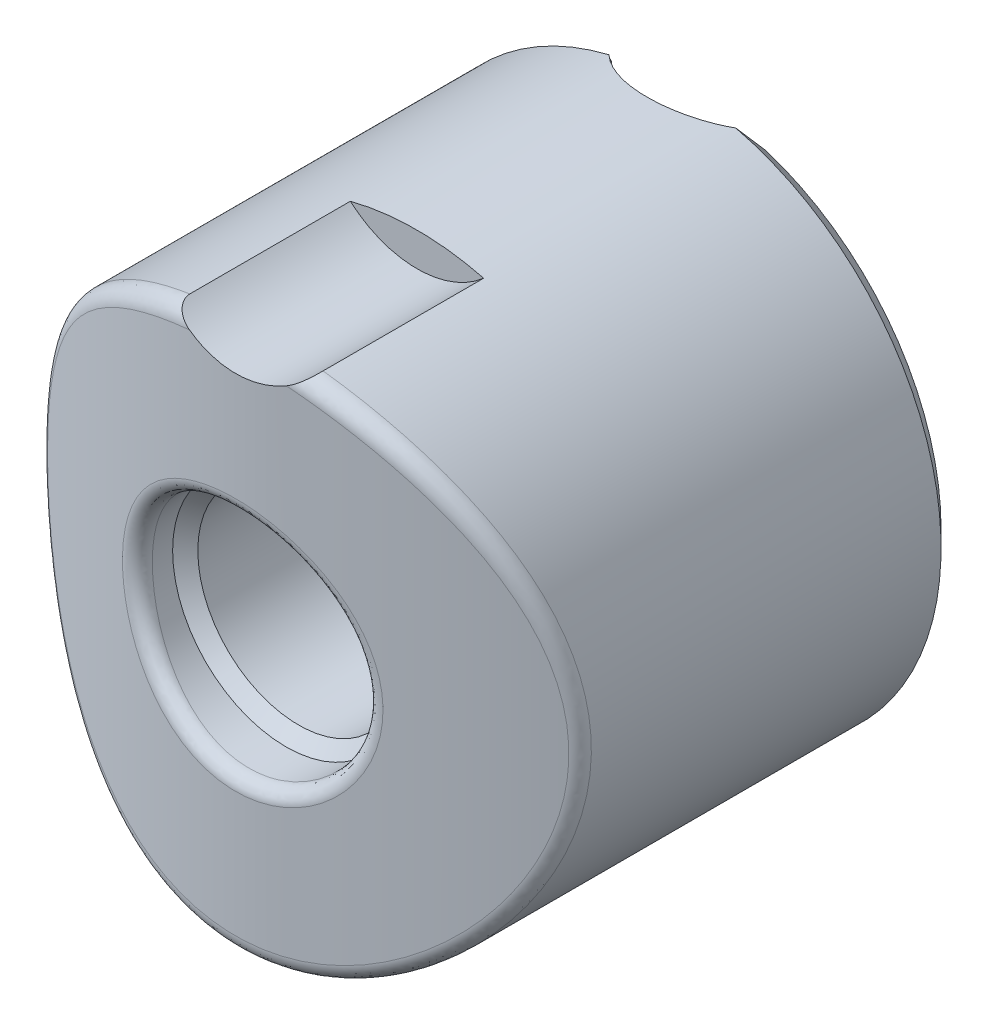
ISO-10303-21;
HEADER;
FILE_DESCRIPTION(('STEP AP214'),'2;1');
FILE_NAME('part.step','',(''),(''),'','','');
FILE_SCHEMA(('AUTOMOTIVE_DESIGN { 1 0 10303 214 1 1 1 1 }'));
ENDSEC;
DATA;
#1=APPLICATION_CONTEXT('core data for automotive mechanical design processes');
#2=APPLICATION_PROTOCOL_DEFINITION('international standard','automotive_design',2000,#1);
#3=PRODUCT_CONTEXT('',#1,'mechanical');
#4=PRODUCT('Part','Part','',(#3));
#5=PRODUCT_RELATED_PRODUCT_CATEGORY('part','',(#4));
#6=PRODUCT_DEFINITION_FORMATION('','',#4);
#7=PRODUCT_DEFINITION_CONTEXT('part definition',#1,'design');
#8=PRODUCT_DEFINITION('design','',#6,#7);
#9=PRODUCT_DEFINITION_SHAPE('','',#8);
#10=(LENGTH_UNIT() NAMED_UNIT(*) SI_UNIT(.MILLI.,.METRE.));
#11=(NAMED_UNIT(*) PLANE_ANGLE_UNIT() SI_UNIT($,.RADIAN.));
#12=(NAMED_UNIT(*) SI_UNIT($,.STERADIAN.) SOLID_ANGLE_UNIT());
#13=UNCERTAINTY_MEASURE_WITH_UNIT(LENGTH_MEASURE(1.E-05),#10,'distance_accuracy_value','');
#14=(GEOMETRIC_REPRESENTATION_CONTEXT(3) GLOBAL_UNCERTAINTY_ASSIGNED_CONTEXT((#13)) GLOBAL_UNIT_ASSIGNED_CONTEXT((#10,
#11,#12)) REPRESENTATION_CONTEXT('',''));
#15=CARTESIAN_POINT('',(0.,0.,0.));
#16=DIRECTION('',(0.,0.,1.));
#17=DIRECTION('',(1.,0.,0.));
#18=AXIS2_PLACEMENT_3D('',#15,#16,#17);
#19=CARTESIAN_POINT('',(0.,8.75758622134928,0.));
#20=DIRECTION('',(0.,-1.,0.));
#21=DIRECTION('',(1.,0.,0.));
#22=AXIS2_PLACEMENT_3D('',#19,#20,#21);
#23=TOROIDAL_SURFACE('',#22,8.5,0.5);
#24=CARTESIAN_POINT('',(0.,9.19059892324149,0.));
#25=DIRECTION('',(0.,-1.,0.));
#26=DIRECTION('',(1.,0.,0.));
#27=AXIS2_PLACEMENT_3D('',#24,#25,#26);
#28=CIRCLE('',#27,8.75);
#29=CARTESIAN_POINT('',(8.2196411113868,9.19059892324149,3.));
#30=VERTEX_POINT('',#29);
#31=CARTESIAN_POINT('',(-8.2196411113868,9.19059892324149,3.));
#32=VERTEX_POINT('',#31);
#33=EDGE_CURVE('E318',#30,#32,#28,.T.);
#34=ORIENTED_EDGE('',*,*,#33,.F.);
#35=CARTESIAN_POINT('',(8.48528137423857,8.75758622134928,3.));
#36=CARTESIAN_POINT('',(8.48531137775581,8.78453260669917,3.));
#37=CARTESIAN_POINT('',(8.48297296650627,8.81146301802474,3.));
#38=CARTESIAN_POINT('',(8.47378969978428,8.86449274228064,3.));
#39=CARTESIAN_POINT('',(8.4669536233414,8.89059357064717,3.));
#40=CARTESIAN_POINT('',(8.44900443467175,8.94127384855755,3.));
#41=CARTESIAN_POINT('',(8.43789162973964,8.96585340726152,3.));
#42=CARTESIAN_POINT('',(8.41179244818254,9.01285160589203,3.));
#43=CARTESIAN_POINT('',(8.39680634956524,9.03527040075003,3.));
#44=CARTESIAN_POINT('',(8.36306443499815,9.07790214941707,3.));
#45=CARTESIAN_POINT('',(8.34423032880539,9.09805301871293,3.));
#46=CARTESIAN_POINT('',(8.30358746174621,9.13512228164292,3.));
#47=CARTESIAN_POINT('',(8.28177575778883,9.15203743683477,3.));
#48=CARTESIAN_POINT('',(8.23454099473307,9.18312113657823,3.));
#49=CARTESIAN_POINT('',(8.2089853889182,9.19708781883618,3.));
#50=CARTESIAN_POINT('',(8.15602674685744,9.2207942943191,3.));
#51=CARTESIAN_POINT('',(8.1286265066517,9.23054032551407,3.));
#52=CARTESIAN_POINT('',(8.10064774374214,9.23807434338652,3.));
#53=B_SPLINE_CURVE_WITH_KNOTS('',3,(#35,#36,#37,#38,#39,#40,#41,#42,#43,#44,#45,#46,#47,#48,#49,
#50,#51,#52),.UNSPECIFIED.,.F.,.F.,(4,2,2,2,2,2,2,2,4),(0.,0.08071334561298,0.161269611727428,
0.241820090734,0.322364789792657,0.404749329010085,0.487215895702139,0.574211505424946,
0.66107809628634),.UNSPECIFIED.);
#54=CARTESIAN_POINT('',(8.48528137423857,8.75758622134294,3.));
#55=VERTEX_POINT('',#54);
#56=EDGE_CURVE('E23',#30,#55,#53,.F.);
#57=ORIENTED_EDGE('',*,*,#56,.T.);
#58=CARTESIAN_POINT('',(0.,8.75758622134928,0.));
#59=DIRECTION('',(0.,-1.,0.));
#60=DIRECTION('',(1.,0.,0.));
#61=AXIS2_PLACEMENT_3D('',#58,#59,#60);
#62=CIRCLE('',#61,9.);
#63=CARTESIAN_POINT('',(-8.48528137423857,8.75758622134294,3.));
#64=VERTEX_POINT('',#63);
#65=EDGE_CURVE('E319',#64,#55,#62,.F.);
#66=ORIENTED_EDGE('',*,*,#65,.F.);
#67=CARTESIAN_POINT('',(-8.2196411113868,9.19059892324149,3.));
#68=CARTESIAN_POINT('',(-8.24514660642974,9.17679271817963,3.));
#69=CARTESIAN_POINT('',(-8.26953422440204,9.16088291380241,3.));
#70=CARTESIAN_POINT('',(-8.31541022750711,9.12523264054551,3.));
#71=CARTESIAN_POINT('',(-8.33689208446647,9.10548378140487,3.));
#72=CARTESIAN_POINT('',(-8.3762108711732,9.06255636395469,3.));
#73=CARTESIAN_POINT('',(-8.39404087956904,9.03937143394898,3.));
#74=CARTESIAN_POINT('',(-8.42532313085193,8.99025233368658,3.));
#75=CARTESIAN_POINT('',(-8.43878155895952,8.96432211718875,3.));
#76=CARTESIAN_POINT('',(-8.46033645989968,8.91161659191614,3.));
#77=CARTESIAN_POINT('',(-8.46863813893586,8.88492522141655,3.));
#78=CARTESIAN_POINT('',(-8.48044238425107,8.83048275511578,3.));
#79=CARTESIAN_POINT('',(-8.48394287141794,8.80273120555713,3.));
#80=CARTESIAN_POINT('',(-8.48594331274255,8.74817259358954,3.));
#81=CARTESIAN_POINT('',(-8.48463880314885,8.72137245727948,3.));
#82=CARTESIAN_POINT('',(-8.4775453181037,8.66835649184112,3.));
#83=CARTESIAN_POINT('',(-8.47175366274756,8.64214102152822,3.));
#84=CARTESIAN_POINT('',(-8.4637612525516,8.6166076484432,3.));
#85=B_SPLINE_CURVE_WITH_KNOTS('',3,(#67,#68,#69,#70,#71,#72,#73,#74,#75,#76,#77,#78,#79,#80,#81,
#82,#83,#84),.UNSPECIFIED.,.F.,.F.,(4,2,2,2,2,2,2,2,4),(0.,0.0869423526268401,0.174076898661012,
0.261375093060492,0.34854922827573,0.431984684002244,0.51545625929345,0.595569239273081,
0.675730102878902),.UNSPECIFIED.);
#86=EDGE_CURVE('E9',#64,#32,#85,.F.);
#87=ORIENTED_EDGE('',*,*,#86,.T.);
#88=EDGE_LOOP('',(#34,#57,#66,#87));
#89=FACE_BOUND('',#88,.T.);
#90=ADVANCED_FACE('F14',(#89),#23,.F.);
#91=CARTESIAN_POINT('',(0.,0.,3.));
#92=DIRECTION('',(0.,0.,1.));
#93=DIRECTION('',(1.,0.,0.));
#94=AXIS2_PLACEMENT_3D('',#91,#92,#93);
#95=PLANE('',#94);
#96=ORIENTED_EDGE('',*,*,#56,.F.);
#97=CARTESIAN_POINT('',(44.1951860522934,-11.332407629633,3.));
#98=CARTESIAN_POINT('',(42.6414188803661,-10.4374168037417,3.));
#99=CARTESIAN_POINT('',(41.0875722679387,-9.54256378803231,3.));
#100=CARTESIAN_POINT('',(37.97958889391,-7.75330318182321,3.));
#101=CARTESIAN_POINT('',(36.4254521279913,-6.85889559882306,3.));
#102=CARTESIAN_POINT('',(33.3161033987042,-5.07031964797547,3.));
#103=CARTESIAN_POINT('',(31.7608912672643,-4.17615157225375,3.));
#104=CARTESIAN_POINT('',(28.6499201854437,-2.3888242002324,3.));
#105=CARTESIAN_POINT('',(27.0941612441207,-1.49566488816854,3.));
#106=CARTESIAN_POINT('',(24.0229779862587,0.265390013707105,3.));
#107=CARTESIAN_POINT('',(22.5075777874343,1.13332763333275,3.));
#108=CARTESIAN_POINT('',(20.2332585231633,2.4331867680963,3.));
#109=CARTESIAN_POINT('',(19.4749305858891,2.86614237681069,3.));
#110=CARTESIAN_POINT('',(17.9577178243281,3.73106945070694,3.));
#111=CARTESIAN_POINT('',(17.1988330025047,4.16304092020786,3.));
#112=CARTESIAN_POINT('',(15.6804754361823,5.02542321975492,3.));
#113=CARTESIAN_POINT('',(14.9210029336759,5.45583447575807,3.));
#114=CARTESIAN_POINT('',(13.4008082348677,6.31447855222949,3.));
#115=CARTESIAN_POINT('',(12.6400860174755,6.74271133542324,3.));
#116=CARTESIAN_POINT('',(11.4974936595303,7.38229150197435,3.));
#117=CARTESIAN_POINT('',(11.1163938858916,7.59501461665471,3.));
#118=CARTESIAN_POINT('',(10.3535043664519,8.0192194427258,3.));
#119=CARTESIAN_POINT('',(9.97171462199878,8.23070115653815,3.));
#120=CARTESIAN_POINT('',(9.20720721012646,8.65195645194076,3.));
#121=CARTESIAN_POINT('',(8.82448956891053,8.86173008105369,3.));
#122=CARTESIAN_POINT('',(8.05774072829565,9.2788607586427,3.));
#123=CARTESIAN_POINT('',(7.67370954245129,9.4862178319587,3.));
#124=CARTESIAN_POINT('',(7.12055596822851,9.78153641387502,3.));
#125=CARTESIAN_POINT('',(6.95221697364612,9.87096507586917,3.));
#126=CARTESIAN_POINT('',(6.61509058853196,10.0489761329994,3.));
#127=CARTESIAN_POINT('',(6.44630319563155,10.1375585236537,3.));
#128=CARTESIAN_POINT('',(6.10816187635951,10.3137020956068,3.));
#129=CARTESIAN_POINT('',(5.93880786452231,10.4012631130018,3.));
#130=CARTESIAN_POINT('',(5.59944082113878,10.5750984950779,3.));
#131=CARTESIAN_POINT('',(5.42942779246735,10.6613728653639,3.));
#132=CARTESIAN_POINT('',(5.08719754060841,10.8329991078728,3.));
#133=CARTESIAN_POINT('',(4.91497365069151,10.9183377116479,3.));
#134=CARTESIAN_POINT('',(4.56949584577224,11.0869023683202,3.));
#135=CARTESIAN_POINT('',(4.39624194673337,11.1701284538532,3.));
#136=CARTESIAN_POINT('',(4.04846684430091,11.333809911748,3.));
#137=CARTESIAN_POINT('',(3.87394589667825,11.414265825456,3.));
#138=CARTESIAN_POINT('',(3.5232649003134,11.5715094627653,3.));
#139=CARTESIAN_POINT('',(3.34710495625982,11.6482974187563,3.));
#140=CARTESIAN_POINT('',(2.9765711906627,11.8036797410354,3.));
#141=CARTESIAN_POINT('',(2.78199801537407,11.8818031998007,3.));
#142=CARTESIAN_POINT('',(2.38960852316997,12.0297135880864,3.));
#143=CARTESIAN_POINT('',(2.1917914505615,12.0994985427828,3.));
#144=CARTESIAN_POINT('',(1.79460127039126,12.2263498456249,3.));
#145=CARTESIAN_POINT('',(1.59527375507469,12.2835559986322,3.));
#146=CARTESIAN_POINT('',(1.19257396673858,12.3814943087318,3.));
#147=CARTESIAN_POINT('',(0.989204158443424,12.4222361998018,3.));
#148=CARTESIAN_POINT('',(0.618029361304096,12.4764248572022,3.));
#149=CARTESIAN_POINT('',(0.450778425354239,12.4935782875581,3.));
#150=CARTESIAN_POINT('',(0.115428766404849,12.5117574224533,3.));
#151=CARTESIAN_POINT('',(-0.0526696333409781,12.5127888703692,3.));
#152=CARTESIAN_POINT('',(-0.389349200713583,12.4985496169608,3.));
#153=CARTESIAN_POINT('',(-0.557925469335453,12.483164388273,3.));
#154=CARTESIAN_POINT('',(-0.809230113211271,12.4490773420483,3.));
#155=CARTESIAN_POINT('',(-0.892757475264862,12.4358758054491,3.));
#156=CARTESIAN_POINT('',(-1.05921417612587,12.4061417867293,3.));
#157=CARTESIAN_POINT('',(-1.1421435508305,12.3896095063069,3.));
#158=CARTESIAN_POINT('',(-1.35954809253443,12.3421696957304,3.));
#159=CARTESIAN_POINT('',(-1.49348178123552,12.3087797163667,3.));
#160=CARTESIAN_POINT('',(-1.75958158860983,12.235556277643,3.));
#161=CARTESIAN_POINT('',(-1.89174723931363,12.1957211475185,3.));
#162=CARTESIAN_POINT('',(-2.15459365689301,12.1108741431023,3.));
#163=CARTESIAN_POINT('',(-2.28527212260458,12.0658551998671,3.));
#164=CARTESIAN_POINT('',(-2.54513698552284,11.9717690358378,3.));
#165=CARTESIAN_POINT('',(-2.67432353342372,11.9227022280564,3.));
#166=CARTESIAN_POINT('',(-2.93204179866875,11.8211222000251,3.));
#167=CARTESIAN_POINT('',(-3.06056743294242,11.7685936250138,3.));
#168=CARTESIAN_POINT('',(-3.31653512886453,11.6609582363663,3.));
#169=CARTESIAN_POINT('',(-3.44397715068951,11.6058513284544,3.));
#170=CARTESIAN_POINT('',(-3.82475613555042,11.4375404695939,3.));
#171=CARTESIAN_POINT('',(-4.07673558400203,11.3212697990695,3.));
#172=CARTESIAN_POINT('',(-4.58456265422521,11.0802998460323,3.));
#173=CARTESIAN_POINT('',(-4.84034319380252,10.955460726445,3.));
#174=CARTESIAN_POINT('',(-5.35000844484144,10.7018912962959,3.));
#175=CARTESIAN_POINT('',(-5.60389287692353,10.5731604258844,3.));
#176=CARTESIAN_POINT('',(-6.10944151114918,10.313373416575,3.));
#177=CARTESIAN_POINT('',(-6.36111021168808,10.1823260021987,3.));
#178=CARTESIAN_POINT('',(-6.86338474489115,9.9182451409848,3.));
#179=CARTESIAN_POINT('',(-7.11399063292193,9.78521179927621,3.));
#180=CARTESIAN_POINT('',(-7.62008731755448,9.51460897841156,3.));
#181=CARTESIAN_POINT('',(-7.87555970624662,9.37700511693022,3.));
#182=CARTESIAN_POINT('',(-8.38585527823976,9.10059809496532,3.));
#183=CARTESIAN_POINT('',(-8.64067845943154,8.96179493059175,3.));
#184=CARTESIAN_POINT('',(-9.40439497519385,8.54399430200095,3.));
#185=CARTESIAN_POINT('',(-9.91252884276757,8.26360916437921,3.));
#186=CARTESIAN_POINT('',(-10.9275196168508,7.70046735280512,3.));
#187=CARTESIAN_POINT('',(-11.4343764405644,7.41771052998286,3.));
#188=CARTESIAN_POINT('',(-12.447184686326,6.85058953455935,3.));
#189=CARTESIAN_POINT('',(-12.9531361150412,6.56622537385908,3.));
#190=CARTESIAN_POINT('',(-13.9651556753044,5.99593037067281,3.));
#191=CARTESIAN_POINT('',(-14.4712228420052,5.70999781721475,3.));
#192=CARTESIAN_POINT('',(-15.4828814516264,5.13729056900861,3.));
#193=CARTESIAN_POINT('',(-15.9884728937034,4.85051587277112,3.));
#194=CARTESIAN_POINT('',(-17.5046815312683,3.98927080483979,3.));
#195=CARTESIAN_POINT('',(-18.5147651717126,3.4138613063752,3.));
#196=CARTESIAN_POINT('',(-20.4212642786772,2.32590078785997,3.));
#197=CARTESIAN_POINT('',(-21.3177709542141,1.81350945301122,3.));
#198=CARTESIAN_POINT('',(-23.1103186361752,0.78789261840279,3.));
#199=CARTESIAN_POINT('',(-24.0063596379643,0.274667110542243,3.));
#200=CARTESIAN_POINT('',(-25.7967451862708,-0.751591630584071,3.));
#201=CARTESIAN_POINT('',(-26.6910902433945,-1.264623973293,3.));
#202=CARTESIAN_POINT('',(-28.4795169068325,-2.29112635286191,3.));
#203=CARTESIAN_POINT('',(-29.3735985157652,-2.80459638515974,3.));
#204=CARTESIAN_POINT('',(-30.2675937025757,-3.31821670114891,3.));
#205=B_SPLINE_CURVE_WITH_KNOTS('',3,(#97,#98,#99,#100,#101,#102,#103,#104,#105,#106,#107,#108,
#109,#110,#111,#112,#113,#114,#115,#116,#117,#118,#119,#120,#121,#122,#123,#124,#125,#126,#127,
#128,#129,#130,#131,#132,#133,#134,#135,#136,#137,#138,#139,#140,#141,#142,#143,#144,#145,#146,
#147,#148,#149,#150,#151,#152,#153,#154,#155,#156,#157,#158,#159,#160,#161,#162,#163,#164,#165,
#166,#167,#168,#169,#170,#171,#172,#173,#174,#175,#176,#177,#178,#179,#180,#181,#182,#183,#184,
#185,#186,#187,#188,#189,#190,#191,#192,#193,#194,#195,#196,#197,#198,#199,#200,#201,#202,#203,
#204),.UNSPECIFIED.,.F.,.F.,(4,2,2,2,2,2,2,2,2,2,2,2,2,2,2,2,2,2,2,2,2,2,2,2,2,2,2,2,2,2,2,2,2,
2,2,2,2,2,2,2,2,2,2,2,2,2,2,2,2,2,2,2,2,4),(0.,5.37929454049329,10.758676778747,16.14049700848,
21.5222319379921,26.7612929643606,29.3809501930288,32.0005959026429,34.6194624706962,
37.2383736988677,38.5477206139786,39.8570649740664,41.1663727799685,42.4756671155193,
43.0475214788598,43.6193788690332,44.1913267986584,44.763272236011,45.3398838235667,
45.9164864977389,46.4929758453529,47.0694286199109,47.6983106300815,48.3273412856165,
48.9489810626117,49.570252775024,50.0739354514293,50.5774386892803,51.0844776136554,
51.3381142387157,51.5917355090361,52.0056189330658,52.419609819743,52.8341720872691,
53.2486921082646,53.6651938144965,54.0817107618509,54.9141316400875,55.7679516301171,
56.6218950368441,57.4731151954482,58.3242904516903,59.1948084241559,60.0653292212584,
61.8063927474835,63.5475663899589,65.2887271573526,67.0325015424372,68.7762790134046,
72.26372324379,75.3615320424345,78.459371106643,81.5525081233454,84.6456132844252),.UNSPECIFIED.);
#206=CARTESIAN_POINT('',(4.60977222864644,11.0669872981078,3.));
#207=VERTEX_POINT('',#206);
#208=EDGE_CURVE('E307',#30,#207,#205,.T.);
#209=ORIENTED_EDGE('',*,*,#208,.T.);
#210=DIRECTION('',(0.,-1.,0.));
#211=VECTOR('',#210,1.);
#212=CARTESIAN_POINT('',(4.60977222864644,30.,3.));
#213=LINE('',#212,#211);
#214=CARTESIAN_POINT('',(4.60977222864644,14.2741024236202,3.));
#215=VERTEX_POINT('',#214);
#216=EDGE_CURVE('E297',#215,#207,#213,.T.);
#217=ORIENTED_EDGE('',*,*,#216,.F.);
#218=CARTESIAN_POINT('',(0.,0.,3.));
#219=DIRECTION('',(0.,0.,1.));
#220=DIRECTION('',(1.,0.,0.));
#221=AXIS2_PLACEMENT_3D('',#218,#219,#220);
#222=CIRCLE('',#221,15.);
#223=CARTESIAN_POINT('',(8.48528137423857,-12.369316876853,3.));
#224=VERTEX_POINT('',#223);
#225=EDGE_CURVE('E113',#215,#224,#222,.F.);
#226=ORIENTED_EDGE('',*,*,#225,.T.);
#227=DIRECTION('',(0.,-1.,0.));
#228=VECTOR('',#227,1.);
#229=CARTESIAN_POINT('',(8.48528137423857,0.,3.));
#230=LINE('',#229,#228);
#231=EDGE_CURVE('E96',#224,#55,#230,.F.);
#232=ORIENTED_EDGE('',*,*,#231,.T.);
#233=EDGE_LOOP('',(#96,#209,#217,#226,#232));
#234=FACE_BOUND('',#233,.T.);
#235=ADVANCED_FACE('F362',(#234),#95,.F.);
#236=CARTESIAN_POINT('',(0.,0.,3.));
#237=DIRECTION('',(0.,0.,1.));
#238=DIRECTION('',(1.,0.,0.));
#239=AXIS2_PLACEMENT_3D('',#236,#237,#238);
#240=CONICAL_SURFACE('',#239,15.,0.785398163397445);
#241=CARTESIAN_POINT('',(-8.01176384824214,-13.9652454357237,4.1002));
#242=CARTESIAN_POINT('',(-8.06245517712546,-13.8219636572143,4.00114456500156));
#243=CARTESIAN_POINT('',(-8.11099173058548,-13.6781380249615,3.90177981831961));
#244=CARTESIAN_POINT('',(-8.20384241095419,-13.3895793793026,3.70257333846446));
#245=CARTESIAN_POINT('',(-8.24815879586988,-13.2448468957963,3.60273189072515));
#246=CARTESIAN_POINT('',(-8.33271048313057,-12.9545007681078,3.40260706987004));
#247=CARTESIAN_POINT('',(-8.37294579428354,-12.808887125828,3.3023236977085));
#248=CARTESIAN_POINT('',(-8.44945242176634,-12.5167862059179,3.10134074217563));
#249=CARTESIAN_POINT('',(-8.48572159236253,-12.3702985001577,3.00064096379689));
#250=CARTESIAN_POINT('',(-8.52004459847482,-12.2234561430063,2.8998));
#251=B_SPLINE_CURVE_WITH_KNOTS('',3,(#241,#242,#243,#244,#245,#246,#247,#248,#249,#250),
.UNSPECIFIED.,.F.,.F.,(4,2,2,2,4),(0.,0.544224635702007,1.08815642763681,1.63208704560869,
2.17631049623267),.UNSPECIFIED.);
#252=CARTESIAN_POINT('',(-8.06225774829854,-13.8202749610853,4.));
#253=VERTEX_POINT('',#252);
#254=CARTESIAN_POINT('',(-8.48528137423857,-12.369316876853,3.));
#255=VERTEX_POINT('',#254);
#256=EDGE_CURVE('E99',#253,#255,#251,.T.);
#257=ORIENTED_EDGE('',*,*,#256,.F.);
#258=CARTESIAN_POINT('',(0.,0.,4.));
#259=DIRECTION('',(0.,0.,1.));
#260=DIRECTION('',(1.,0.,0.));
#261=AXIS2_PLACEMENT_3D('',#258,#259,#260);
#262=CIRCLE('',#261,16.);
#263=CARTESIAN_POINT('',(-3.77491721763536,15.5483118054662,4.));
#264=VERTEX_POINT('',#263);
#265=EDGE_CURVE('E165',#264,#253,#262,.T.);
#266=ORIENTED_EDGE('',*,*,#265,.F.);
#267=CARTESIAN_POINT('',(-4.60977222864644,14.2741024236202,3.));
#268=CARTESIAN_POINT('',(-4.55268927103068,14.3846890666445,3.08769539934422));
#269=CARTESIAN_POINT('',(-4.49264670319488,14.4944812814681,3.17449902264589));
#270=CARTESIAN_POINT('',(-4.36651549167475,14.711824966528,3.34587252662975));
#271=CARTESIAN_POINT('',(-4.30044102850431,14.8193809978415,3.43044707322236));
#272=CARTESIAN_POINT('',(-4.16185509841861,15.0321185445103,3.59732243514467));
#273=CARTESIAN_POINT('',(-4.08934319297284,15.137299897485,3.67962309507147));
#274=CARTESIAN_POINT('',(-3.93738897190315,15.3450015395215,3.84178439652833));
#275=CARTESIAN_POINT('',(-3.85793110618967,15.447515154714,3.92163899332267));
#276=CARTESIAN_POINT('',(-3.77491721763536,15.5483118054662,4.));
#277=B_SPLINE_CURVE_WITH_KNOTS('',3,(#267,#268,#269,#270,#271,#272,#273,#274,#275,#276),
.UNSPECIFIED.,.F.,.F.,(4,2,2,2,4),(0.,0.456726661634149,0.91240596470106,1.36811633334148,
1.82487440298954),.UNSPECIFIED.);
#278=CARTESIAN_POINT('',(-4.60977222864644,14.2741024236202,3.));
#279=VERTEX_POINT('',#278);
#280=EDGE_CURVE('E111',#279,#264,#277,.T.);
#281=ORIENTED_EDGE('',*,*,#280,.F.);
#282=EDGE_CURVE('E92',#255,#279,#222,.F.);
#283=ORIENTED_EDGE('',*,*,#282,.F.);
#284=EDGE_LOOP('',(#257,#266,#281,#283));
#285=FACE_BOUND('',#284,.T.);
#286=ADVANCED_FACE('F110',(#285),#240,.T.);
#287=CARTESIAN_POINT('',(0.,0.,0.));
#288=DIRECTION('',(0.,-1.,0.));
#289=DIRECTION('',(1.,0.,0.));
#290=AXIS2_PLACEMENT_3D('',#287,#288,#289);
#291=CYLINDRICAL_SURFACE('',#290,9.);
#292=DIRECTION('',(0.,-1.,0.));
#293=VECTOR('',#292,1.);
#294=CARTESIAN_POINT('',(-8.48528137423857,0.,3.));
#295=LINE('',#294,#293);
#296=EDGE_CURVE('E87',#64,#255,#295,.T.);
#297=ORIENTED_EDGE('',*,*,#296,.F.);
#298=ORIENTED_EDGE('',*,*,#65,.T.);
#299=ORIENTED_EDGE('',*,*,#231,.F.);
#300=CARTESIAN_POINT('',(8.52004459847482,-12.2234561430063,2.8998));
#301=CARTESIAN_POINT('',(8.48572159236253,-12.3702985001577,3.00064096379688));
#302=CARTESIAN_POINT('',(8.44945242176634,-12.5167862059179,3.10134074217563));
#303=CARTESIAN_POINT('',(8.37294579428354,-12.808887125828,3.3023236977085));
#304=CARTESIAN_POINT('',(8.33271048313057,-12.9545007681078,3.40260706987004));
#305=CARTESIAN_POINT('',(8.24815879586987,-13.2448468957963,3.60273189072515));
#306=CARTESIAN_POINT('',(8.20384241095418,-13.3895793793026,3.70257333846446));
#307=CARTESIAN_POINT('',(8.11099173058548,-13.6781380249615,3.90177981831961));
#308=CARTESIAN_POINT('',(8.06245517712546,-13.8219636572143,4.00114456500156));
#309=CARTESIAN_POINT('',(8.01176384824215,-13.9652454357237,4.1002));
#310=B_SPLINE_CURVE_WITH_KNOTS('',3,(#300,#301,#302,#303,#304,#305,#306,#307,#308,#309),
.UNSPECIFIED.,.F.,.F.,(4,2,2,2,4),(0.,0.544223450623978,1.08815406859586,1.63208586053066,
2.17631049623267),.UNSPECIFIED.);
#311=CARTESIAN_POINT('',(8.06225774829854,-13.8202749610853,4.));
#312=VERTEX_POINT('',#311);
#313=EDGE_CURVE('E108',#224,#312,#310,.T.);
#314=ORIENTED_EDGE('',*,*,#313,.T.);
#315=CARTESIAN_POINT('',(-8.06225774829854,-13.8202749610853,4.));
#316=CARTESIAN_POINT('',(-7.94511822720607,-13.8886155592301,4.2360820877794));
#317=CARTESIAN_POINT('',(-7.81809633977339,-13.9607164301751,4.46607841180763));
#318=CARTESIAN_POINT('',(-7.54534980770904,-14.1099893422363,4.91286195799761));
#319=CARTESIAN_POINT('',(-7.39963145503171,-14.1871596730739,5.12965358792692));
#320=CARTESIAN_POINT('',(-7.09009111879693,-14.3443656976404,5.54966943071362));
#321=CARTESIAN_POINT('',(-6.92622519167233,-14.4244080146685,5.75285871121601));
#322=CARTESIAN_POINT('',(-6.58155674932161,-14.5848978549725,6.14419247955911));
#323=CARTESIAN_POINT('',(-6.4007525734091,-14.665345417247,6.33233548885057));
#324=CARTESIAN_POINT('',(-6.02313689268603,-14.8244319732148,6.69252422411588));
#325=CARTESIAN_POINT('',(-5.82633023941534,-14.90307150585,6.86457479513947));
#326=CARTESIAN_POINT('',(-5.41757100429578,-15.0564793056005,7.19155144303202));
#327=CARTESIAN_POINT('',(-5.20561955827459,-15.131247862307,7.34647880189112));
#328=CARTESIAN_POINT('',(-4.76776000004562,-15.2748650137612,7.63790307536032));
#329=CARTESIAN_POINT('',(-4.54186348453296,-15.3437184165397,7.77441501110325));
#330=CARTESIAN_POINT('',(-4.07720010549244,-15.4736750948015,8.0278551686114));
#331=CARTESIAN_POINT('',(-3.83843385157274,-15.5347787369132,8.14478431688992));
#332=CARTESIAN_POINT('',(-3.35747425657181,-15.645647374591,8.35427568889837));
#333=CARTESIAN_POINT('',(-3.11564117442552,-15.6957150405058,8.44750338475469));
#334=CARTESIAN_POINT('',(-2.62307426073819,-15.785503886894,8.61318667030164));
#335=CARTESIAN_POINT('',(-2.3723405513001,-15.8252252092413,8.68564254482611));
#336=CARTESIAN_POINT('',(-1.86422013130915,-15.8930905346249,8.80868663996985));
#337=CARTESIAN_POINT('',(-1.60683861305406,-15.9212432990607,8.85929141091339));
#338=CARTESIAN_POINT('',(-1.08761000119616,-15.9651165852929,8.93789788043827));
#339=CARTESIAN_POINT('',(-0.82576351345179,-15.9808387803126,8.96590262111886));
#340=CARTESIAN_POINT('',(-0.332751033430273,-15.9981995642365,8.99680597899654));
#341=CARTESIAN_POINT('',(-0.101801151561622,-16.0013410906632,9.00238414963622));
#342=CARTESIAN_POINT('',(0.359749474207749,-15.9976192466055,8.99576749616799));
#343=CARTESIAN_POINT('',(0.590350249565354,-15.9907568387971,8.98357438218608));
#344=CARTESIAN_POINT('',(1.04939133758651,-15.9672037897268,8.94158245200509));
#345=CARTESIAN_POINT('',(1.27783198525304,-15.9505146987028,8.91178641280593));
#346=CARTESIAN_POINT('',(1.73090031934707,-15.9077264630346,8.83497469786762));
#347=CARTESIAN_POINT('',(1.95552796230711,-15.8816272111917,8.78795882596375));
#348=CARTESIAN_POINT('',(2.39130356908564,-15.8217656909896,8.67929982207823));
#349=CARTESIAN_POINT('',(2.60264428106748,-15.7883178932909,8.61825322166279));
#350=CARTESIAN_POINT('',(3.01918597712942,-15.7139839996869,8.48130889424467));
#351=CARTESIAN_POINT('',(3.22438481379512,-15.6730953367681,8.40540604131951));
#352=CARTESIAN_POINT('',(3.62749025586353,-15.5847326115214,8.23946728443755));
#353=CARTESIAN_POINT('',(3.82539737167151,-15.5372590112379,8.14943237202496));
#354=CARTESIAN_POINT('',(4.21310603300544,-15.4366406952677,7.9559227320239));
#355=CARTESIAN_POINT('',(4.4029044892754,-15.3834938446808,7.85244294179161));
#356=CARTESIAN_POINT('',(4.78959367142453,-15.2677419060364,7.62329036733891));
#357=CARTESIAN_POINT('',(4.9856816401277,-15.2047163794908,7.49647280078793));
#358=CARTESIAN_POINT('',(5.36654620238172,-15.0745071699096,7.22872257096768));
#359=CARTESIAN_POINT('',(5.55131834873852,-15.0073218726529,7.08778441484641));
#360=CARTESIAN_POINT('',(6.08750923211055,-14.8016354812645,6.64506716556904));
#361=CARTESIAN_POINT('',(6.4210970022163,-14.658912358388,6.32320962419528));
#362=CARTESIAN_POINT('',(6.99198592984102,-14.3943384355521,5.68068022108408));
#363=CARTESIAN_POINT('',(7.23622958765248,-14.272367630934,5.36617286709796));
#364=CARTESIAN_POINT('',(7.57059953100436,-14.0961658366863,4.87089740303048));
#365=CARTESIAN_POINT('',(7.67668678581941,-14.0385797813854,4.70196029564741));
#366=CARTESIAN_POINT('',(7.87785001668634,-13.9266912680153,4.35653764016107));
#367=CARTESIAN_POINT('',(7.97292256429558,-13.872389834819,4.18004976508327));
#368=CARTESIAN_POINT('',(8.06225774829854,-13.8202749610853,4.));
#369=B_SPLINE_CURVE_WITH_KNOTS('',3,(#315,#316,#317,#318,#319,#320,#321,#322,#323,#324,#325,
#326,#327,#328,#329,#330,#331,#332,#333,#334,#335,#336,#337,#338,#339,#340,#341,#342,#343,#344,
#345,#346,#347,#348,#349,#350,#351,#352,#353,#354,#355,#356,#357,#358,#359,#360,#361,#362,#363,
#364,#365,#366,#367,#368),.UNSPECIFIED.,.F.,.F.,(4,2,2,2,2,2,2,2,2,2,2,2,2,2,2,2,2,2,2,2,2,2,2,
2,2,2,4),(0.,0.816399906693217,1.63252578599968,2.4506729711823,3.26890045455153,
4.08688079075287,4.90479984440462,5.7220476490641,6.5392567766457,7.33005004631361,
8.12083247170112,8.91101489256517,9.7010909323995,10.3933282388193,11.085498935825,
11.7775604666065,12.4696298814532,13.136438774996,13.8034781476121,14.4704707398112,
15.1377152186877,15.8625756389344,16.5877191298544,18.036951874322,19.2829323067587,
19.9054142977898,20.5280895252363),.UNSPECIFIED.);
#370=EDGE_CURVE('E103',#253,#312,#369,.T.);
#371=ORIENTED_EDGE('',*,*,#370,.F.);
#372=ORIENTED_EDGE('',*,*,#256,.T.);
#373=EDGE_LOOP('',(#297,#298,#299,#314,#371,#372));
#374=FACE_BOUND('',#373,.T.);
#375=CARTESIAN_POINT('',(-8.25,0.,3.59687364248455));
#376=CARTESIAN_POINT('',(-8.2499997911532,0.117031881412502,3.59687424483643));
#377=CARTESIAN_POINT('',(-8.24749965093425,0.234067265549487,3.60262561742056));
#378=CARTESIAN_POINT('',(-8.23760706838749,0.466829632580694,3.62518570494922));
#379=CARTESIAN_POINT('',(-8.2302139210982,0.582556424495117,3.6419960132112));
#380=CARTESIAN_POINT('',(-8.20098143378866,0.927108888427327,3.70759079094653));
#381=CARTESIAN_POINT('',(-8.17209160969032,1.15252193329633,3.77152753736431));
#382=CARTESIAN_POINT('',(-8.10741454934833,1.53643240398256,3.90819662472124));
#383=CARTESIAN_POINT('',(-8.07503577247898,1.6978257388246,3.97496581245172));
#384=CARTESIAN_POINT('',(-8.00211660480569,2.01366605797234,4.11979616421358));
#385=CARTESIAN_POINT('',(-7.96157043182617,2.16810802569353,4.19786531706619));
#386=CARTESIAN_POINT('',(-7.87286128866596,2.47094063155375,4.36196950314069));
#387=CARTESIAN_POINT('',(-7.82467718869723,2.61931300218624,4.44802635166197));
#388=CARTESIAN_POINT('',(-7.72115758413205,2.91033628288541,4.62539754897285));
#389=CARTESIAN_POINT('',(-7.66581969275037,3.05298526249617,4.71671364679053));
#390=CARTESIAN_POINT('',(-7.50044095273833,3.4470068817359,4.97825458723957));
#391=CARTESIAN_POINT('',(-7.38248579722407,3.69254621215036,5.15230951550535));
#392=CARTESIAN_POINT('',(-7.12422569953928,4.16908984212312,5.50392442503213));
#393=CARTESIAN_POINT('',(-6.98390524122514,4.40008389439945,5.68148676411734));
#394=CARTESIAN_POINT('',(-6.68089208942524,4.84779770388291,6.03488272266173));
#395=CARTESIAN_POINT('',(-6.51822522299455,5.06453351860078,6.21071809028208));
#396=CARTESIAN_POINT('',(-6.16997945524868,5.48342657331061,6.55679780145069));
#397=CARTESIAN_POINT('',(-5.98441287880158,5.68559156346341,6.72704509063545));
#398=CARTESIAN_POINT('',(-5.63952297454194,6.02504404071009,7.01661927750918));
#399=CARTESIAN_POINT('',(-5.48535392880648,6.16585152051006,7.13797535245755));
#400=CARTESIAN_POINT('',(-5.16368724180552,6.43763697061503,7.37401700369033));
#401=CARTESIAN_POINT('',(-4.99618733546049,6.5686132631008,7.48870144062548));
#402=CARTESIAN_POINT('',(-4.64813764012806,6.81932891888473,7.7095549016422));
#403=CARTESIAN_POINT('',(-4.46760728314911,6.93908442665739,7.81573612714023));
#404=CARTESIAN_POINT('',(-4.09353094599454,7.16612426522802,8.01799092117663));
#405=CARTESIAN_POINT('',(-3.89998922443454,7.27341264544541,8.11406777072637));
#406=CARTESIAN_POINT('',(-3.54065810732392,7.4537319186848,8.27613378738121));
#407=CARTESIAN_POINT('',(-3.37712036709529,7.52931212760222,8.34428716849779));
#408=CARTESIAN_POINT('',(-3.04264766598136,7.67057531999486,8.47197217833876));
#409=CARTESIAN_POINT('',(-2.8717164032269,7.73626317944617,8.53150805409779));
#410=CARTESIAN_POINT('',(-2.52313587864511,7.85686251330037,8.64101560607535));
#411=CARTESIAN_POINT('',(-2.3454878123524,7.91177589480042,8.69098897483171));
#412=CARTESIAN_POINT('',(-1.98440990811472,8.00996979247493,8.78047306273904));
#413=CARTESIAN_POINT('',(-1.80098000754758,8.05325018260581,8.81998366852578));
#414=CARTESIAN_POINT('',(-1.42833017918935,8.1276508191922,8.88796813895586));
#415=CARTESIAN_POINT('',(-1.23907980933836,8.15868809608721,8.91636668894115));
#416=CARTESIAN_POINT('',(-0.857462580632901,8.20757323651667,8.96111943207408));
#417=CARTESIAN_POINT('',(-0.665095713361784,8.22542106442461,8.97747359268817));
#418=CARTESIAN_POINT('',(-0.278991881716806,8.24754766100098,8.99775098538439));
#419=CARTESIAN_POINT('',(-0.0852553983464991,8.25183097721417,9.00167838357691));
#420=CARTESIAN_POINT('',(0.301877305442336,8.24674699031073,8.99701809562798));
#421=CARTESIAN_POINT('',(0.49527355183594,8.23738077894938,8.98843141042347));
#422=CARTESIAN_POINT('',(0.859552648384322,8.20691494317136,8.96052012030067));
#423=CARTESIAN_POINT('',(1.0306466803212,8.18716595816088,8.94243173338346));
#424=CARTESIAN_POINT('',(1.37007764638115,8.13724896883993,8.89675330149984));
#425=CARTESIAN_POINT('',(1.53841365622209,8.10707754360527,8.86916013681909));
#426=CARTESIAN_POINT('',(1.8711837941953,8.03679575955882,8.80496346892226));
#427=CARTESIAN_POINT('',(2.03561901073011,7.99668820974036,8.76836251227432));
#428=CARTESIAN_POINT('',(2.35982335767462,7.90708764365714,8.68672518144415));
#429=CARTESIAN_POINT('',(2.51959069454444,7.85759107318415,8.64168561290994));
#430=CARTESIAN_POINT('',(2.8407123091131,7.74744676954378,8.54165530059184));
#431=CARTESIAN_POINT('',(3.00181919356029,7.68639995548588,8.48631015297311));
#432=CARTESIAN_POINT('',(3.31753146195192,7.55550961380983,8.36794175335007));
#433=CARTESIAN_POINT('',(3.47213430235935,7.48566268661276,8.30491553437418));
#434=CARTESIAN_POINT('',(3.92547259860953,7.26403444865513,8.1055229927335));
#435=CARTESIAN_POINT('',(4.21388710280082,7.10011346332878,7.95879512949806));
#436=CARTESIAN_POINT('',(4.69608971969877,6.78758427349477,7.68146599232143));
#437=CARTESIAN_POINT('',(4.89613519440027,6.6445083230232,7.5552449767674));
#438=CARTESIAN_POINT('',(5.27885178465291,6.34470412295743,7.29297511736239));
#439=CARTESIAN_POINT('',(5.46152091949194,6.18797432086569,7.15692515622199));
#440=CARTESIAN_POINT('',(5.81007945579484,5.86196450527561,6.8769989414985));
#441=CARTESIAN_POINT('',(5.97591580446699,5.69264755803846,6.73310001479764));
#442=CARTESIAN_POINT('',(6.29046747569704,5.34301468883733,6.44020030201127));
#443=CARTESIAN_POINT('',(6.43918603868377,5.16270085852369,6.29120048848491));
#444=CARTESIAN_POINT('',(6.72334478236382,4.78706378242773,5.98673938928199));
#445=CARTESIAN_POINT('',(6.85836572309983,4.59147965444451,5.83120943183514));
#446=CARTESIAN_POINT('',(7.11115769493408,4.18931845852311,5.52010835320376));
#447=CARTESIAN_POINT('',(7.22892097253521,3.98273650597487,5.36453724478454));
#448=CARTESIAN_POINT('',(7.44689661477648,3.55850864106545,5.05757283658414));
#449=CARTESIAN_POINT('',(7.54715487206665,3.34089364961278,4.90616951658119));
#450=CARTESIAN_POINT('',(7.73006136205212,2.89261772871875,4.61258378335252));
#451=CARTESIAN_POINT('',(7.81272800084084,2.66197075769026,4.47039184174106));
#452=CARTESIAN_POINT('',(7.94854788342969,2.21998995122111,4.22343808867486));
#453=CARTESIAN_POINT('',(8.00425587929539,2.01082584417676,4.11624893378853));
#454=CARTESIAN_POINT('',(8.10042623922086,1.57932934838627,3.9236026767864));
#455=CARTESIAN_POINT('',(8.14091414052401,1.35701974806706,3.83810925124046));
#456=CARTESIAN_POINT('',(8.19861991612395,0.93890350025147,3.7130334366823));
#457=CARTESIAN_POINT('',(8.2186511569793,0.745162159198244,3.66806820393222));
#458=CARTESIAN_POINT('',(8.24481427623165,0.352246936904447,3.60890269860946));
#459=CARTESIAN_POINT('',(8.25097589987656,0.153085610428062,3.59463659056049));
#460=CARTESIAN_POINT('',(8.24876770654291,-0.245070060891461,3.59969874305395));
#461=CARTESIAN_POINT('',(8.24037033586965,-0.444063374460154,3.61909070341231));
#462=CARTESIAN_POINT('',(8.20990643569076,-0.835934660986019,3.6876454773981));
#463=CARTESIAN_POINT('',(8.1878089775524,-1.02879775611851,3.7368756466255));
#464=CARTESIAN_POINT('',(8.13714346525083,-1.36854970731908,3.84574313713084));
#465=CARTESIAN_POINT('',(8.11067700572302,-1.51707074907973,3.90147992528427));
#466=CARTESIAN_POINT('',(8.0507653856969,-1.8082532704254,4.02365602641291));
#467=CARTESIAN_POINT('',(8.01731505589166,-1.9509103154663,4.0901032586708));
#468=CARTESIAN_POINT('',(7.94390622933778,-2.23112452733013,4.2309192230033));
#469=CARTESIAN_POINT('',(7.90392515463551,-2.36866189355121,4.30531511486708));
#470=CARTESIAN_POINT('',(7.81791707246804,-2.6387003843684,4.45959658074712));
#471=CARTESIAN_POINT('',(7.77188778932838,-2.77119958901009,4.53948421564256));
#472=CARTESIAN_POINT('',(7.62832591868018,-3.15336312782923,4.77937804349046));
#473=CARTESIAN_POINT('',(7.52284911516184,-3.39685072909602,4.94451258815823));
#474=CARTESIAN_POINT('',(7.29094962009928,-3.86960417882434,5.2805237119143));
#475=CARTESIAN_POINT('',(7.16451008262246,-4.09885838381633,5.45140482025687));
#476=CARTESIAN_POINT('',(6.89074925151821,-4.54403957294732,5.79358006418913));
#477=CARTESIAN_POINT('',(6.74343706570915,-4.75997231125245,5.96487398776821));
#478=CARTESIAN_POINT('',(6.4276067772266,-5.17851872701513,6.30393215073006));
#479=CARTESIAN_POINT('',(6.25909907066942,-5.38113886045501,6.47169807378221));
#480=CARTESIAN_POINT('',(5.93373549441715,-5.73584128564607,6.76978376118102));
#481=CARTESIAN_POINT('',(5.78054865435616,-5.89031056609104,6.90126126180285));
#482=CARTESIAN_POINT('',(5.45960224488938,-6.18896953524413,7.15786416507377));
#483=CARTESIAN_POINT('',(5.29184203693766,-6.33315877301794,7.28298928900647));
#484=CARTESIAN_POINT('',(4.76697782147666,-6.74810188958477,7.64566663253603));
#485=CARTESIAN_POINT('',(4.38749523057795,-7.00211245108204,7.87127137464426));
#486=CARTESIAN_POINT('',(3.6631413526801,-7.40095364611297,8.22834789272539));
#487=CARTESIAN_POINT('',(3.32959579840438,-7.55749404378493,8.36958355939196));
#488=CARTESIAN_POINT('',(2.80700299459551,-7.76004068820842,8.55306505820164));
#489=CARTESIAN_POINT('',(2.62905835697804,-7.82218733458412,8.60950462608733));
#490=CARTESIAN_POINT('',(2.26653991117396,-7.9348148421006,8.71195944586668));
#491=CARTESIAN_POINT('',(2.08196601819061,-7.98529555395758,8.75797456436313));
#492=CARTESIAN_POINT('',(1.70595295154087,-8.07402174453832,8.8389476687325));
#493=CARTESIAN_POINT('',(1.51447204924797,-8.11217063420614,8.87381834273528));
#494=CARTESIAN_POINT('',(1.12746792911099,-8.174945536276,8.93124141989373));
#495=CARTESIAN_POINT('',(0.931944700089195,-8.19957151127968,8.95379378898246));
#496=CARTESIAN_POINT('',(0.538676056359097,-8.23476068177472,8.9860299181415));
#497=CARTESIAN_POINT('',(0.340931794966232,-8.24533086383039,8.99572007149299));
#498=CARTESIAN_POINT('',(-0.0550021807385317,-8.25219150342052,9.0020087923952));
#499=CARTESIAN_POINT('',(-0.253191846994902,-8.24848343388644,8.99860871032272));
#500=CARTESIAN_POINT('',(-0.624465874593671,-8.22817497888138,8.97999723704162));
#501=CARTESIAN_POINT('',(-0.797715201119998,-8.21317121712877,8.96624863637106));
#502=CARTESIAN_POINT('',(-1.14193501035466,-8.17242480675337,8.92893946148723));
#503=CARTESIAN_POINT('',(-1.31290473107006,-8.14667865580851,8.90537568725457));
#504=CARTESIAN_POINT('',(-1.65132459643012,-8.0848753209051,8.84887294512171));
#505=CARTESIAN_POINT('',(-1.81877586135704,-8.04882147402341,8.81593701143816));
#506=CARTESIAN_POINT('',(-2.14931165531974,-7.96692956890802,8.74123478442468));
#507=CARTESIAN_POINT('',(-2.3123944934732,-7.92108778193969,8.69946512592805));
#508=CARTESIAN_POINT('',(-2.63717079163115,-7.81904624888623,8.60665572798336));
#509=CARTESIAN_POINT('',(-2.79873829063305,-7.76262548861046,8.55541860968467));
#510=CARTESIAN_POINT('',(-3.11576710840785,-7.64090092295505,8.44512920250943));
#511=CARTESIAN_POINT('',(-3.27122605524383,-7.57559371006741,8.38607391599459));
#512=CARTESIAN_POINT('',(-3.72766259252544,-7.36741031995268,8.19832962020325));
#513=CARTESIAN_POINT('',(-4.01883349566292,-7.21222954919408,8.05902302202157));
#514=CARTESIAN_POINT('',(-4.5039120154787,-6.9164323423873,7.79558895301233));
#515=CARTESIAN_POINT('',(-4.70410291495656,-6.78165482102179,7.67618431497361));
#516=CARTESIAN_POINT('',(-5.08801329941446,-6.49857334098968,7.42727423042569));
#517=CARTESIAN_POINT('',(-5.27173108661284,-6.35026799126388,7.29776774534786));
#518=CARTESIAN_POINT('',(-5.62309770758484,-6.04137056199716,7.03062036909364));
#519=CARTESIAN_POINT('',(-5.7907060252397,-5.88074923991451,6.89296030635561));
#520=CARTESIAN_POINT('',(-6.10958539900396,-5.5487329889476,6.61196709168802));
#521=CARTESIAN_POINT('',(-6.26085891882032,-5.37733969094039,6.46863479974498));
#522=CARTESIAN_POINT('',(-6.55080839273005,-5.02031439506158,6.17498824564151));
#523=CARTESIAN_POINT('',(-6.6891002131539,-4.8344410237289,6.02458901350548));
#524=CARTESIAN_POINT('',(-6.94925587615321,-4.45239068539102,5.72254864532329));
#525=CARTESIAN_POINT('',(-7.07111505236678,-4.25621081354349,5.57090716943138));
#526=CARTESIAN_POINT('',(-7.29834883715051,-3.85356770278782,5.2696881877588));
#527=CARTESIAN_POINT('',(-7.40374855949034,-3.64712077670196,5.12010786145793));
#528=CARTESIAN_POINT('',(-7.59810886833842,-3.2226880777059,4.82696576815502));
#529=CARTESIAN_POINT('',(-7.6870800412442,-3.00470985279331,4.68340017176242));
#530=CARTESIAN_POINT('',(-7.84845182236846,-2.55381979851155,4.40765311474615));
#531=CARTESIAN_POINT('',(-7.9207593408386,-2.32083295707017,4.27553806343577));
#532=CARTESIAN_POINT('',(-8.04644415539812,-1.83830307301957,4.03399939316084));
#533=CARTESIAN_POINT('',(-8.09984139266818,-1.58877780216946,3.92455192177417));
#534=CARTESIAN_POINT('',(-8.17678169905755,-1.11748881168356,3.76126313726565));
#535=CARTESIAN_POINT('',(-8.20394842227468,-0.898697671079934,3.7009894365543));
#536=CARTESIAN_POINT('',(-8.23142014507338,-0.564558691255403,3.63925789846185));
#537=CARTESIAN_POINT('',(-8.23836380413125,-0.452361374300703,3.62346288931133));
#538=CARTESIAN_POINT('',(-8.2476536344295,-0.226777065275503,3.60227091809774));
#539=CARTESIAN_POINT('',(-8.25000020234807,-0.113390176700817,3.59687305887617));
#540=CARTESIAN_POINT('',(-8.25,0.,3.59687364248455));
#541=B_SPLINE_CURVE_WITH_KNOTS('',3,(#375,#376,#377,#378,#379,#380,#381,#382,#383,#384,#385,
#386,#387,#388,#389,#390,#391,#392,#393,#394,#395,#396,#397,#398,#399,#400,#401,#402,#403,#404,
#405,#406,#407,#408,#409,#410,#411,#412,#413,#414,#415,#416,#417,#418,#419,#420,#421,#422,#423,
#424,#425,#426,#427,#428,#429,#430,#431,#432,#433,#434,#435,#436,#437,#438,#439,#440,#441,#442,
#443,#444,#445,#446,#447,#448,#449,#450,#451,#452,#453,#454,#455,#456,#457,#458,#459,#460,#461,
#462,#463,#464,#465,#466,#467,#468,#469,#470,#471,#472,#473,#474,#475,#476,#477,#478,#479,#480,
#481,#482,#483,#484,#485,#486,#487,#488,#489,#490,#491,#492,#493,#494,#495,#496,#497,#498,#499,
#500,#501,#502,#503,#504,#505,#506,#507,#508,#509,#510,#511,#512,#513,#514,#515,#516,#517,#518,
#519,#520,#521,#522,#523,#524,#525,#526,#527,#528,#529,#530,#531,#532,#533,#534,#535,#536,#537,
#538,#539,#540),.UNSPECIFIED.,.T.,.F.,(4,2,2,2,2,2,2,2,2,2,2,2,2,2,2,2,2,2,2,2,2,2,2,2,2,2,2,2,
2,2,2,2,2,2,2,2,2,2,2,2,2,2,2,2,2,2,2,2,2,2,2,2,2,2,2,2,2,2,2,2,2,2,2,2,2,2,2,2,2,2,2,2,2,2,2,2,
2,2,2,2,2,2,4),(0.,0.350932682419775,0.70191593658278,1.40619464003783,1.93844470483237,
2.47107291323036,3.00520117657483,3.53950810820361,4.50794231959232,5.47705133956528,
6.44504958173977,7.41252909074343,8.13644318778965,8.86048055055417,9.58345963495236,
10.3062032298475,10.8835225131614,11.4605562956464,12.0374878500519,12.6144256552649,
13.1952087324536,13.7759933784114,14.3565832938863,14.9371267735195,15.4560624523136,
15.9751686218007,16.4941282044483,17.0132846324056,17.5556105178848,18.0981465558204,
19.1827276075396,20.0110623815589,20.8394914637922,21.6704553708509,22.5012617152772,
23.352610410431,24.2043404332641,25.0538028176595,25.9023719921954,26.6257702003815,
27.3479491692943,27.9452368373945,28.5412423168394,29.1383770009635,29.7368646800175,
30.2186642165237,30.7008216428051,31.184682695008,31.6687263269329,32.6049502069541,
33.5419301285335,34.4785024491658,35.4146171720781,36.1764939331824,36.9384040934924,
38.4580545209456,39.6368799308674,40.22650860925,40.8161448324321,41.4102933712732,
42.0044435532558,42.5982982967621,43.1920917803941,43.7147959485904,44.2376706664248,
44.7603762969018,45.2832814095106,45.818661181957,46.3542468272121,47.4249851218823,
48.2317883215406,49.0386745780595,49.8475398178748,50.6562828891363,51.4842178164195,
52.3123873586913,53.1392806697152,53.9656392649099,54.7965079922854,55.6264979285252,
56.3086385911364,56.6486805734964,56.9886932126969),.UNSPECIFIED.);
#542=CARTESIAN_POINT('',(-8.25,0.,3.59687364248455));
#543=VERTEX_POINT('',#542);
#544=EDGE_CURVE('E123',#543,#543,#541,.T.);
#545=ORIENTED_EDGE('',*,*,#544,.F.);
#546=EDGE_LOOP('',(#545));
#547=FACE_BOUND('',#546,.T.);
#548=ADVANCED_FACE('F100',(#374,#547),#291,.F.);
#549=ORIENTED_EDGE('',*,*,#86,.F.);
#550=ORIENTED_EDGE('',*,*,#296,.T.);
#551=ORIENTED_EDGE('',*,*,#282,.T.);
#552=DIRECTION('',(0.,-1.,0.));
#553=VECTOR('',#552,1.);
#554=CARTESIAN_POINT('',(-4.60977222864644,30.,3.));
#555=LINE('',#554,#553);
#556=CARTESIAN_POINT('',(-4.60977222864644,11.0669872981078,3.));
#557=VERTEX_POINT('',#556);
#558=EDGE_CURVE('E299',#557,#279,#555,.F.);
#559=ORIENTED_EDGE('',*,*,#558,.F.);
#560=EDGE_CURVE('E95',#557,#32,#205,.T.);
#561=ORIENTED_EDGE('',*,*,#560,.T.);
#562=EDGE_LOOP('',(#549,#550,#551,#559,#561));
#563=FACE_BOUND('',#562,.T.);
#564=ADVANCED_FACE('F89',(#563),#95,.F.);
#565=CARTESIAN_POINT('',(0.,0.,0.));
#566=DIRECTION('',(0.,0.,-1.));
#567=DIRECTION('',(-1.,0.,0.));
#568=AXIS2_PLACEMENT_3D('',#565,#566,#567);
#569=CYLINDRICAL_SURFACE('',#568,16.);
#570=ORIENTED_EDGE('',*,*,#265,.T.);
#571=ORIENTED_EDGE('',*,*,#370,.T.);
#572=CARTESIAN_POINT('',(3.77491721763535,15.5483118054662,4.));
#573=VERTEX_POINT('',#572);
#574=EDGE_CURVE('E533',#312,#573,#262,.T.);
#575=ORIENTED_EDGE('',*,*,#574,.T.);
#576=CARTESIAN_POINT('',(-4.60977222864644,15.3215534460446,3.));
#577=CARTESIAN_POINT('',(-4.52455053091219,15.3471942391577,3.13096744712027));
#578=CARTESIAN_POINT('',(-4.43381799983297,15.3737175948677,3.2581629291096));
#579=CARTESIAN_POINT('',(-4.24199328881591,15.4277482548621,3.50425516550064));
#580=CARTESIAN_POINT('',(-4.14090158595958,15.455255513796,3.62315230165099));
#581=CARTESIAN_POINT('',(-3.92890345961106,15.5105037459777,3.8520230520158));
#582=CARTESIAN_POINT('',(-3.81798703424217,15.538244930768,3.96198734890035));
#583=CARTESIAN_POINT('',(-3.58712950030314,15.5931580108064,4.17215360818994));
#584=CARTESIAN_POINT('',(-3.46718840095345,15.620329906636,4.27235558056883));
#585=CARTESIAN_POINT('',(-3.21895950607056,15.6733663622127,4.46236972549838));
#586=CARTESIAN_POINT('',(-3.09066720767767,15.6992302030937,4.55217621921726));
#587=CARTESIAN_POINT('',(-2.82655911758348,15.7489244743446,4.72071074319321));
#588=CARTESIAN_POINT('',(-2.69074074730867,15.7727542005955,4.79943494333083));
#589=CARTESIAN_POINT('',(-2.41263531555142,15.8176803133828,4.94507904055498));
#590=CARTESIAN_POINT('',(-2.27035410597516,15.8387791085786,5.0120093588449));
#591=CARTESIAN_POINT('',(-1.98019740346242,15.8776647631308,5.1335715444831));
#592=CARTESIAN_POINT('',(-1.83232222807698,15.8954518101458,5.18820410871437));
#593=CARTESIAN_POINT('',(-1.53544580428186,15.9268383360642,5.28357468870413));
#594=CARTESIAN_POINT('',(-1.38654556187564,15.9405233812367,5.32459885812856));
#595=CARTESIAN_POINT('',(-1.08557439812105,15.9638434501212,5.39401219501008));
#596=CARTESIAN_POINT('',(-0.933504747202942,15.9734800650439,5.42240632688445));
#597=CARTESIAN_POINT('',(-0.627276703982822,15.9884341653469,5.46630164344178));
#598=CARTESIAN_POINT('',(-0.473117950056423,15.993750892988,5.48180056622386));
#599=CARTESIAN_POINT('',(-0.163955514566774,15.9999068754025,5.49973563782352));
#600=CARTESIAN_POINT('',(-0.00895186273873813,16.0007462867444,5.50217224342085));
#601=CARTESIAN_POINT('',(0.293340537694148,15.9979908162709,5.4941533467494));
#602=CARTESIAN_POINT('',(0.440647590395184,15.9946036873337,5.48430186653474));
#603=CARTESIAN_POINT('',(0.733897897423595,15.9838334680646,5.4528112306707));
#604=CARTESIAN_POINT('',(0.879840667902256,15.9764490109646,5.43116804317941));
#605=CARTESIAN_POINT('',(1.16920660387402,15.9578805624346,5.37630184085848));
#606=CARTESIAN_POINT('',(1.31263114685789,15.9466987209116,5.34308537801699));
#607=CARTESIAN_POINT('',(1.59608458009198,15.9208297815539,5.26537223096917));
#608=CARTESIAN_POINT('',(1.73611223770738,15.9061414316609,5.22087151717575));
#609=CARTESIAN_POINT('',(2.1501048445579,15.8573029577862,5.070813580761));
#610=CARTESIAN_POINT('',(2.41771912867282,15.8183970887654,4.94875040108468));
#611=CARTESIAN_POINT('',(2.92913772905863,15.7317395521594,4.66431996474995));
#612=CARTESIAN_POINT('',(3.17292753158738,15.6839825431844,4.50192835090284));
#613=CARTESIAN_POINT('',(3.51978841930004,15.6085141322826,4.22890536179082));
#614=CARTESIAN_POINT('',(3.63374575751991,15.5823188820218,4.13138746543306));
#615=CARTESIAN_POINT('',(3.85329568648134,15.5294829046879,3.92740961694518));
#616=CARTESIAN_POINT('',(3.95888808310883,15.5028421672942,3.82094945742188));
#617=CARTESIAN_POINT('',(4.16099626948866,15.4498229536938,3.59979700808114));
#618=CARTESIAN_POINT('',(4.25751705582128,15.4234443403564,3.48510931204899));
#619=CARTESIAN_POINT('',(4.44097605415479,15.3716237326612,3.24810816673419));
#620=CARTESIAN_POINT('',(4.52791403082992,15.3461817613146,3.1257945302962));
#621=CARTESIAN_POINT('',(4.60977222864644,15.3215534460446,3.));
#622=B_SPLINE_CURVE_WITH_KNOTS('',3,(#576,#577,#578,#579,#580,#581,#582,#583,#584,#585,#586,
#587,#588,#589,#590,#591,#592,#593,#594,#595,#596,#597,#598,#599,#600,#601,#602,#603,#604,#605,
#606,#607,#608,#609,#610,#611,#612,#613,#614,#615,#616,#617,#618,#619,#620,#621),.UNSPECIFIED.,
.F.,.F.,(4,2,2,2,2,2,2,2,2,2,2,2,2,2,2,2,2,2,2,2,2,2,4),(0.,0.474873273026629,0.949724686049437,
1.42506519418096,1.90040521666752,2.37600369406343,2.85176614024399,3.32710606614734,
3.80241904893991,4.26698825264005,4.73137468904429,5.1958425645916,5.66029419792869,
6.10278912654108,6.54543544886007,6.98783158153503,7.43038591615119,8.31628162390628,
9.20271369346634,9.65907012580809,10.1154371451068,10.57155130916,11.0276766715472),.UNSPECIFIED.);
#623=EDGE_CURVE('E203',#264,#573,#622,.T.);
#624=ORIENTED_EDGE('',*,*,#623,.F.);
#625=EDGE_LOOP('',(#570,#571,#575,#624));
#626=FACE_BOUND('',#625,.T.);
#627=CARTESIAN_POINT('',(0.,0.,19.2));
#628=DIRECTION('',(0.,0.,-1.));
#629=DIRECTION('',(-1.,0.,0.));
#630=AXIS2_PLACEMENT_3D('',#627,#628,#629);
#631=CIRCLE('',#630,16.);
#632=CARTESIAN_POINT('',(-3.96862696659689,15.5,19.2));
#633=VERTEX_POINT('',#632);
#634=CARTESIAN_POINT('',(3.96862696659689,15.5,19.2));
#635=VERTEX_POINT('',#634);
#636=EDGE_CURVE('E114',#633,#635,#631,.T.);
#637=ORIENTED_EDGE('',*,*,#636,.T.);
#638=DIRECTION('',(0.,0.,-1.));
#639=VECTOR('',#638,1.);
#640=CARTESIAN_POINT('',(3.96862696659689,15.5,30.8656374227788));
#641=LINE('',#640,#639);
#642=CARTESIAN_POINT('',(3.96862696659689,15.5,28.7603412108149));
#643=VERTEX_POINT('',#642);
#644=EDGE_CURVE('E295',#635,#643,#641,.F.);
#645=ORIENTED_EDGE('',*,*,#644,.T.);
#646=CARTESIAN_POINT('',(-15.4299016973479,-1.58925222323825,25.7277696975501));
#647=CARTESIAN_POINT('',(-15.9137630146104,-1.65935126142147,25.437580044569));
#648=CARTESIAN_POINT('',(-15.9099430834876,-1.69520237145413,24.8701773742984));
#649=CARTESIAN_POINT('',(-15.4728677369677,-1.19946556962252,25.7020001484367));
#650=CARTESIAN_POINT('',(-15.9561562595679,-1.25262500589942,25.4110564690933));
#651=CARTESIAN_POINT('',(-15.954245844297,-1.27942994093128,24.8452668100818));
#652=CARTESIAN_POINT('',(-15.5000663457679,-0.807500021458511,25.6855618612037));
#653=CARTESIAN_POINT('',(-15.9830425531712,-0.843099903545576,25.3941077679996));
#654=CARTESIAN_POINT('',(-15.9822906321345,-0.86133335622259,24.8293764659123));
#655=CARTESIAN_POINT('',(-15.5225389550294,-0.0224160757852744,25.6719883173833));
#656=CARTESIAN_POINT('',(-16.0052267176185,-0.0234940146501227,25.3801317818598));
#657=CARTESIAN_POINT('',(-16.0054623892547,-0.0239104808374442,24.816255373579));
#658=CARTESIAN_POINT('',(-15.517815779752,0.370702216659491,25.6748513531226));
#659=CARTESIAN_POINT('',(-16.0005585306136,0.38716125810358,25.3830831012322));
#660=CARTESIAN_POINT('',(-16.0005922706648,0.395415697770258,24.8190229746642));
#661=CARTESIAN_POINT('',(-15.4765192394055,1.15476909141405,25.6997649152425));
#662=CARTESIAN_POINT('',(-15.9597884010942,1.20576866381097,25.4087381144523));
#663=CARTESIAN_POINT('',(-15.9580109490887,1.23175369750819,24.8431060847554));
#664=CARTESIAN_POINT('',(-15.439947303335,1.54571777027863,25.7218145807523));
#665=CARTESIAN_POINT('',(-15.9236307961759,1.61429136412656,25.4314768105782));
#666=CARTESIAN_POINT('',(-15.9203012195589,1.64876562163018,24.8644207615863));
#667=CARTESIAN_POINT('',(-15.3354984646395,2.32228482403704,25.7842232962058));
#668=CARTESIAN_POINT('',(-15.8204591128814,2.425565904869,25.4957881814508));
#669=CARTESIAN_POINT('',(-15.812602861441,2.47710381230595,24.9247491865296));
#670=CARTESIAN_POINT('',(-15.2676217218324,2.70790322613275,25.8245822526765));
#671=CARTESIAN_POINT('',(-15.753304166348,2.8288567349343,25.5374477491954));
#672=CARTESIAN_POINT('',(-15.7426143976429,2.88843010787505,24.9637628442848));
#673=CARTESIAN_POINT('',(-15.1076061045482,3.44282718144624,25.9184906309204));
#674=CARTESIAN_POINT('',(-15.5951128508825,3.59740525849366,25.6343316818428));
#675=CARTESIAN_POINT('',(-15.577620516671,3.67234899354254,25.0545409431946));
#676=CARTESIAN_POINT('',(-15.017621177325,3.79271614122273,25.9708502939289));
#677=CARTESIAN_POINT('',(-15.506001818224,3.96377258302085,25.6884489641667));
#678=CARTESIAN_POINT('',(-15.4848360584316,4.04556388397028,25.1051552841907));
#679=CARTESIAN_POINT('',(-14.8125237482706,4.48352989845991,26.0883703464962));
#680=CARTESIAN_POINT('',(-15.3029465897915,4.68742199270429,25.8099246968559));
#681=CARTESIAN_POINT('',(-15.2733578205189,4.78243189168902,25.2187580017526));
#682=CARTESIAN_POINT('',(-14.6974028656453,4.82445166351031,26.1535350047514));
#683=CARTESIAN_POINT('',(-15.1887786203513,5.04503272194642,25.8774092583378));
#684=CARTESIAN_POINT('',(-15.1546553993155,5.14608177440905,25.2817505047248));
#685=CARTESIAN_POINT('',(-14.3158793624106,5.83102003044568,26.3655173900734));
#686=CARTESIAN_POINT('',(-14.8093564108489,6.10442185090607,26.0976240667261));
#687=CARTESIAN_POINT('',(-14.7612622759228,6.21975469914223,25.4866668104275));
#688=CARTESIAN_POINT('',(-14.0132165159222,6.48091942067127,26.5288847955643));
#689=CARTESIAN_POINT('',(-14.5076033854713,6.78909465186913,26.2677935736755));
#690=CARTESIAN_POINT('',(-14.4491832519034,6.9129807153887,25.6445886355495));
#691=CARTESIAN_POINT('',(-13.284885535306,7.79038443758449,26.9015850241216));
#692=CARTESIAN_POINT('',(-13.7812797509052,8.1722818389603,26.6566127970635));
#693=CARTESIAN_POINT('',(-13.6981930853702,8.30974340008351,26.0048655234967));
#694=CARTESIAN_POINT('',(-12.8498436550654,8.44422220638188,27.1139017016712));
#695=CARTESIAN_POINT('',(-13.3449825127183,8.86546674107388,26.8793694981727));
#696=CARTESIAN_POINT('',(-13.2496165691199,9.00717035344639,26.2101049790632));
#697=CARTESIAN_POINT('',(-11.8827891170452,9.6775164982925,27.5514152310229));
#698=CARTESIAN_POINT('',(-12.3741577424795,10.1783442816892,27.3398196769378));
#699=CARTESIAN_POINT('',(-12.2524758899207,10.3226842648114,26.6330347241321));
#700=CARTESIAN_POINT('',(-11.3507103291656,10.2569218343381,27.7766207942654));
#701=CARTESIAN_POINT('',(-11.8365542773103,10.7979788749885,27.5783250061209));
#702=CARTESIAN_POINT('',(-11.7038435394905,10.9407166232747,26.8507334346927));
#703=CARTESIAN_POINT('',(-10.4535340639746,11.0938930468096,28.1219305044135));
#704=CARTESIAN_POINT('',(-10.9312402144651,11.69467578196,27.9445142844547));
#705=CARTESIAN_POINT('',(-10.7787551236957,11.8334859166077,27.1845328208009));
#706=CARTESIAN_POINT('',(-10.1181491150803,11.3807868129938,28.244625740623));
#707=CARTESIAN_POINT('',(-10.5901040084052,12.0043762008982,28.0756909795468));
#708=CARTESIAN_POINT('',(-10.4329359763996,12.1395059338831,27.303138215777));
#709=CARTESIAN_POINT('',(-9.42181307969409,11.9262861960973,28.4844662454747));
#710=CARTESIAN_POINT('',(-9.87969624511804,12.5956976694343,28.3332021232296));
#711=CARTESIAN_POINT('',(-9.71493615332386,12.7213719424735,27.534984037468));
#712=CARTESIAN_POINT('',(-9.06087105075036,12.184901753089,28.6016134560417));
#713=CARTESIAN_POINT('',(-9.51015123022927,12.8769327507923,28.4594564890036));
#714=CARTESIAN_POINT('',(-9.34276481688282,12.9972285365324,27.6482263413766));
#715=CARTESIAN_POINT('',(-8.3151029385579,12.6720561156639,28.8272601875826));
#716=CARTESIAN_POINT('',(-8.74397422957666,13.4091365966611,28.7037941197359));
#717=CARTESIAN_POINT('',(-8.57379503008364,13.5168598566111,27.8663515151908));
#718=CARTESIAN_POINT('',(-7.93026713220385,12.9005825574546,28.9357561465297));
#719=CARTESIAN_POINT('',(-8.34722489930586,13.6595714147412,28.8217040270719));
#720=CARTESIAN_POINT('',(-8.17698655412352,13.7606213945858,27.9712309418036));
#721=CARTESIAN_POINT('',(-7.13920439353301,13.3253201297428,29.1410122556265));
#722=CARTESIAN_POINT('',(-7.52855578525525,14.1273455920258,29.0459145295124));
#723=CARTESIAN_POINT('',(-7.3613129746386,14.2136748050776,28.1696451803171));
#724=CARTESIAN_POINT('',(-6.73298852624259,13.5215477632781,29.2377783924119));
#725=CARTESIAN_POINT('',(-7.10675922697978,14.344091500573,29.1519775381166));
#726=CARTESIAN_POINT('',(-6.94245928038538,14.4229842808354,28.2631857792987));
#727=CARTESIAN_POINT('',(-5.91134718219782,13.875566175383,29.41476523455));
#728=CARTESIAN_POINT('',(-6.25027631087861,14.73709208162,29.3469752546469));
#729=CARTESIAN_POINT('',(-6.09525576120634,14.8006039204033,28.4342730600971));
#730=CARTESIAN_POINT('',(-5.49635939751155,14.0341486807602,29.4953200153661));
#731=CARTESIAN_POINT('',(-5.81637660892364,14.9135991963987,29.4359960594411));
#732=CARTESIAN_POINT('',(-5.66735724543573,14.9697585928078,28.512142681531));
#733=CARTESIAN_POINT('',(-4.65122915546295,14.3168113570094,29.6403413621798));
#734=CARTESIAN_POINT('',(-4.92930185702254,15.2297601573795,29.5970726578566));
#735=CARTESIAN_POINT('',(-4.79593406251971,15.2712654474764,28.6523299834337));
#736=CARTESIAN_POINT('',(-4.2210867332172,14.4408916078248,29.7048079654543));
#737=CARTESIAN_POINT('',(-4.47674336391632,15.3688095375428,29.6688364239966));
#738=CARTESIAN_POINT('',(-4.35240943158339,15.4036177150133,28.7146476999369));
#739=CARTESIAN_POINT('',(-3.34942195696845,14.6528286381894,29.8156708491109));
#740=CARTESIAN_POINT('',(-3.55637533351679,15.6073965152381,29.7928260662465));
#741=CARTESIAN_POINT('',(-3.45362619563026,15.6296838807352,28.8218151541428));
#742=CARTESIAN_POINT('',(-2.90790886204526,14.7407139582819,29.8620813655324));
#743=CARTESIAN_POINT('',(-3.08945160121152,15.7064385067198,29.8448004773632));
#744=CARTESIAN_POINT('',(-2.99837713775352,15.7234282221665,28.8666786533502));
#745=CARTESIAN_POINT('',(-2.01707762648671,14.8791204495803,29.9354479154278));
#746=CARTESIAN_POINT('',(-2.14453319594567,15.8630243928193,29.9272902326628));
#747=CARTESIAN_POINT('',(-2.07983115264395,15.8710618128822,28.9375996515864));
#748=CARTESIAN_POINT('',(-1.567760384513,14.9296458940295,29.9624061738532));
#749=CARTESIAN_POINT('',(-1.66763511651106,15.9201891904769,29.9576076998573));
#750=CARTESIAN_POINT('',(-1.61653515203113,15.9249556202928,28.9636593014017));
#751=CARTESIAN_POINT('',(-0.713764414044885,14.9892119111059,29.9942193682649));
#752=CARTESIAN_POINT('',(-0.759369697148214,15.9877706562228,29.9934857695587));
#753=CARTESIAN_POINT('',(-0.735970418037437,15.9884927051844,28.9944120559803));
#754=CARTESIAN_POINT('',(-0.309444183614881,15.0021072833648,30.0011277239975));
#755=CARTESIAN_POINT('',(-0.329420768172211,16.0023929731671,30.001273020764));
#756=CARTESIAN_POINT('',(-0.319071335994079,16.0022477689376,29.0010901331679));
#757=CARTESIAN_POINT('',(0.498932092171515,14.997333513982,29.9985730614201));
#758=CARTESIAN_POINT('',(0.531048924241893,15.9969724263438,29.9983894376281));
#759=CARTESIAN_POINT('',(0.514454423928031,15.9971557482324,28.9986206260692));
#760=CARTESIAN_POINT('',(0.902988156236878,14.9796668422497,29.9891113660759));
#761=CARTESIAN_POINT('',(0.96066146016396,15.9769437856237,29.987726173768));
#762=CARTESIAN_POINT('',(0.931081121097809,15.9783112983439,28.9894743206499));
#763=CARTESIAN_POINT('',(1.70769307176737,14.9139971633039,29.9540645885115));
#764=CARTESIAN_POINT('',(1.8163708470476,15.9024469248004,29.948207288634));
#765=CARTESIAN_POINT('',(1.76082130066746,15.9082636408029,28.9555957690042));
#766=CARTESIAN_POINT('',(2.10834227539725,14.8659973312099,29.9284811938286));
#767=CARTESIAN_POINT('',(2.24159714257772,15.8481360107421,29.9194349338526));
#768=CARTESIAN_POINT('',(2.17393514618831,15.8570638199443,28.930865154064));
#769=CARTESIAN_POINT('',(2.90330060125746,14.7402514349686,29.8618477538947));
#770=CARTESIAN_POINT('',(3.08471661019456,15.7058943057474,29.8445271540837));
#771=CARTESIAN_POINT('',(2.99362550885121,15.722934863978,28.8664528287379));
#772=CARTESIAN_POINT('',(3.29760967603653,14.6625051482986,29.8207975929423));
#773=CARTESIAN_POINT('',(3.50183458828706,15.6182405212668,29.7985361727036));
#774=CARTESIAN_POINT('',(3.40020197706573,15.6400054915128,28.8267710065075));
#775=CARTESIAN_POINT('',(4.0635331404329,14.4813789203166,29.7259383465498));
#776=CARTESIAN_POINT('',(4.3109548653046,15.4142302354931,29.6923856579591));
#777=CARTESIAN_POINT('',(4.18995417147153,15.4468041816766,28.7350737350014));
#778=CARTESIAN_POINT('',(4.43545967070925,14.3789859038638,29.6726233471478));
#779=CARTESIAN_POINT('',(4.70266222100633,15.2993376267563,29.6329574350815));
#780=CARTESIAN_POINT('',(4.57345174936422,15.3375849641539,28.6835359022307));
#781=CARTESIAN_POINT('',(5.16872615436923,14.1483077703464,29.5537188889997));
#782=CARTESIAN_POINT('',(5.47335991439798,15.0409437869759,29.5006817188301));
#783=CARTESIAN_POINT('',(5.32953096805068,15.0915282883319,28.5685949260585));
#784=CARTESIAN_POINT('',(5.53006239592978,14.0200136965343,29.4881251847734));
#785=CARTESIAN_POINT('',(5.85191660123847,14.8978118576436,29.4280149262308));
#786=CARTESIAN_POINT('',(5.7021087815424,14.9546812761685,28.5051876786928));
#787=CARTESIAN_POINT('',(6.23999208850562,13.7387237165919,29.3460979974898));
#788=CARTESIAN_POINT('',(6.5938616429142,14.5846701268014,29.2710622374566));
#789=CARTESIAN_POINT('',(6.43412517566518,14.6546386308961,28.3678947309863));
#790=CARTESIAN_POINT('',(6.58858842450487,13.5857334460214,29.269666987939));
#791=CARTESIAN_POINT('',(6.95696922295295,14.4150619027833,29.1869618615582));
#792=CARTESIAN_POINT('',(6.79356673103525,14.4914490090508,28.2940114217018));
#793=CARTESIAN_POINT('',(7.27149840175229,13.2562364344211,29.1075374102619));
#794=CARTESIAN_POINT('',(7.66631830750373,14.0507042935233,29.0090847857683));
#795=CARTESIAN_POINT('',(7.49772279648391,14.1399855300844,28.1372861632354));
#796=CARTESIAN_POINT('',(7.60580653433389,13.0797207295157,29.0218353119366));
#797=CARTESIAN_POINT('',(8.01241243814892,13.8563265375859,28.9154667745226));
#798=CARTESIAN_POINT('',(7.8424316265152,13.951702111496,28.0544408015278));
#799=CARTESIAN_POINT('',(8.63370877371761,12.4886933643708,28.7399849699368));
#800=CARTESIAN_POINT('',(9.06772469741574,13.2107775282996,28.6101828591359));
#801=CARTESIAN_POINT('',(8.90231304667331,13.3212729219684,27.7819854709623));
#802=CARTESIAN_POINT('',(9.29913135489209,12.0336118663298,28.5300013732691));
#803=CARTESIAN_POINT('',(9.75024453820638,12.7157484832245,28.3836645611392));
#804=CARTESIAN_POINT('',(9.58843766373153,12.8358526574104,27.5790013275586));
#805=CARTESIAN_POINT('',(10.5454743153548,11.031685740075,28.0932414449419));
#806=CARTESIAN_POINT('',(11.0205804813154,11.6306969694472,27.9152231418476));
#807=CARTESIAN_POINT('',(10.8735557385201,11.7671314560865,27.1568000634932));
#808=CARTESIAN_POINT('',(11.1263362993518,10.4847782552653,27.8664536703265));
#809=CARTESIAN_POINT('',(11.6101344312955,11.0428476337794,27.6737057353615));
#810=CARTESIAN_POINT('',(11.4724889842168,11.1837634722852,26.9375718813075));
#811=CARTESIAN_POINT('',(11.9532937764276,9.57446950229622,27.5176410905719));
#812=CARTESIAN_POINT('',(12.4477026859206,10.0646624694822,27.302954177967));
#813=CARTESIAN_POINT('',(12.3251740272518,10.2127674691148,26.6003863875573));
#814=CARTESIAN_POINT('',(12.232487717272,9.23911092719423,27.3943562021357));
#815=CARTESIAN_POINT('',(12.728650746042,9.70701919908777,27.1728876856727));
#816=CARTESIAN_POINT('',(12.6130540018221,9.85505165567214,26.4812109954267));
#817=CARTESIAN_POINT('',(12.7608138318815,8.54529647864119,27.1522741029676));
#818=CARTESIAN_POINT('',(13.2586385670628,8.96910526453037,26.9183588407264));
#819=CARTESIAN_POINT('',(13.1578169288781,9.11498291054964,26.2471982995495));
#820=CARTESIAN_POINT('',(13.0099402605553,8.18683621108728,27.0334777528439));
#821=CARTESIAN_POINT('',(13.5081944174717,8.58880825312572,26.7937489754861));
#822=CARTESIAN_POINT('',(13.4146939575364,8.73262529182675,26.1323618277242));
#823=CARTESIAN_POINT('',(13.4764025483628,7.44846342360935,26.8039966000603));
#824=CARTESIAN_POINT('',(13.9741100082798,7.80737135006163,26.5537953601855));
#825=CARTESIAN_POINT('',(13.8956684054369,7.94502765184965,25.9105300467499));
#826=CARTESIAN_POINT('',(13.6937195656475,7.06853837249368,26.6933166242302));
#827=CARTESIAN_POINT('',(14.1909900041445,7.40604525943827,26.4382539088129));
#828=CARTESIAN_POINT('',(14.1197463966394,7.53977426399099,25.8035394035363));
#829=CARTESIAN_POINT('',(14.094431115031,6.2895848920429,26.4839217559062));
#830=CARTESIAN_POINT('',(14.5898102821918,6.58504431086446,26.2203085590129));
#831=CARTESIAN_POINT('',(14.5329245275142,6.70889055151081,25.6011243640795));
#832=CARTESIAN_POINT('',(14.2778434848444,5.89056664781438,26.3852005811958));
#833=CARTESIAN_POINT('',(14.7722910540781,6.16506065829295,26.1176623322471));
#834=CARTESIAN_POINT('',(14.7220430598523,6.28327109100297,25.5056938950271));
#835=CARTESIAN_POINT('',(14.6066171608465,5.08129561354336,26.2046077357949));
#836=CARTESIAN_POINT('',(15.0985835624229,5.31492649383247,25.9303956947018));
#837=CARTESIAN_POINT('',(15.0610452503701,5.42004865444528,25.3311208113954));
#838=CARTESIAN_POINT('',(14.7524700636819,4.67127480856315,26.1225217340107));
#839=CARTESIAN_POINT('',(15.2433430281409,4.88458682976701,25.8453170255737));
#840=CARTESIAN_POINT('',(15.2114357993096,4.98269312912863,25.2517710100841));
#841=CARTESIAN_POINT('',(15.007456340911,3.83791253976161,25.9768715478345));
#842=CARTESIAN_POINT('',(15.4958342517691,4.0114440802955,25.6947315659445));
#843=CARTESIAN_POINT('',(15.4743549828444,4.09377337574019,25.1109758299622));
#844=CARTESIAN_POINT('',(15.1166107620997,3.41457886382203,25.9132967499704));
#845=CARTESIAN_POINT('',(15.603977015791,3.5680716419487,25.6289948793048));
#846=CARTESIAN_POINT('',(15.5869053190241,3.64221745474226,25.0495201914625));
#847=CARTESIAN_POINT('',(15.2964143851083,2.55900057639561,25.8075684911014));
#848=CARTESIAN_POINT('',(15.7817370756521,2.67333518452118,25.5199164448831));
#849=CARTESIAN_POINT('',(15.7723028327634,2.72960061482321,24.9473162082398));
#850=CARTESIAN_POINT('',(15.3671614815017,2.12678156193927,25.7653605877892));
#851=CARTESIAN_POINT('',(15.8517437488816,2.22131339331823,25.4763437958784));
#852=CARTESIAN_POINT('',(15.845250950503,2.26856699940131,24.9065152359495));
#853=CARTESIAN_POINT('',(15.4693086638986,1.2567215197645,25.7041654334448));
#854=CARTESIAN_POINT('',(15.9526252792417,1.31252387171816,25.4132966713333));
#855=CARTESIAN_POINT('',(15.9505760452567,1.34050295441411,24.8473599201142));
#856=CARTESIAN_POINT('',(15.5007359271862,0.818884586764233,25.685162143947));
#857=CARTESIAN_POINT('',(15.9837004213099,0.854996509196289,25.3936980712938));
#858=CARTESIAN_POINT('',(15.982981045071,0.873476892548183,24.8289900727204));
#859=CARTESIAN_POINT('',(15.5201303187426,0.0803478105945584,25.6734398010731));
#860=CARTESIAN_POINT('',(16.0028524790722,0.0839285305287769,25.3816241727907));
#861=CARTESIAN_POINT('',(16.0029788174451,0.0857043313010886,24.8176584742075));
#862=CARTESIAN_POINT('',(15.5186787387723,-0.220048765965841,25.6743209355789));
#863=CARTESIAN_POINT('',(16.0014168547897,-0.229784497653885,25.3825330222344));
#864=CARTESIAN_POINT('',(16.0014820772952,-0.234718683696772,24.8185102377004));
#865=CARTESIAN_POINT('',(15.4971494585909,-0.819970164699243,25.6873223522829));
#866=CARTESIAN_POINT('',(15.9801624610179,-0.856099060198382,25.3959209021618));
#867=CARTESIAN_POINT('',(15.9792829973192,-0.874634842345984,24.8310782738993));
#868=CARTESIAN_POINT('',(15.4770732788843,-1.11949505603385,25.6994417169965));
#869=CARTESIAN_POINT('',(15.9603277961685,-1.16895647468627,25.4084099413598));
#870=CARTESIAN_POINT('',(15.9585822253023,-1.19412805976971,24.8427936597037));
#871=CARTESIAN_POINT('',(15.4084174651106,-1.81840826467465,25.7406850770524));
#872=CARTESIAN_POINT('',(15.8925133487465,-1.89901964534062,25.4509052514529));
#873=CARTESIAN_POINT('',(15.8877904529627,-1.93963548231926,24.8826622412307));
#874=CARTESIAN_POINT('',(15.3524351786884,-2.21689731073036,25.7742086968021));
#875=CARTESIAN_POINT('',(15.8371437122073,-2.31560840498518,25.4854940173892));
#876=CARTESIAN_POINT('',(15.8300664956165,-2.36469046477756,24.9150684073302));
#877=CARTESIAN_POINT('',(15.2079925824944,-3.00662582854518,25.85969736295));
#878=CARTESIAN_POINT('',(15.6943949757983,-3.14113338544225,25.5736488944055));
#879=CARTESIAN_POINT('',(15.6811301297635,-3.20706755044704,24.9977074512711));
#880=CARTESIAN_POINT('',(15.1195140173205,-3.39786109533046,25.9116727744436));
#881=CARTESIAN_POINT('',(15.606796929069,-3.55061578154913,25.6273472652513));
#882=CARTESIAN_POINT('',(15.5898988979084,-3.62438516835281,25.0479503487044));
#883=CARTESIAN_POINT('',(14.9110641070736,-4.17080546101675,26.0321851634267));
#884=CARTESIAN_POINT('',(15.4005237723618,-4.35982239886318,25.7518331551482));
#885=CARTESIAN_POINT('',(15.3749638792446,-4.44885915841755,25.1644456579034));
#886=CARTESIAN_POINT('',(14.7910293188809,-4.55249365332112,26.1007554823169));
#887=CARTESIAN_POINT('',(15.2815108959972,-4.76000274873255,25.822813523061));
#888=CARTESIAN_POINT('',(15.2511946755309,-4.85599323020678,25.2307302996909));
#889=CARTESIAN_POINT('',(14.5208913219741,-5.30326103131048,26.252002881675));
#890=CARTESIAN_POINT('',(15.0137152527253,-5.54764216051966,25.9794187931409));
#891=CARTESIAN_POINT('',(14.9726523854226,-5.65681176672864,25.3769361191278));
#892=CARTESIAN_POINT('',(14.370774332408,-5.67233434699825,26.3346864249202));
#893=CARTESIAN_POINT('',(14.8645854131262,-5.93548824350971,26.0652291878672));
#894=CARTESIAN_POINT('',(14.8178650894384,-6.05048997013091,25.4568635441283));
#895=CARTESIAN_POINT('',(14.0431023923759,-6.39322775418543,26.510858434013));
#896=CARTESIAN_POINT('',(14.53900943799,-6.69381265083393,26.2481937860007));
#897=CARTESIAN_POINT('',(14.4799989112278,-6.81944293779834,25.6271631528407));
#898=CARTESIAN_POINT('',(13.8657422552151,-6.74514863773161,26.6042690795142));
#899=CARTESIAN_POINT('',(14.3623829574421,-7.0647022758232,26.3454489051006));
#900=CARTESIAN_POINT('',(14.2971209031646,-7.19482521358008,25.7174601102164));
#901=CARTESIAN_POINT('',(13.4841890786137,-7.43293446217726,26.7996751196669));
#902=CARTESIAN_POINT('',(13.9821824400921,-7.79060443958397,26.5491461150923));
#903=CARTESIAN_POINT('',(13.9036971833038,-7.92846342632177,25.9063526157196));
#904=CARTESIAN_POINT('',(13.2799866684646,-7.76879373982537,26.901673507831));
#905=CARTESIAN_POINT('',(13.7782130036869,-8.14580511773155,26.65575584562));
#906=CARTESIAN_POINT('',(13.6931418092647,-8.2867133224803,26.0049510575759));
#907=CARTESIAN_POINT('',(12.8462057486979,-8.42283512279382,27.111492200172));
#908=CARTESIAN_POINT('',(13.3444984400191,-8.83880176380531,26.8754372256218));
#909=CARTESIAN_POINT('',(13.2458654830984,-8.9843574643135,26.2077757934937));
#910=CARTESIAN_POINT('',(12.6166367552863,-8.74102379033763,27.2193103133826));
#911=CARTESIAN_POINT('',(13.1143721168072,-9.17670244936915,26.9886451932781));
#912=CARTESIAN_POINT('',(13.0091543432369,-9.3237587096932,26.3119999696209));
#913=CARTESIAN_POINT('',(12.1332935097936,-9.35863368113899,27.4381772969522));
#914=CARTESIAN_POINT('',(12.6291731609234,-9.83408919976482,27.2189663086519));
#915=CARTESIAN_POINT('',(12.5107737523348,-9.98254259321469,26.5235713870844));
#916=CARTESIAN_POINT('',(11.8795179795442,-9.65805391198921,27.5492263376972));
#917=CARTESIAN_POINT('',(12.3737228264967,-10.1535743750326,27.3361808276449));
#918=CARTESIAN_POINT('',(12.2491029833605,-10.3019241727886,26.6309187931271));
#919=CARTESIAN_POINT('',(11.3237096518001,-10.2644463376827,27.7825996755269));
#920=CARTESIAN_POINT('',(11.8129519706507,-10.8026999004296,27.5833043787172));
#921=CARTESIAN_POINT('',(11.6760028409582,-10.9487427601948,26.8565130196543));
#922=CARTESIAN_POINT('',(11.0193827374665,-10.5694328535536,27.9049927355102));
#923=CARTESIAN_POINT('',(11.5050648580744,-11.1299554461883,27.7132994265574));
#924=CARTESIAN_POINT('',(11.3622079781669,-11.2740617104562,26.9748263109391));
#925=CARTESIAN_POINT('',(10.3847307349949,-11.153764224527,28.1473392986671));
#926=CARTESIAN_POINT('',(10.8614134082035,-11.7591817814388,27.9716178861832));
#927=CARTESIAN_POINT('',(10.7078112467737,-11.8973485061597,27.209094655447));
#928=CARTESIAN_POINT('',(10.0544134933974,-11.4331167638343,28.2672935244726));
#929=CARTESIAN_POINT('',(10.5252832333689,-12.0609038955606,28.0999397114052));
#930=CARTESIAN_POINT('',(10.3672174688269,-12.1953245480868,27.3250504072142));
#931=CARTESIAN_POINT('',(9.369034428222,-11.9647856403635,28.5017972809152));
#932=CARTESIAN_POINT('',(9.82577692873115,-12.6374905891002,28.3518448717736));
#933=CARTESIAN_POINT('',(9.66051549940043,-12.7624380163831,27.5517373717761));
#934=CARTESIAN_POINT('',(9.01395554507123,-12.2170830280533,28.6163429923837));
#935=CARTESIAN_POINT('',(9.46212834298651,-12.9119512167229,28.4753408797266));
#936=CARTESIAN_POINT('',(9.2943897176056,-13.0315552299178,27.6624648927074));
#937=CARTESIAN_POINT('',(8.28119419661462,-12.6924917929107,28.8369231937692));
#938=CARTESIAN_POINT('',(8.70912607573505,-13.4314657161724,28.7142634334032));
#939=CARTESIAN_POINT('',(8.53883134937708,-13.5386579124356,27.8756924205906));
#940=CARTESIAN_POINT('',(7.90352198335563,-12.9156162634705,28.9429614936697));
#941=CARTESIAN_POINT('',(8.31968658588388,-13.6760411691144,28.8295321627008));
#942=CARTESIAN_POINT('',(8.14940933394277,-13.7766573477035,27.9781961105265));
#943=CARTESIAN_POINT('',(7.12103267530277,-13.3343577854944,29.145443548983));
#944=CARTESIAN_POINT('',(7.5097160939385,-14.1373169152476,29.050765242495));
#945=CARTESIAN_POINT('',(7.34257591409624,-14.2233149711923,28.1739287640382));
#946=CARTESIAN_POINT('',(6.71586875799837,-13.5294560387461,29.241698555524));
#947=CARTESIAN_POINT('',(7.08896696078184,-14.3528410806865,29.1562814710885));
#948=CARTESIAN_POINT('',(6.92480689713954,-14.4314197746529,28.266975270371));
#949=CARTESIAN_POINT('',(5.88695948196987,-13.8855214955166,29.4197770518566));
#950=CARTESIAN_POINT('',(6.22472624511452,-14.7482011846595,29.3525265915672));
#951=CARTESIAN_POINT('',(6.07010933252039,-14.8112229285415,28.4391178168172));
#952=CARTESIAN_POINT('',(5.46322337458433,-14.0465054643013,29.5016076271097));
#953=CARTESIAN_POINT('',(5.7816209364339,-14.9274022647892,29.4429694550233));
#954=CARTESIAN_POINT('',(5.63319032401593,-14.9829391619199,28.5182207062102));
#955=CARTESIAN_POINT('',(4.60032319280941,-14.3324333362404,29.6484137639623));
#956=CARTESIAN_POINT('',(4.87570147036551,-15.2472893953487,29.6060689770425));
#957=CARTESIAN_POINT('',(4.74344435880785,-15.2879288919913,28.6601333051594));
#958=CARTESIAN_POINT('',(4.16116730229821,-14.4573960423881,29.7133981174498));
#959=CARTESIAN_POINT('',(4.41355883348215,-15.3873568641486,29.6784257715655));
#960=CARTESIAN_POINT('',(4.29062584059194,-15.4212224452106,28.722951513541));
#961=CARTESIAN_POINT('',(3.27090013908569,-14.6696596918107,29.8245257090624));
#962=CARTESIAN_POINT('',(3.47328415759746,-15.6263859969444,29.8027528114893));
#963=CARTESIAN_POINT('',(3.3726614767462,-15.6476370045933,28.8303748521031));
#964=CARTESIAN_POINT('',(2.8197904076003,-14.7569654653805,29.8706713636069));
#965=CARTESIAN_POINT('',(2.99609751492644,-15.7247994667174,29.8544446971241));
#966=CARTESIAN_POINT('',(2.90751722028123,-15.7407631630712,28.8749823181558));
#967=CARTESIAN_POINT('',(1.9562017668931,-14.8856942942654,29.9389603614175));
#968=CARTESIAN_POINT('',(2.08004038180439,-15.8704412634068,29.9312295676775));
#969=CARTESIAN_POINT('',(2.01706137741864,-15.8780739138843,28.9409950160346));
#970=CARTESIAN_POINT('',(1.54447587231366,-14.930889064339,29.9630718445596));
#971=CARTESIAN_POINT('',(1.64293532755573,-15.9215934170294,29.9583551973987));
#972=CARTESIAN_POINT('',(1.5925262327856,-15.9262816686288,28.9643027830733));
#973=CARTESIAN_POINT('',(0.717970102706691,-14.9892863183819,29.9942574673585));
#974=CARTESIAN_POINT('',(0.76382596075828,-15.9878585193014,29.9935304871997));
#975=CARTESIAN_POINT('',(0.74030695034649,-15.9885720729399,28.9944488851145));
#976=CARTESIAN_POINT('',(0.303190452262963,-15.0024911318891,30.0013328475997));
#977=CARTESIAN_POINT('',(0.322772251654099,-16.002829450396,30.0015048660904));
#978=CARTESIAN_POINT('',(0.312623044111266,-16.002657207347,29.0012884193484));
#979=CARTESIAN_POINT('',(-0.525950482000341,-14.9967360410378,29.9982536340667));
#980=CARTESIAN_POINT('',(-0.55979978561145,-15.9962935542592,29.9980286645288));
#981=CARTESIAN_POINT('',(-0.54231338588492,-15.9965184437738,28.9983118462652));
#982=CARTESIAN_POINT('',(-0.94031184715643,-14.9777845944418,29.9881035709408));
#983=CARTESIAN_POINT('',(-1.00033789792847,-15.9748107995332,29.9865908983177));
#984=CARTESIAN_POINT('',(-0.969565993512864,-15.9763035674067,28.9885001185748));
#985=CARTESIAN_POINT('',(-1.76537242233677,-14.9079843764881,29.9508593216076));
#986=CARTESIAN_POINT('',(-1.87762903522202,-15.8956349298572,29.9445978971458));
#987=CARTESIAN_POINT('',(-1.82029511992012,-15.9018500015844,28.9524973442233));
#988=CARTESIAN_POINT('',(-2.17607170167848,-14.85713621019,29.9237654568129));
#989=CARTESIAN_POINT('',(-2.31344524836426,-15.8381140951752,29.9141338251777));
#990=CARTESIAN_POINT('',(-2.24377171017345,-15.8476119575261,28.9263066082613));
#991=CARTESIAN_POINT('',(-2.96537552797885,-14.7283171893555,29.8555466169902));
#992=CARTESIAN_POINT('',(-3.1504941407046,-15.6924101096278,29.8374524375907));
#993=CARTESIAN_POINT('',(-3.05763165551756,-15.7102050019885,28.8603617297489));
#994=CARTESIAN_POINT('',(-3.34439385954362,-14.6522187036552,29.8153932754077));
#995=CARTESIAN_POINT('',(-3.55138400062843,-15.6066233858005,29.7924718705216));
#996=CARTESIAN_POINT('',(-3.44844166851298,-15.6290332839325,28.8215468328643));
#997=CARTESIAN_POINT('',(-4.09406682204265,-14.4733119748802,29.7217321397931));
#998=CARTESIAN_POINT('',(-4.34315320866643,-15.4051632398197,29.6876892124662));
#999=CARTESIAN_POINT('',(-4.2214377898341,-15.4381994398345,28.7310077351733));
#1000=CARTESIAN_POINT('',(-4.46471855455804,-14.3704946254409,29.668219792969));
#1001=CARTESIAN_POINT('',(-4.73346681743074,-15.2898103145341,29.6280498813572));
#1002=CARTESIAN_POINT('',(-4.6036209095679,-15.328527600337,28.6792791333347));
#1003=CARTESIAN_POINT('',(-5.19521287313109,-14.1392053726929,29.5490557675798));
#1004=CARTESIAN_POINT('',(-5.50114869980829,-15.0307690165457,29.4955056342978));
#1005=CARTESIAN_POINT('',(-5.35684171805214,-15.0818190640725,28.564087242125));
#1006=CARTESIAN_POINT('',(-5.55505842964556,-14.0107405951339,29.4834074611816));
#1007=CARTESIAN_POINT('',(-5.87809739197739,-14.8874654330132,29.4227884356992));
#1008=CARTESIAN_POINT('',(-5.72788246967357,-14.9447899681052,28.5006272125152));
#1009=CARTESIAN_POINT('',(-6.2622500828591,-13.7292300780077,29.3413425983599));
#1010=CARTESIAN_POINT('',(-6.61707509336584,-14.5741271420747,29.2658210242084));
#1011=CARTESIAN_POINT('',(-6.45707564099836,-14.6445120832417,28.3632978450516));
#1012=CARTESIAN_POINT('',(-6.60959125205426,-13.5761747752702,29.2649218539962));
#1013=CARTESIAN_POINT('',(-6.97882205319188,-14.4044730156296,29.181746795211));
#1014=CARTESIAN_POINT('',(-6.81522297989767,-14.4812530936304,28.2894244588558));
#1015=CARTESIAN_POINT('',(-7.30791565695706,-13.238024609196,29.0986227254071));
#1016=CARTESIAN_POINT('',(-7.70394658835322,-14.0306745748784,28.9993566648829));
#1017=CARTESIAN_POINT('',(-7.53527303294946,-14.1205595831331,28.1286686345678));
#1018=CARTESIAN_POINT('',(-7.65812674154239,-13.0516666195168,29.0082474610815));
#1019=CARTESIAN_POINT('',(-8.06643182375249,-13.8255199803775,28.9006608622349));
#1020=CARTESIAN_POINT('',(-7.8963795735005,-13.9217777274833,28.0413058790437));
#1021=CARTESIAN_POINT('',(-8.34109944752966,-12.6544680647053,28.8192958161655));
#1022=CARTESIAN_POINT('',(-8.77115887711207,-13.3894929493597,28.6949861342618));
#1023=CARTESIAN_POINT('',(-8.60060031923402,-13.4980992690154,27.8586526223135));
#1024=CARTESIAN_POINT('',(-8.67385505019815,-12.4436191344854,28.7207166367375));
#1025=CARTESIAN_POINT('',(-9.113382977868,-13.1590091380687,28.5881525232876));
#1026=CARTESIAN_POINT('',(-8.94370831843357,-13.2731937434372,27.7633594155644));
#1027=CARTESIAN_POINT('',(-9.6437518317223,-11.7763780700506,28.4157794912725));
#1028=CARTESIAN_POINT('',(-10.1026710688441,-12.4354726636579,28.2604578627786));
#1029=CARTESIAN_POINT('',(-9.94377966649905,-12.5614699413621,27.4685868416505));
#1030=CARTESIAN_POINT('',(-10.25278432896,-11.2851642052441,28.2001572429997));
#1031=CARTESIAN_POINT('',(-10.7237921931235,-11.904520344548,28.0294542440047));
#1032=CARTESIAN_POINT('',(-10.5717598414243,-12.0375084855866,27.2601520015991));
#1033=CARTESIAN_POINT('',(-11.4454241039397,-10.1638131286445,27.739023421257));
#1034=CARTESIAN_POINT('',(-11.9311794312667,-10.6991730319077,27.5388547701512));
#1035=CARTESIAN_POINT('',(-11.8015039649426,-10.841400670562,26.8143893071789));
#1036=CARTESIAN_POINT('',(-12.0195293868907,-9.52447749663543,27.4927626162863));
#1037=CARTESIAN_POINT('',(-12.5111869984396,-10.0158920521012,27.2781717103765));
#1038=CARTESIAN_POINT('',(-12.3934703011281,-10.1594426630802,26.5763371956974));
#1039=CARTESIAN_POINT('',(-12.7929719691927,-8.49988009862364,27.1370761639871));
#1040=CARTESIAN_POINT('',(-13.2908699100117,-8.92087782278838,26.9024129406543));
#1041=CARTESIAN_POINT('',(-13.1909755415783,-9.06653877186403,26.2325069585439));
#1042=CARTESIAN_POINT('',(-13.036300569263,-8.14715682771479,27.0207247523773));
#1043=CARTESIAN_POINT('',(-13.5345906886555,-8.54670601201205,26.780378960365));
#1044=CARTESIAN_POINT('',(-13.4418743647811,-8.69030061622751,26.1200339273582));
#1045=CARTESIAN_POINT('',(-13.4922388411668,-7.42115064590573,26.7959696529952));
#1046=CARTESIAN_POINT('',(-13.9899568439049,-7.7784356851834,26.5453902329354));
#1047=CARTESIAN_POINT('',(-13.9119973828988,-7.91589402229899,25.9027706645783));
#1048=CARTESIAN_POINT('',(-13.7048443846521,-7.04786498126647,26.6875670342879));
#1049=CARTESIAN_POINT('',(-14.2021057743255,-7.3841695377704,26.4322444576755));
#1050=CARTESIAN_POINT('',(-14.1312173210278,-7.51772264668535,25.7979814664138));
#1051=CARTESIAN_POINT('',(-14.102267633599,-6.27334044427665,26.4797589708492));
#1052=CARTESIAN_POINT('',(-14.5975928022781,-6.56796384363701,26.2159870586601));
#1053=CARTESIAN_POINT('',(-14.5410048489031,-6.69156314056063,25.5971003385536));
#1054=CARTESIAN_POINT('',(-14.286274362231,-5.87164013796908,26.3806399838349));
#1055=CARTESIAN_POINT('',(-14.7806619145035,-6.14517275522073,26.1129301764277));
#1056=CARTESIAN_POINT('',(-14.7307362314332,-6.2630828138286,25.5012853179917));
#1057=CARTESIAN_POINT('',(-14.6179759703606,-5.05141229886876,26.1982941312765));
#1058=CARTESIAN_POINT('',(-15.1098309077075,-5.28361200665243,25.9238650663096));
#1059=CARTESIAN_POINT('',(-15.0727574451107,-5.38817311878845,25.3250176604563));
#1060=CARTESIAN_POINT('',(-14.7656903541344,-4.63289394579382,26.1150587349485));
#1061=CARTESIAN_POINT('',(-15.2564363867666,-4.84437490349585,25.83759821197));
#1062=CARTESIAN_POINT('',(-15.2250673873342,-4.94175354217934,25.2445567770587));
#1063=CARTESIAN_POINT('',(-15.0228004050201,-3.78237877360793,25.9680077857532));
#1064=CARTESIAN_POINT('',(-15.5110128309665,-3.95333402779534,25.6855787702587));
#1065=CARTESIAN_POINT('',(-15.4901764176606,-4.03453735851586,25.1024075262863));
#1066=CARTESIAN_POINT('',(-15.1322393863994,-3.35039779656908,25.9041702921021));
#1067=CARTESIAN_POINT('',(-15.6194364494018,-3.50093097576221,25.6195729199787));
#1068=CARTESIAN_POINT('',(-15.6030201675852,-3.57375764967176,25.0406979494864));
#1069=CARTESIAN_POINT('',(-15.3112631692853,-2.47630710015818,25.79876146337));
#1070=CARTESIAN_POINT('',(-15.7964104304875,-2.58691732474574,25.5108360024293));
#1071=CARTESIAN_POINT('',(-15.7876135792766,-2.6413942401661,24.9388027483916));
#1072=CARTESIAN_POINT('',(-15.3808553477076,-2.03419927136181,25.7571860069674));
#1073=CARTESIAN_POINT('',(-15.8652727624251,-2.12457299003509,25.467918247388));
#1074=CARTESIAN_POINT('',(-15.8593708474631,-2.1698125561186,24.8986131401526));
#1075=CARTESIAN_POINT('',(-15.4299016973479,-1.58925222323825,25.7277696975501));
#1076=CARTESIAN_POINT('',(-15.9137630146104,-1.65935126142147,25.437580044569));
#1077=CARTESIAN_POINT('',(-15.9099430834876,-1.69520237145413,24.8701773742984));
#1078=(BOUNDED_SURFACE() B_SPLINE_SURFACE(3,2,((#646,#647,#648),(#649,#650,#651),(#652,#653,
#654),(#655,#656,#657),(#658,#659,#660),(#661,#662,#663),(#664,#665,#666),(#667,#668,#669),
(#670,#671,#672),(#673,#674,#675),(#676,#677,#678),(#679,#680,#681),(#682,#683,#684),(#685,#686,
#687),(#688,#689,#690),(#691,#692,#693),(#694,#695,#696),(#697,#698,#699),(#700,#701,#702),
(#703,#704,#705),(#706,#707,#708),(#709,#710,#711),(#712,#713,#714),(#715,#716,#717),(#718,#719,
#720),(#721,#722,#723),(#724,#725,#726),(#727,#728,#729),(#730,#731,#732),(#733,#734,#735),
(#736,#737,#738),(#739,#740,#741),(#742,#743,#744),(#745,#746,#747),(#748,#749,#750),(#751,#752,
#753),(#754,#755,#756),(#757,#758,#759),(#760,#761,#762),(#763,#764,#765),(#766,#767,#768),
(#769,#770,#771),(#772,#773,#774),(#775,#776,#777),(#778,#779,#780),(#781,#782,#783),(#784,#785,
#786),(#787,#788,#789),(#790,#791,#792),(#793,#794,#795),(#796,#797,#798),(#799,#800,#801),
(#802,#803,#804),(#805,#806,#807),(#808,#809,#810),(#811,#812,#813),(#814,#815,#816),(#817,#818,
#819),(#820,#821,#822),(#823,#824,#825),(#826,#827,#828),(#829,#830,#831),(#832,#833,#834),
(#835,#836,#837),(#838,#839,#840),(#841,#842,#843),(#844,#845,#846),(#847,#848,#849),(#850,#851,
#852),(#853,#854,#855),(#856,#857,#858),(#859,#860,#861),(#862,#863,#864),(#865,#866,#867),
(#868,#869,#870),(#871,#872,#873),(#874,#875,#876),(#877,#878,#879),(#880,#881,#882),(#883,#884,
#885),(#886,#887,#888),(#889,#890,#891),(#892,#893,#894),(#895,#896,#897),(#898,#899,#900),
(#901,#902,#903),(#904,#905,#906),(#907,#908,#909),(#910,#911,#912),(#913,#914,#915),(#916,#917,
#918),(#919,#920,#921),(#922,#923,#924),(#925,#926,#927),(#928,#929,#930),(#931,#932,#933),
(#934,#935,#936),(#937,#938,#939),(#940,#941,#942),(#943,#944,#945),(#946,#947,#948),(#949,#950,
#951),(#952,#953,#954),(#955,#956,#957),(#958,#959,#960),(#961,#962,#963),(#964,#965,#966),
(#967,#968,#969),(#970,#971,#972),(#973,#974,#975),(#976,#977,#978),(#979,#980,#981),(#982,#983,
#984),(#985,#986,#987),(#988,#989,#990),(#991,#992,#993),(#994,#995,#996),(#997,#998,#999),
(#1000,#1001,#1002),(#1003,#1004,#1005),(#1006,#1007,#1008),(#1009,#1010,#1011),(#1012,#1013,
#1014),(#1015,#1016,#1017),(#1018,#1019,#1020),(#1021,#1022,#1023),(#1024,#1025,#1026),(#1027,
#1028,#1029),(#1030,#1031,#1032),(#1033,#1034,#1035),(#1036,#1037,#1038),(#1039,#1040,#1041),
(#1042,#1043,#1044),(#1045,#1046,#1047),(#1048,#1049,#1050),(#1051,#1052,#1053),(#1054,#1055,
#1056),(#1057,#1058,#1059),(#1060,#1061,#1062),(#1063,#1064,#1065),(#1066,#1067,#1068),(#1069,
#1070,#1071),(#1072,#1073,#1074),(#1075,#1076,#1077)),.UNSPECIFIED.,.T.,.F.,
.F.) B_SPLINE_SURFACE_WITH_KNOTS((4,2,2,2,2,2,2,2,2,2,2,2,2,2,2,2,2,2,2,2,2,2,2,2,2,2,2,2,2,2,2,
2,2,2,2,2,2,2,2,2,2,2,2,2,2,2,2,2,2,2,2,2,2,2,2,2,2,2,2,2,2,2,2,2,2,2,2,2,2,2,2,4),(3,3),(0.,
1.17789750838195,2.35569080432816,3.53343125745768,4.71116569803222,5.80219932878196,
6.89359728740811,9.07501716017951,11.4780928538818,13.882812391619,15.2280689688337,
16.5728511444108,17.9181841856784,19.2628276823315,20.576017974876,21.8892052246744,
23.2013550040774,24.5133546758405,25.6852105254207,26.8569716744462,28.0286101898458,
29.2002574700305,30.331104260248,31.4623427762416,32.5933235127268,33.7247364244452,
36.1551382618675,38.5872105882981,39.9258616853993,41.2647681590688,42.6044645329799,
43.9434540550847,45.2639078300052,46.5836030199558,47.8999185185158,49.2153236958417,
50.1158356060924,51.0162740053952,52.22482460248,53.4340551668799,54.6457357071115,
55.8579726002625,57.0619130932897,58.2662750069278,59.4701866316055,60.6741618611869,
61.992535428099,63.3105124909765,64.6294067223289,65.9477069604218,67.2879170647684,
68.6274669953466,69.9663164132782,71.304994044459,72.5071262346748,73.7091708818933,
74.9108994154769,76.1126051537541,77.239974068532,78.3677277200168,79.4951684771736,
80.6230487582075,81.8103485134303,82.9980550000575,85.3726078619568,87.9983070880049,
89.3129203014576,90.6277099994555,91.9748000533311,93.3211645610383,94.6660004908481,
96.0105873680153),(0.,1.),
.UNSPECIFIED.) GEOMETRIC_REPRESENTATION_ITEM() RATIONAL_B_SPLINE_SURFACE(((1.,0.869320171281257,
1.),(1.,0.870139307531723,1.),(1.,0.870659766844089,1.),(1.,0.871089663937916,1.),(1.,
0.870999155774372,1.),(1.,0.870209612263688,1.),(1.,0.869510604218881,1.),(1.,0.86752298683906,
1.),(1.,0.866234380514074,1.),(1.,0.863216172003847,1.),(1.,0.861526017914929,1.),(1.,
0.857703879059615,1.),(1.,0.855571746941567,1.),(1.,0.848573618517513,1.),(1.,0.843103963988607,
1.),(1.,0.830330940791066,1.),(1.,0.822897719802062,1.),(1.,0.807137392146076,1.),(1.,
0.798809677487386,1.),(1.,0.78567315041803,1.),(1.,0.780930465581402,1.),(1.,0.771516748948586,
1.),(1.,0.766845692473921,1.),(1.,0.757716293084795,1.),(1.,0.753258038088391,1.),(1.,
0.744710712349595,1.),(1.,0.740621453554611,1.),(1.,0.73305491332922,1.),(1.,0.729565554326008,
1.),(1.,0.723225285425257,1.),(1.,0.720374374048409,1.),(1.,0.71543828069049,1.),(1.,
0.713352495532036,1.),(1.,0.71004210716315,1.),(1.,0.708817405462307,1.),(1.,0.707370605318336,
1.),(1.,0.707055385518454,1.),(1.,0.707171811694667,1.),(1.,0.70760339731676,1.),(1.,
0.709195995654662,1.),(1.,0.710356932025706,1.),(1.,0.713362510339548,1.),(1.,0.715207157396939,
1.),(1.,0.719435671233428,1.),(1.,0.721798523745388,1.),(1.,0.727019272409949,1.),(1.,
0.729877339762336,1.),(1.,0.73599986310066,1.),(1.,0.739264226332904,1.),(1.,0.746108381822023,
1.),(1.,0.749688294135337,1.),(1.,0.761312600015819,1.),(1.,0.769763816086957,1.),(1.,
0.78682841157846,1.),(1.,0.795441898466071,1.),(1.,0.808327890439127,1.),(1.,0.812811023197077,
1.),(1.,0.82148901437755,1.),(1.,0.825683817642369,1.),(1.,0.833680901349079,1.),(1.,
0.837482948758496,1.),(1.,0.84459312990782,1.),(1.,0.847901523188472,1.),(1.,0.85389545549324,
1.),(1.,0.856588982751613,1.),(1.,0.861333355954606,1.),(1.,0.863384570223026,1.),(1.,
0.866779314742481,1.),(1.,0.86812464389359,1.),(1.,0.870070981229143,1.),(1.,0.870672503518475,
1.),(1.,0.871043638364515,1.),(1.,0.871015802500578,1.),(1.,0.870603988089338,1.),(1.,
0.870220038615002,1.),(1.,0.868910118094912,1.),(1.,0.867843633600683,1.),(1.,0.865107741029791,
1.),(1.,0.863437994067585,1.),(1.,0.859535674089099,1.),(1.,0.857301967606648,1.),(1.,
0.852327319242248,1.),(1.,0.849586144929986,1.),(1.,0.843680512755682,1.),(1.,0.840519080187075,
1.),(1.,0.833824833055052,1.),(1.,0.830291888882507,1.),(1.,0.822928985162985,1.),(1.,
0.819099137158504,1.),(1.,0.811217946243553,1.),(1.,0.807166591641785,1.),(1.,0.798532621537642,
1.),(1.,0.79393610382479,1.),(1.,0.784693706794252,1.),(1.,0.780047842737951,1.),(1.,
0.770828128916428,1.),(1.,0.766254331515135,1.),(1.,0.757320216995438,1.),(1.,0.752959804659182,
1.),(1.,0.744524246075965,1.),(1.,0.740455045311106,1.),(1.,0.73283941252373,1.),(1.,
0.729292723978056,1.),(1.,0.722870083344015,1.),(1.,0.719993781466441,1.),(1.,0.715041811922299,
1.),(1.,0.712966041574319,1.),(1.,0.709882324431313,1.),(1.,0.708787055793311,1.),(1.,
0.707368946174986,1.),(1.,0.707046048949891,1.),(1.,0.707186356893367,1.),(1.,0.707649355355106,
1.),(1.,0.709341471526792,1.),(1.,0.710570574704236,1.),(1.,0.713645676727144,1.),(1.,
0.715448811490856,1.),(1.,0.719622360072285,1.),(1.,0.721992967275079,1.),(1.,0.727222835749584,
1.),(1.,0.730081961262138,1.),(1.,0.736203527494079,1.),(1.,0.739466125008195,1.),(1.,
0.746482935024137,1.),(1.,0.750253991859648,1.),(1.,0.758035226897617,1.),(1.,0.76204548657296,
1.),(1.,0.774279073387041,1.),(1.,0.782707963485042,1.),(1.,0.800227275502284,1.),(1.,
0.809293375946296,1.),(1.,0.822028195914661,1.),(1.,0.826131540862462,1.),(1.,0.833957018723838,
1.),(1.,0.837679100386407,1.),(1.,0.8447335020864,1.),(1.,0.848054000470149,1.),(1.,
0.854103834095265,1.),(1.,0.85683348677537,1.),(1.,0.861620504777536,1.),(1.,0.863678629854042,
1.),(1.,0.867060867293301,1.),(1.,0.868385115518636,1.),(1.,0.869320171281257,1.))) REPRESENTATION_ITEM('') SURFACE());
#1079=CARTESIAN_POINT('',(-15.9099430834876,-1.69520237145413,24.8701773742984));
#1080=CARTESIAN_POINT('',(-15.954245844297,-1.27942994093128,24.8452668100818));
#1081=CARTESIAN_POINT('',(-15.9822906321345,-0.86133335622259,24.8293764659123));
#1082=CARTESIAN_POINT('',(-16.0054623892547,-0.0239104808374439,24.816255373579));
#1083=CARTESIAN_POINT('',(-16.0005922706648,0.395415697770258,24.8190229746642));
#1084=CARTESIAN_POINT('',(-15.9580109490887,1.23175369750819,24.8431060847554));
#1085=CARTESIAN_POINT('',(-15.9203012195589,1.64876562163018,24.8644207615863));
#1086=CARTESIAN_POINT('',(-15.812602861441,2.47710381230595,24.9247491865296));
#1087=CARTESIAN_POINT('',(-15.7426143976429,2.88843010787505,24.9637628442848));
#1088=CARTESIAN_POINT('',(-15.577620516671,3.67234899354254,25.0545409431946));
#1089=CARTESIAN_POINT('',(-15.4848360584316,4.04556388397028,25.1051552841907));
#1090=CARTESIAN_POINT('',(-15.2733578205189,4.78243189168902,25.2187580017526));
#1091=CARTESIAN_POINT('',(-15.1546553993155,5.14608177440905,25.2817505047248));
#1092=CARTESIAN_POINT('',(-14.7612622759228,6.21975469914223,25.4866668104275));
#1093=CARTESIAN_POINT('',(-14.4491832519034,6.9129807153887,25.6445886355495));
#1094=CARTESIAN_POINT('',(-13.6981930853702,8.30974340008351,26.0048655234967));
#1095=CARTESIAN_POINT('',(-13.2496165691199,9.00717035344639,26.2101049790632));
#1096=CARTESIAN_POINT('',(-12.2524758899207,10.3226842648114,26.6330347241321));
#1097=CARTESIAN_POINT('',(-11.7038435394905,10.9407166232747,26.8507334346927));
#1098=CARTESIAN_POINT('',(-10.7787551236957,11.8334859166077,27.1845328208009));
#1099=CARTESIAN_POINT('',(-10.4329359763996,12.1395059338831,27.3031382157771));
#1100=CARTESIAN_POINT('',(-9.71493615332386,12.7213719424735,27.534984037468));
#1101=CARTESIAN_POINT('',(-9.34276481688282,12.9972285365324,27.6482263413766));
#1102=CARTESIAN_POINT('',(-8.57379503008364,13.5168598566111,27.8663515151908));
#1103=CARTESIAN_POINT('',(-8.17698655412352,13.7606213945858,27.9712309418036));
#1104=CARTESIAN_POINT('',(-7.3613129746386,14.2136748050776,28.1696451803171));
#1105=CARTESIAN_POINT('',(-6.94245928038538,14.4229842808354,28.2631857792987));
#1106=CARTESIAN_POINT('',(-6.09525576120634,14.8006039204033,28.4342730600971));
#1107=CARTESIAN_POINT('',(-5.66735724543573,14.9697585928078,28.512142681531));
#1108=CARTESIAN_POINT('',(-4.79593406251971,15.2712654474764,28.6523299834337));
#1109=CARTESIAN_POINT('',(-4.35240943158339,15.4036177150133,28.7146476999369));
#1110=CARTESIAN_POINT('',(-3.45362619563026,15.6296838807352,28.8218151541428));
#1111=CARTESIAN_POINT('',(-2.99837713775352,15.7234282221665,28.8666786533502));
#1112=CARTESIAN_POINT('',(-2.07983115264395,15.8710618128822,28.9375996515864));
#1113=CARTESIAN_POINT('',(-1.61653515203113,15.9249556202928,28.9636593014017));
#1114=CARTESIAN_POINT('',(-0.735970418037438,15.9884927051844,28.9944120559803));
#1115=CARTESIAN_POINT('',(-0.319071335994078,16.0022477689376,29.0010901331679));
#1116=CARTESIAN_POINT('',(0.514454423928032,15.9971557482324,28.9986206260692));
#1117=CARTESIAN_POINT('',(0.931081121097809,15.9783112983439,28.9894743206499));
#1118=CARTESIAN_POINT('',(1.76082130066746,15.9082636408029,28.9555957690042));
#1119=CARTESIAN_POINT('',(2.17393514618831,15.8570638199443,28.930865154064));
#1120=CARTESIAN_POINT('',(2.99362550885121,15.722934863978,28.866452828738));
#1121=CARTESIAN_POINT('',(3.40020197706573,15.6400054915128,28.8267710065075));
#1122=CARTESIAN_POINT('',(4.18995417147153,15.4468041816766,28.7350737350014));
#1123=CARTESIAN_POINT('',(4.57345174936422,15.3375849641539,28.6835359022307));
#1124=CARTESIAN_POINT('',(5.32953096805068,15.0915282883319,28.5685949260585));
#1125=CARTESIAN_POINT('',(5.7021087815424,14.9546812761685,28.5051876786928));
#1126=CARTESIAN_POINT('',(6.43412517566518,14.6546386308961,28.3678947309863));
#1127=CARTESIAN_POINT('',(6.79356673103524,14.4914490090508,28.2940114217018));
#1128=CARTESIAN_POINT('',(7.49772279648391,14.1399855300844,28.1372861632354));
#1129=CARTESIAN_POINT('',(7.8424316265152,13.951702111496,28.0544408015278));
#1130=CARTESIAN_POINT('',(8.90231304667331,13.3212729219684,27.7819854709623));
#1131=CARTESIAN_POINT('',(9.58843766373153,12.8358526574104,27.5790013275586));
#1132=CARTESIAN_POINT('',(10.8735557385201,11.7671314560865,27.1568000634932));
#1133=CARTESIAN_POINT('',(11.4724889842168,11.1837634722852,26.9375718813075));
#1134=CARTESIAN_POINT('',(12.3251740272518,10.2127674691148,26.6003863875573));
#1135=CARTESIAN_POINT('',(12.6130540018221,9.85505165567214,26.4812109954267));
#1136=CARTESIAN_POINT('',(13.1578169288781,9.11498291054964,26.2471982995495));
#1137=CARTESIAN_POINT('',(13.4146939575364,8.73262529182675,26.1323618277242));
#1138=CARTESIAN_POINT('',(13.8956684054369,7.94502765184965,25.9105300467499));
#1139=CARTESIAN_POINT('',(14.1197463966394,7.53977426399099,25.8035394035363));
#1140=CARTESIAN_POINT('',(14.5329245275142,6.70889055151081,25.6011243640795));
#1141=CARTESIAN_POINT('',(14.7220430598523,6.28327109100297,25.5056938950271));
#1142=CARTESIAN_POINT('',(15.0610452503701,5.42004865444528,25.3311208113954));
#1143=CARTESIAN_POINT('',(15.2114357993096,4.98269312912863,25.2517710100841));
#1144=CARTESIAN_POINT('',(15.4743549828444,4.09377337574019,25.1109758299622));
#1145=CARTESIAN_POINT('',(15.5869053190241,3.64221745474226,25.0495201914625));
#1146=CARTESIAN_POINT('',(15.7723028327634,2.72960061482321,24.9473162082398));
#1147=CARTESIAN_POINT('',(15.845250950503,2.26856699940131,24.9065152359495));
#1148=CARTESIAN_POINT('',(15.9505760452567,1.34050295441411,24.8473599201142));
#1149=CARTESIAN_POINT('',(15.982981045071,0.873476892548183,24.8289900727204));
#1150=CARTESIAN_POINT('',(16.0029788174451,0.0857043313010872,24.8176584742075));
#1151=CARTESIAN_POINT('',(16.0014820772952,-0.234718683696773,24.8185102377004));
#1152=CARTESIAN_POINT('',(15.9792829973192,-0.874634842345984,24.8310782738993));
#1153=CARTESIAN_POINT('',(15.9585822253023,-1.19412805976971,24.8427936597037));
#1154=CARTESIAN_POINT('',(15.8877904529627,-1.93963548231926,24.8826622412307));
#1155=CARTESIAN_POINT('',(15.8300664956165,-2.36469046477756,24.9150684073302));
#1156=CARTESIAN_POINT('',(15.6811301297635,-3.20706755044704,24.9977074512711));
#1157=CARTESIAN_POINT('',(15.5898988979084,-3.62438516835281,25.0479503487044));
#1158=CARTESIAN_POINT('',(15.3749638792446,-4.44885915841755,25.1644456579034));
#1159=CARTESIAN_POINT('',(15.2511946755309,-4.85599323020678,25.2307302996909));
#1160=CARTESIAN_POINT('',(14.9726523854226,-5.65681176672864,25.3769361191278));
#1161=CARTESIAN_POINT('',(14.8178650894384,-6.05048997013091,25.4568635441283));
#1162=CARTESIAN_POINT('',(14.4799989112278,-6.81944293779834,25.6271631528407));
#1163=CARTESIAN_POINT('',(14.2971209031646,-7.19482521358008,25.7174601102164));
#1164=CARTESIAN_POINT('',(13.9036971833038,-7.92846342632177,25.9063526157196));
#1165=CARTESIAN_POINT('',(13.6931418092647,-8.2867133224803,26.0049510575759));
#1166=CARTESIAN_POINT('',(13.2458654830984,-8.98435746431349,26.2077757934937));
#1167=CARTESIAN_POINT('',(13.0091543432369,-9.32375870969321,26.3119999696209));
#1168=CARTESIAN_POINT('',(12.5107737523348,-9.98254259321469,26.5235713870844));
#1169=CARTESIAN_POINT('',(12.2491029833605,-10.3019241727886,26.6309187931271));
#1170=CARTESIAN_POINT('',(11.6760028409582,-10.9487427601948,26.8565130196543));
#1171=CARTESIAN_POINT('',(11.3622079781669,-11.2740617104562,26.9748263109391));
#1172=CARTESIAN_POINT('',(10.7078112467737,-11.8973485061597,27.209094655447));
#1173=CARTESIAN_POINT('',(10.3672174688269,-12.1953245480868,27.3250504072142));
#1174=CARTESIAN_POINT('',(9.66051549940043,-12.7624380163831,27.5517373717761));
#1175=CARTESIAN_POINT('',(9.2943897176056,-13.0315552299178,27.6624648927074));
#1176=CARTESIAN_POINT('',(8.53883134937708,-13.5386579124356,27.8756924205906));
#1177=CARTESIAN_POINT('',(8.14940933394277,-13.7766573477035,27.9781961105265));
#1178=CARTESIAN_POINT('',(7.34257591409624,-14.2233149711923,28.1739287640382));
#1179=CARTESIAN_POINT('',(6.92480689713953,-14.4314197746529,28.266975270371));
#1180=CARTESIAN_POINT('',(6.07010933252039,-14.8112229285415,28.4391178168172));
#1181=CARTESIAN_POINT('',(5.63319032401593,-14.9829391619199,28.5182207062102));
#1182=CARTESIAN_POINT('',(4.74344435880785,-15.2879288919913,28.6601333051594));
#1183=CARTESIAN_POINT('',(4.29062584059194,-15.4212224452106,28.722951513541));
#1184=CARTESIAN_POINT('',(3.3726614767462,-15.6476370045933,28.8303748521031));
#1185=CARTESIAN_POINT('',(2.90751722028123,-15.7407631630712,28.8749823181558));
#1186=CARTESIAN_POINT('',(2.01706137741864,-15.8780739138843,28.9409950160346));
#1187=CARTESIAN_POINT('',(1.5925262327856,-15.9262816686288,28.9643027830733));
#1188=CARTESIAN_POINT('',(0.740306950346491,-15.9885720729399,28.9944488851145));
#1189=CARTESIAN_POINT('',(0.312623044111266,-16.002657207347,29.0012884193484));
#1190=CARTESIAN_POINT('',(-0.542313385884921,-15.9965184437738,28.9983118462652));
#1191=CARTESIAN_POINT('',(-0.969565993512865,-15.9763035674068,28.9885001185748));
#1192=CARTESIAN_POINT('',(-1.82029511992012,-15.9018500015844,28.9524973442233));
#1193=CARTESIAN_POINT('',(-2.24377171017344,-15.8476119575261,28.9263066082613));
#1194=CARTESIAN_POINT('',(-3.05763165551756,-15.7102050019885,28.8603617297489));
#1195=CARTESIAN_POINT('',(-3.44844166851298,-15.6290332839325,28.8215468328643));
#1196=CARTESIAN_POINT('',(-4.22143778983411,-15.4381994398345,28.7310077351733));
#1197=CARTESIAN_POINT('',(-4.6036209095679,-15.328527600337,28.6792791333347));
#1198=CARTESIAN_POINT('',(-5.35684171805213,-15.0818190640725,28.564087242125));
#1199=CARTESIAN_POINT('',(-5.72788246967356,-14.9447899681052,28.5006272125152));
#1200=CARTESIAN_POINT('',(-6.45707564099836,-14.6445120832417,28.3632978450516));
#1201=CARTESIAN_POINT('',(-6.81522297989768,-14.4812530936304,28.2894244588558));
#1202=CARTESIAN_POINT('',(-7.53527303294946,-14.1205595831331,28.1286686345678));
#1203=CARTESIAN_POINT('',(-7.8963795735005,-13.9217777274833,28.0413058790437));
#1204=CARTESIAN_POINT('',(-8.60060031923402,-13.4980992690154,27.8586526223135));
#1205=CARTESIAN_POINT('',(-8.94370831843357,-13.2731937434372,27.7633594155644));
#1206=CARTESIAN_POINT('',(-9.94377966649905,-12.5614699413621,27.4685868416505));
#1207=CARTESIAN_POINT('',(-10.5717598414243,-12.0375084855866,27.2601520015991));
#1208=CARTESIAN_POINT('',(-11.8015039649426,-10.841400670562,26.8143893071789));
#1209=CARTESIAN_POINT('',(-12.3934703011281,-10.1594426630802,26.5763371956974));
#1210=CARTESIAN_POINT('',(-13.1909755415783,-9.06653877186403,26.2325069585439));
#1211=CARTESIAN_POINT('',(-13.4418743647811,-8.69030061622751,26.1200339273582));
#1212=CARTESIAN_POINT('',(-13.9119973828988,-7.91589402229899,25.9027706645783));
#1213=CARTESIAN_POINT('',(-14.1312173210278,-7.51772264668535,25.7979814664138));
#1214=CARTESIAN_POINT('',(-14.5410048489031,-6.69156314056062,25.5971003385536));
#1215=CARTESIAN_POINT('',(-14.7307362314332,-6.2630828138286,25.5012853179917));
#1216=CARTESIAN_POINT('',(-15.0727574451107,-5.38817311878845,25.3250176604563));
#1217=CARTESIAN_POINT('',(-15.2250673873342,-4.94175354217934,25.2445567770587));
#1218=CARTESIAN_POINT('',(-15.4901764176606,-4.03453735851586,25.1024075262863));
#1219=CARTESIAN_POINT('',(-15.6030201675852,-3.57375764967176,25.0406979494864));
#1220=CARTESIAN_POINT('',(-15.7876135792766,-2.6413942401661,24.9388027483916));
#1221=CARTESIAN_POINT('',(-15.8593708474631,-2.1698125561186,24.8986131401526));
#1222=CARTESIAN_POINT('',(-15.9099430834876,-1.69520237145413,24.8701773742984));
#1223=B_SPLINE_CURVE_WITH_KNOTS('',3,(#1079,#1080,#1081,#1082,#1083,#1084,#1085,#1086,#1087,
#1088,#1089,#1090,#1091,#1092,#1093,#1094,#1095,#1096,#1097,#1098,#1099,#1100,#1101,#1102,#1103,
#1104,#1105,#1106,#1107,#1108,#1109,#1110,#1111,#1112,#1113,#1114,#1115,#1116,#1117,#1118,#1119,
#1120,#1121,#1122,#1123,#1124,#1125,#1126,#1127,#1128,#1129,#1130,#1131,#1132,#1133,#1134,#1135,
#1136,#1137,#1138,#1139,#1140,#1141,#1142,#1143,#1144,#1145,#1146,#1147,#1148,#1149,#1150,#1151,
#1152,#1153,#1154,#1155,#1156,#1157,#1158,#1159,#1160,#1161,#1162,#1163,#1164,#1165,#1166,#1167,
#1168,#1169,#1170,#1171,#1172,#1173,#1174,#1175,#1176,#1177,#1178,#1179,#1180,#1181,#1182,#1183,
#1184,#1185,#1186,#1187,#1188,#1189,#1190,#1191,#1192,#1193,#1194,#1195,#1196,#1197,#1198,#1199,
#1200,#1201,#1202,#1203,#1204,#1205,#1206,#1207,#1208,#1209,#1210,#1211,#1212,#1213,#1214,#1215,
#1216,#1217,#1218,#1219,#1220,#1221,#1222),.UNSPECIFIED.,.T.,.F.,(4,2,2,2,2,2,2,2,2,2,2,2,2,2,2,
2,2,2,2,2,2,2,2,2,2,2,2,2,2,2,2,2,2,2,2,2,2,2,2,2,2,2,2,2,2,2,2,2,2,2,2,2,2,2,2,2,2,2,2,2,2,2,2,
2,2,2,2,2,2,2,2,4),(0.,1.17789750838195,2.35569080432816,3.53343125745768,4.71116569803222,
5.80219932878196,6.89359728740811,9.07501716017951,11.4780928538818,13.882812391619,
15.2280689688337,16.5728511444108,17.9181841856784,19.2628276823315,20.576017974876,
21.8892052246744,23.2013550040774,24.5133546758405,25.6852105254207,26.8569716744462,
28.0286101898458,29.2002574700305,30.331104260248,31.4623427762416,32.5933235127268,
33.7247364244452,36.1551382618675,38.5872105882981,39.9258616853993,41.2647681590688,
42.6044645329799,43.9434540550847,45.2639078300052,46.5836030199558,47.8999185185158,
49.2153236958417,50.1158356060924,51.0162740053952,52.22482460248,53.4340551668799,
54.6457357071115,55.8579726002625,57.0619130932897,58.2662750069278,59.4701866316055,
60.6741618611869,61.992535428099,63.3105124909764,64.6294067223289,65.9477069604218,
67.2879170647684,68.6274669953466,69.9663164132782,71.304994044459,72.5071262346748,
73.7091708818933,74.9108994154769,76.1126051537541,77.239974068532,78.3677277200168,
79.4951684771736,80.6230487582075,81.8103485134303,82.9980550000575,85.3726078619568,
87.9983070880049,89.3129203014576,90.6277099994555,91.9748000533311,93.3211645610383,
94.6660004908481,96.0105873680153),.UNSPECIFIED.);
#1224=CARTESIAN_POINT('',(-3.96862696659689,15.5,28.7603412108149));
#1225=VERTEX_POINT('',#1224);
#1226=EDGE_CURVE('E217',#643,#1225,#1223,.T.);
#1227=ORIENTED_EDGE('',*,*,#1226,.T.);
#1228=DIRECTION('',(0.,0.,-1.));
#1229=VECTOR('',#1228,1.);
#1230=CARTESIAN_POINT('',(-3.96862696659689,15.5,30.8656374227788));
#1231=LINE('',#1230,#1229);
#1232=EDGE_CURVE('E265',#1225,#633,#1231,.T.);
#1233=ORIENTED_EDGE('',*,*,#1232,.T.);
#1234=EDGE_LOOP('',(#637,#645,#1227,#1233));
#1235=FACE_BOUND('',#1234,.T.);
#1236=ADVANCED_FACE('F190',(#626,#1235),#569,.T.);
#1237=CARTESIAN_POINT('',(0.,9.04626135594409,0.));
#1238=DIRECTION('',(0.,-1.,0.));
#1239=DIRECTION('',(1.,0.,0.));
#1240=AXIS2_PLACEMENT_3D('',#1237,#1238,#1239);
#1241=CONICAL_SURFACE('',#1240,9.,1.0471975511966);
#1242=ORIENTED_EDGE('',*,*,#208,.F.);
#1243=ORIENTED_EDGE('',*,*,#33,.T.);
#1244=ORIENTED_EDGE('',*,*,#560,.F.);
#1245=CARTESIAN_POINT('',(0.,11.0669872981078,0.));
#1246=DIRECTION('',(0.,-1.,0.));
#1247=DIRECTION('',(1.,0.,0.));
#1248=AXIS2_PLACEMENT_3D('',#1245,#1246,#1247);
#1249=CIRCLE('',#1248,5.5);
#1250=EDGE_CURVE('E225',#207,#557,#1249,.T.);
#1251=ORIENTED_EDGE('',*,*,#1250,.F.);
#1252=EDGE_LOOP('',(#1242,#1243,#1244,#1251));
#1253=FACE_BOUND('',#1252,.T.);
#1254=ADVANCED_FACE('F195',(#1253),#1241,.F.);
#1255=CARTESIAN_POINT('',(0.,30.,0.));
#1256=DIRECTION('',(0.,-1.,0.));
#1257=DIRECTION('',(1.,0.,0.));
#1258=AXIS2_PLACEMENT_3D('',#1255,#1256,#1257);
#1259=CYLINDRICAL_SURFACE('',#1258,5.5);
#1260=ORIENTED_EDGE('',*,*,#558,.T.);
#1261=ORIENTED_EDGE('',*,*,#280,.T.);
#1262=ORIENTED_EDGE('',*,*,#623,.T.);
#1263=CARTESIAN_POINT('',(3.77491721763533,15.5483118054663,4.));
#1264=CARTESIAN_POINT('',(3.85793110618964,15.447515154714,3.92163899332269));
#1265=CARTESIAN_POINT('',(3.93738897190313,15.3450015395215,3.84178439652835));
#1266=CARTESIAN_POINT('',(4.08934319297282,15.137299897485,3.67962309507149));
#1267=CARTESIAN_POINT('',(4.1618550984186,15.0321185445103,3.59732243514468));
#1268=CARTESIAN_POINT('',(4.3004410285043,14.8193809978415,3.43044707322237));
#1269=CARTESIAN_POINT('',(4.36651549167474,14.711824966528,3.34587252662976));
#1270=CARTESIAN_POINT('',(4.49264670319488,14.4944812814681,3.17449902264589));
#1271=CARTESIAN_POINT('',(4.55268927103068,14.3846890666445,3.08769539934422));
#1272=CARTESIAN_POINT('',(4.60977222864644,14.2741024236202,3.));
#1273=B_SPLINE_CURVE_WITH_KNOTS('',3,(#1263,#1264,#1265,#1266,#1267,#1268,#1269,#1270,#1271,
#1272),.UNSPECIFIED.,.F.,.F.,(4,2,2,2,4),(0.,0.456758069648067,0.912468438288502,
1.36814774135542,1.82487440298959),.UNSPECIFIED.);
#1274=EDGE_CURVE('E117',#573,#215,#1273,.T.);
#1275=ORIENTED_EDGE('',*,*,#1274,.T.);
#1276=ORIENTED_EDGE('',*,*,#216,.T.);
#1277=ORIENTED_EDGE('',*,*,#1250,.T.);
#1278=EDGE_LOOP('',(#1260,#1261,#1262,#1275,#1276,#1277));
#1279=FACE_BOUND('',#1278,.T.);
#1280=ADVANCED_FACE('F141',(#1279),#1259,.F.);
#1281=CARTESIAN_POINT('',(0.,50.,0.));
#1282=DIRECTION('',(0.,-1.,0.));
#1283=DIRECTION('',(1.,0.,0.));
#1284=AXIS2_PLACEMENT_3D('',#1281,#1282,#1283);
#1285=CYLINDRICAL_SURFACE('',#1284,30.);
#1286=CARTESIAN_POINT('',(1.81848555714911,-6.5004315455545,29.1290714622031));
#1287=CARTESIAN_POINT('',(1.87115570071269,-6.48569715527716,29.9423911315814));
#1288=CARTESIAN_POINT('',(2.08973606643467,-7.27085306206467,29.9271282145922));
#1289=CARTESIAN_POINT('',(1.45465958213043,-6.60221061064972,29.1574860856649));
#1290=CARTESIAN_POINT('',(1.49947275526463,-6.59283607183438,29.9652840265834));
#1291=CARTESIAN_POINT('',(1.67164076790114,-7.38469483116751,29.9563213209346));
#1292=CARTESIAN_POINT('',(1.08179385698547,-6.67349496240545,29.1779612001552));
#1293=CARTESIAN_POINT('',(1.1150602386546,-6.66878566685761,29.9820319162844));
#1294=CARTESIAN_POINT('',(1.24315732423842,-7.4644276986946,29.9773573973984));
#1295=CARTESIAN_POINT('',(0.328977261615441,-6.7525887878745,29.2007164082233));
#1296=CARTESIAN_POINT('',(0.339763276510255,-6.75266554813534,30.0005624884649));
#1297=CARTESIAN_POINT('',(0.378048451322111,-7.55289560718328,30.0007360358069));
#1298=CARTESIAN_POINT('',(-0.0509723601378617,-6.76040934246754,29.202999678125));
#1299=CARTESIAN_POINT('',(-0.0529704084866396,-6.76101510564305,30.0024375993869));
#1300=CARTESIAN_POINT('',(-0.058575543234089,-7.56164304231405,30.0030818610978));
#1301=CARTESIAN_POINT('',(-0.796713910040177,-6.7129540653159,29.189303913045));
#1302=CARTESIAN_POINT('',(-0.821314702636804,-6.71067311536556,29.9912773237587));
#1303=CARTESIAN_POINT('',(-0.915554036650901,-7.50856343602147,29.9890108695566));
#1304=CARTESIAN_POINT('',(-1.16261780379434,-6.65930541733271,29.1737958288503));
#1305=CARTESIAN_POINT('',(-1.19889818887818,-6.65347722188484,29.9785746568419));
#1306=CARTESIAN_POINT('',(-1.33603720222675,-7.44855642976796,29.9730779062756));
#1307=CARTESIAN_POINT('',(-1.88000695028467,-6.49335342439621,29.1269589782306));
#1308=CARTESIAN_POINT('',(-1.93571949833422,-6.47788461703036,29.9405996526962));
#1309=CARTESIAN_POINT('',(-2.16043416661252,-7.26293605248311,29.9249578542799));
#1310=CARTESIAN_POINT('',(-2.23149172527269,-6.38104813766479,29.0956296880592));
#1311=CARTESIAN_POINT('',(-2.29642892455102,-6.35872044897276,29.9151655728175));
#1312=CARTESIAN_POINT('',(-2.56434741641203,-7.13732050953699,29.8927702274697));
#1313=CARTESIAN_POINT('',(-2.91246824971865,-6.10052548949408,29.0202539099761));
#1314=CARTESIAN_POINT('',(-2.99111923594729,-6.06363167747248,29.8547248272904));
#1315=CARTESIAN_POINT('',(-3.34690034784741,-6.82355073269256,29.8153293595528));
#1316=CARTESIAN_POINT('',(-3.24182750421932,-5.93200210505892,28.9761379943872));
#1317=CARTESIAN_POINT('',(-3.32587769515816,-5.88627938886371,29.8194588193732));
#1318=CARTESIAN_POINT('',(-3.72538777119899,-6.63505420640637,29.7700047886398));
#1319=CARTESIAN_POINT('',(-3.86803424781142,-5.5440540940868,28.8798690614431));
#1320=CARTESIAN_POINT('',(-3.95789327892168,-5.48194638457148,29.7435879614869));
#1321=CARTESIAN_POINT('',(-4.4450013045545,-6.20112717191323,29.6710983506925));
#1322=CARTESIAN_POINT('',(-4.16487591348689,-5.32462037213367,28.8277146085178));
#1323=CARTESIAN_POINT('',(-4.25542088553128,-5.25376278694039,29.7028129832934));
#1324=CARTESIAN_POINT('',(-4.7861207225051,-5.95568649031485,29.6175150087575));
#1325=CARTESIAN_POINT('',(-4.72670076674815,-4.83362629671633,28.7192161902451));
#1326=CARTESIAN_POINT('',(-4.81438078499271,-4.74835417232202,29.6192617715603));
#1327=CARTESIAN_POINT('',(-5.4317489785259,-5.40650052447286,29.5060440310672));
#1328=CARTESIAN_POINT('',(-4.99051970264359,-4.56074628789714,28.6627948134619));
#1329=CARTESIAN_POINT('',(-5.07395989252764,-4.4690152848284,29.5764193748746));
#1330=CARTESIAN_POINT('',(-5.73491990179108,-5.10127918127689,29.448076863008));
#1331=CARTESIAN_POINT('',(-5.46903563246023,-3.9743402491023,28.5533617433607));
#1332=CARTESIAN_POINT('',(-5.54117977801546,-3.87522782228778,29.4946210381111));
#1333=CARTESIAN_POINT('',(-6.28481263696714,-4.44537316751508,29.3356456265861));
#1334=CARTESIAN_POINT('',(-5.68372841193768,-3.66081073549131,28.5003503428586));
#1335=CARTESIAN_POINT('',(-5.74775901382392,-3.56039088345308,29.455761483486));
#1336=CARTESIAN_POINT('',(-6.53152960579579,-4.09468460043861,29.2811818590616));
#1337=CARTESIAN_POINT('',(-6.0597605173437,-2.9980540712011,28.4032843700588));
#1338=CARTESIAN_POINT('',(-6.10738277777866,-2.90137162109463,29.3855539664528));
#1339=CARTESIAN_POINT('',(-6.96365173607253,-3.35337899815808,29.181456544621));
#1340=CARTESIAN_POINT('',(-6.22056091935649,-2.64850953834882,28.359321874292));
#1341=CARTESIAN_POINT('',(-6.25846047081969,-2.55749530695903,29.3545139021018));
#1342=CARTESIAN_POINT('',(-7.14843758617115,-2.96240696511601,29.1362895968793));
#1343=CARTESIAN_POINT('',(-6.48073763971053,-1.92609590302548,28.2863438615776));
#1344=CARTESIAN_POINT('',(-6.50227796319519,-1.85190243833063,29.3033943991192));
#1345=CARTESIAN_POINT('',(-7.4474230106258,-2.15437393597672,29.0613121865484));
#1346=CARTESIAN_POINT('',(-6.58012713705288,-1.55323182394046,28.2573251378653));
#1347=CARTESIAN_POINT('',(-6.59372260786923,-1.49168045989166,29.2835711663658));
#1348=CARTESIAN_POINT('',(-7.56163772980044,-1.73731855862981,29.0314984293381));
#1349=CARTESIAN_POINT('',(-6.71228792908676,-0.805115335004,28.2184055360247));
#1350=CARTESIAN_POINT('',(-6.71568699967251,-0.770765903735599,29.2569592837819));
#1351=CARTESIAN_POINT('',(-7.71351200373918,-0.900536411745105,28.9915125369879));
#1352=CARTESIAN_POINT('',(-6.74672340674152,-0.43017682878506,28.2080274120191));
#1353=CARTESIAN_POINT('',(-6.74699297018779,-0.412374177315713,29.2500040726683));
#1354=CARTESIAN_POINT('',(-7.75308397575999,-0.481160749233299,28.9808500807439));
#1355=CARTESIAN_POINT('',(-6.75282878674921,0.320219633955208,28.2062006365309));
#1356=CARTESIAN_POINT('',(-6.75259712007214,0.307074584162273,29.2487659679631));
#1357=CARTESIAN_POINT('',(-7.76010005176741,0.358171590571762,28.9789732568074));
#1358=CARTESIAN_POINT('',(-6.72450678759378,0.69567751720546,28.2147495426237));
#1359=CARTESIAN_POINT('',(-6.7268663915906,0.665781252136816,29.254489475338));
#1360=CARTESIAN_POINT('',(-7.72755346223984,0.778128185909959,28.9877563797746));
#1361=CARTESIAN_POINT('',(-6.60740187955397,1.42806285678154,28.2493333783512));
#1362=CARTESIAN_POINT('',(-6.6188819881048,1.37099892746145,29.2781038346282));
#1363=CARTESIAN_POINT('',(-7.59298085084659,1.59731475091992,29.0232877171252));
#1364=CARTESIAN_POINT('',(-6.51992408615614,1.78521485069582,28.2749906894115));
#1365=CARTESIAN_POINT('',(-6.53849001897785,1.71554951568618,29.295592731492));
#1366=CARTESIAN_POINT('',(-7.4924546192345,1.99679587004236,29.049647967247));
#1367=CARTESIAN_POINT('',(-6.28868849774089,2.4796935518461,28.3404357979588));
#1368=CARTESIAN_POINT('',(-6.32236488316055,2.39231023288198,29.3412449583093));
#1369=CARTESIAN_POINT('',(-7.22672726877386,2.77358315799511,29.116886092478));
#1370=CARTESIAN_POINT('',(-6.14492540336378,2.81701838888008,28.3802249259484));
#1371=CARTESIAN_POINT('',(-6.18771502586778,2.72311981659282,29.3691903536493));
#1372=CARTESIAN_POINT('',(-7.06152006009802,3.15088723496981,29.1577653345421));
#1373=CARTESIAN_POINT('',(-5.80242293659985,3.46875185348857,28.4702931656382));
#1374=CARTESIAN_POINT('',(-5.86153591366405,3.36877671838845,29.4339119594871));
#1375=CARTESIAN_POINT('',(-6.6679289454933,3.87986318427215,29.2503011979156));
#1376=CARTESIAN_POINT('',(-5.60278156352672,3.7826672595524,28.5207407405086));
#1377=CARTESIAN_POINT('',(-5.67031275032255,3.68269998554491,29.4706213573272));
#1378=CARTESIAN_POINT('',(-6.43850849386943,4.23098337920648,29.3021308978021));
#1379=CARTESIAN_POINT('',(-5.15507725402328,4.37321857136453,28.6261767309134));
#1380=CARTESIAN_POINT('',(-5.23506478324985,4.27842745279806,29.5488930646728));
#1381=CARTESIAN_POINT('',(-5.92402332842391,4.89152595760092,29.4104555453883));
#1382=CARTESIAN_POINT('',(-4.9070009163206,4.6498441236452,28.6811664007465));
#1383=CARTESIAN_POINT('',(-4.99210478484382,4.56042509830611,29.5903373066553));
#1384=CARTESIAN_POINT('',(-5.63894321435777,5.20093676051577,29.4669517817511));
#1385=CARTESIAN_POINT('',(-4.36092313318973,5.16624977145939,28.7914267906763));
#1386=CARTESIAN_POINT('',(-4.4512397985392,5.08989012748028,29.6746641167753));
#1387=CARTESIAN_POINT('',(-5.0114109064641,5.77854604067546,29.5802330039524));
#1388=CARTESIAN_POINT('',(-4.06168006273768,5.40472508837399,28.8466592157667));
#1389=CARTESIAN_POINT('',(-4.15242339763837,5.3371509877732,29.7176001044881));
#1390=CARTESIAN_POINT('',(-4.6675318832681,6.04528509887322,29.636978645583));
#1391=CARTESIAN_POINT('',(-3.42660426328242,5.82806610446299,28.9495883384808));
#1392=CARTESIAN_POINT('',(-3.51314689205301,5.77735058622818,29.798372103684));
#1393=CARTESIAN_POINT('',(-3.93772636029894,6.51879986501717,29.7427277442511));
#1394=CARTESIAN_POINT('',(-3.09079033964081,6.01295917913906,28.9972888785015));
#1395=CARTESIAN_POINT('',(-3.17256181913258,5.97161640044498,29.8363788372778));
#1396=CARTESIAN_POINT('',(-3.55182147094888,6.72560619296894,29.7917351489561));
#1397=CARTESIAN_POINT('',(-2.44232380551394,6.30116573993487,29.073881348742));
#1398=CARTESIAN_POINT('',(-2.51154203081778,6.27463799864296,29.8976925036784));
#1399=CARTESIAN_POINT('',(-2.80662781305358,7.04797056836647,29.8704260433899));
#1400=CARTESIAN_POINT('',(-2.13333194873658,6.41240521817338,29.104494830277));
#1401=CARTESIAN_POINT('',(-2.19512184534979,6.39236467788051,29.9224457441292));
#1402=CARTESIAN_POINT('',(-2.4515458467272,7.17239398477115,29.9018782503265));
#1403=CARTESIAN_POINT('',(-1.50177278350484,6.58897984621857,29.1537938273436));
#1404=CARTESIAN_POINT('',(-1.5474253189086,6.57896189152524,29.9623220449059));
#1405=CARTESIAN_POINT('',(-1.72578150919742,7.36989597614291,29.9525279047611));
#1406=CARTESIAN_POINT('',(-1.17920718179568,6.65432074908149,29.1724808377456));
#1407=CARTESIAN_POINT('',(-1.21520038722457,6.64846298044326,29.9775744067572));
#1408=CARTESIAN_POINT('',(-1.35510109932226,7.44298098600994,29.9717268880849));
#1409=CARTESIAN_POINT('',(-0.486612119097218,6.74257133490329,29.1978053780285));
#1410=CARTESIAN_POINT('',(-0.502294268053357,6.74199798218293,29.9981795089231));
#1411=CARTESIAN_POINT('',(-0.559196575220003,7.54169090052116,29.9977452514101));
#1412=CARTESIAN_POINT('',(-0.115701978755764,6.75913459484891,29.2026386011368));
#1413=CARTESIAN_POINT('',(-0.119002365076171,6.75968262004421,30.002148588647));
#1414=CARTESIAN_POINT('',(-0.132960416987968,7.56021721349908,30.0027108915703));
#1415=CARTESIAN_POINT('',(0.623754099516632,6.73130213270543,29.1945965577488));
#1416=CARTESIAN_POINT('',(0.643013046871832,6.73015266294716,29.9955934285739));
#1417=CARTESIAN_POINT('',(0.716795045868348,7.52908608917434,29.9944485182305));
#1418=CARTESIAN_POINT('',(0.992299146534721,6.68688465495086,29.1817149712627));
#1419=CARTESIAN_POINT('',(1.02352083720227,6.68277611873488,29.9850331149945));
#1420=CARTESIAN_POINT('',(1.14031332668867,7.47940431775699,29.9812140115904));
#1421=CARTESIAN_POINT('',(1.71612296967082,6.53863800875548,29.1396585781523));
#1422=CARTESIAN_POINT('',(1.76748730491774,6.52582102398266,29.9508941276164));
#1423=CARTESIAN_POINT('',(1.9721047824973,7.31358769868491,29.9380053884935));
#1424=CARTESIAN_POINT('',(2.07141235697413,6.43485749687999,29.1104971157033));
#1425=CARTESIAN_POINT('',(2.13250861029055,6.41559491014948,29.9271770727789));
#1426=CARTESIAN_POINT('',(2.38039015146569,7.19750727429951,29.9080449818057));
#1427=CARTESIAN_POINT('',(2.75936999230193,6.17123396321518,29.039001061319));
#1428=CARTESIAN_POINT('',(2.83520072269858,6.137984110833,29.8697294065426));
#1429=CARTESIAN_POINT('',(3.17096551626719,6.90263946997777,29.8345901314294));
#1430=CARTESIAN_POINT('',(3.09203683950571,6.01138747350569,28.9966656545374));
#1431=CARTESIAN_POINT('',(3.17391356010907,5.96951350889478,29.8357920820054));
#1432=CARTESIAN_POINT('',(3.55325390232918,6.7238482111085,29.7910948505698));
#1433=CARTESIAN_POINT('',(3.73079214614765,5.63760530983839,28.9025643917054));
#1434=CARTESIAN_POINT('',(3.81987402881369,5.57927005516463,29.7613965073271));
#1435=CARTESIAN_POINT('',(4.28728777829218,6.30576593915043,29.6944154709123));
#1436=CARTESIAN_POINT('',(4.0364285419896,5.42292341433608,28.8506714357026));
#1437=CARTESIAN_POINT('',(4.12693359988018,5.35556216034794,29.7206725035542));
#1438=CARTESIAN_POINT('',(4.63851377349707,6.06564026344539,29.6411007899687));
#1439=CARTESIAN_POINT('',(4.60796044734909,4.94648057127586,28.7433577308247));
#1440=CARTESIAN_POINT('',(4.6967439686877,4.86425129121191,29.6377447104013));
#1441=CARTESIAN_POINT('',(5.29529701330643,5.53273012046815,29.5308469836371));
#1442=CARTESIAN_POINT('',(4.8738491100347,4.68471152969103,28.6879363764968));
#1443=CARTESIAN_POINT('',(4.9591610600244,4.59561319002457,29.5954617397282));
#1444=CARTESIAN_POINT('',(5.60084638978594,5.23993659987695,29.4739072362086));
#1445=CARTESIAN_POINT('',(5.36545229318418,4.11340182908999,28.5780424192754));
#1446=CARTESIAN_POINT('',(5.44073484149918,4.01543447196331,29.5129006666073));
#1447=CARTESIAN_POINT('',(6.16577851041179,4.60091611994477,29.361002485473));
#1448=CARTESIAN_POINT('',(5.5899418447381,3.80279562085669,28.5236319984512));
#1449=CARTESIAN_POINT('',(5.65749223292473,3.70257512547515,29.4727941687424));
#1450=CARTESIAN_POINT('',(6.42375356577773,4.25349732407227,29.3051013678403));
#1451=CARTESIAN_POINT('',(5.98359496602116,3.14725802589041,28.4235488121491));
#1452=CARTESIAN_POINT('',(6.03511109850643,3.04900626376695,29.4000532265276));
#1453=CARTESIAN_POINT('',(6.87612511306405,3.52026638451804,29.2022761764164));
#1454=CARTESIAN_POINT('',(6.15276118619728,2.80232828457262,28.3778756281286));
#1455=CARTESIAN_POINT('',(6.19459490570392,2.70866801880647,29.3676309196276));
#1456=CARTESIAN_POINT('',(7.07052465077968,3.13445608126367,29.1553516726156));
#1457=CARTESIAN_POINT('',(6.42950785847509,2.09016735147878,28.3010143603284));
#1458=CARTESIAN_POINT('',(6.45464049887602,2.01142523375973,29.313560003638));
#1459=CARTESIAN_POINT('',(7.38855164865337,2.33789088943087,29.0763846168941));
#1460=CARTESIAN_POINT('',(6.53751700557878,1.72311187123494,28.2697257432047));
#1461=CARTESIAN_POINT('',(6.55430130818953,1.65595149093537,29.2920903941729));
#1462=CARTESIAN_POINT('',(7.51267174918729,1.9273325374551,29.0442387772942));
#1463=CARTESIAN_POINT('',(6.69006728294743,0.975223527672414,28.2250453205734));
#1464=CARTESIAN_POINT('',(6.69536129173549,0.934037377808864,29.2614462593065));
#1465=CARTESIAN_POINT('',(7.68797686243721,1.09080557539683,28.9983342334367));
#1466=CARTESIAN_POINT('',(6.73462351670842,0.594393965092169,28.2116492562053));
#1467=CARTESIAN_POINT('',(6.73590022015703,0.569705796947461,29.2524559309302));
#1468=CARTESIAN_POINT('',(7.73917923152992,0.664840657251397,28.9845711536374));
#1469=CARTESIAN_POINT('',(6.75831538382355,-0.157660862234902,28.204558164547));
#1470=CARTESIAN_POINT('',(6.75763503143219,-0.151438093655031,29.2476520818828));
#1471=CARTESIAN_POINT('',(7.76640504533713,-0.176346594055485,28.9772857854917));
#1472=CARTESIAN_POINT('',(6.73942283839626,-0.528820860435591,28.2102693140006));
#1473=CARTESIAN_POINT('',(6.74048013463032,-0.505862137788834,29.2514722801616));
#1474=CARTESIAN_POINT('',(7.74469443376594,-0.591495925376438,28.9831534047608));
#1475=CARTESIAN_POINT('',(6.64120859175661,-1.26246430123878,28.239392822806));
#1476=CARTESIAN_POINT('',(6.65005458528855,-1.21137185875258,29.2713112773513));
#1477=CARTESIAN_POINT('',(7.63183026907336,-1.41208969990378,29.0130748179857));
#1478=CARTESIAN_POINT('',(6.5618877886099,-1.62494787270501,28.262804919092));
#1479=CARTESIAN_POINT('',(6.57733540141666,-1.56035193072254,29.2872096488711));
#1480=CARTESIAN_POINT('',(7.54067774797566,-1.81753428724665,29.0371283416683));
#1481=CARTESIAN_POINT('',(6.34607910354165,-2.32908736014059,28.3243838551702));
#1482=CARTESIAN_POINT('',(6.3761098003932,-2.24507541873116,29.3300025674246));
#1483=CARTESIAN_POINT('',(7.29267842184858,-2.60512734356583,29.1003943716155));
#1484=CARTESIAN_POINT('',(6.20991831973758,-2.67084983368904,28.3624661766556));
#1485=CARTESIAN_POINT('',(6.2489789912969,-2.57934009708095,29.3566182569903));
#1486=CARTESIAN_POINT('',(7.13620750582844,-2.98739499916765,29.1395200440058));
#1487=CARTESIAN_POINT('',(5.88455416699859,-3.3269610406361,28.4491184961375));
#1488=CARTESIAN_POINT('',(5.93998454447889,-3.22775291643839,29.4186065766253));
#1489=CARTESIAN_POINT('',(6.76231110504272,-3.72126753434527,29.2285463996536));
#1490=CARTESIAN_POINT('',(5.69534210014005,-3.64130526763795,28.4976902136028));
#1491=CARTESIAN_POINT('',(5.75935367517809,-3.54116626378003,29.4537624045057));
#1492=CARTESIAN_POINT('',(6.54487562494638,-4.07286737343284,29.2784488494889));
#1493=CARTESIAN_POINT('',(5.26294548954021,-4.24323908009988,28.6015639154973));
#1494=CARTESIAN_POINT('',(5.34039860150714,-4.14657592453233,29.5304750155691));
#1495=CARTESIAN_POINT('',(6.04798149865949,-4.74614148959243,29.3851684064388));
#1496=CARTESIAN_POINT('',(5.01838476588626,-4.52981944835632,28.6570174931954));
#1497=CARTESIAN_POINT('',(5.10165697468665,-4.43793552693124,29.5720589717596));
#1498=CARTESIAN_POINT('',(5.76694139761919,-5.0666869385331,29.4421412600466));
#1499=CARTESIAN_POINT('',(4.48501807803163,-5.05847207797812,28.7674441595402));
#1500=CARTESIAN_POINT('',(4.57459040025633,-4.97888870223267,29.6561923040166));
#1501=CARTESIAN_POINT('',(5.15401620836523,-5.65799469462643,29.5555933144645));
#1502=CARTESIAN_POINT('',(4.19620621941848,-5.30053840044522,28.8224171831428));
#1503=CARTESIAN_POINT('',(4.28694075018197,-5.2292810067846,29.6987457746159));
#1504=CARTESIAN_POINT('',(4.8221243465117,-5.92875035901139,29.6120724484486));
#1505=CARTESIAN_POINT('',(3.57597536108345,-5.73772418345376,28.9269210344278));
#1506=CARTESIAN_POINT('',(3.66405999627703,-5.68295947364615,29.780456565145));
#1507=CARTESIAN_POINT('',(4.10937807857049,-6.41775075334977,29.7194394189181));
#1508=CARTESIAN_POINT('',(3.2438629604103,-5.93188523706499,28.9763314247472));
#1509=CARTESIAN_POINT('',(3.32792952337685,-5.88661476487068,29.8196981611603));
#1510=CARTESIAN_POINT('',(3.72772684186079,-6.63492348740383,29.7702035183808));
#1511=CARTESIAN_POINT('',(2.55045394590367,-6.26138715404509,29.0629309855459));
#1512=CARTESIAN_POINT('',(2.6227051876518,-6.2323112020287,29.8887964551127));
#1513=CARTESIAN_POINT('',(2.93088695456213,-7.00347748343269,29.8591756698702));
#1514=CARTESIAN_POINT('',(2.18916142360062,-6.39673624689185,29.1001218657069));
#1515=CARTESIAN_POINT('',(2.25277310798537,-6.37569459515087,29.918886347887));
#1516=CARTESIAN_POINT('',(2.51570300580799,-7.15486795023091,29.8973854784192));
#1517=CARTESIAN_POINT('',(1.81848555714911,-6.5004315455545,29.1290714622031));
#1518=CARTESIAN_POINT('',(1.87115570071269,-6.48569715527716,29.9423911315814));
#1519=CARTESIAN_POINT('',(2.08973606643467,-7.27085306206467,29.9271282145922));
#1520=(BOUNDED_SURFACE() B_SPLINE_SURFACE(3,2,((#1286,#1287,#1288),(#1289,#1290,#1291),(#1292,
#1293,#1294),(#1295,#1296,#1297),(#1298,#1299,#1300),(#1301,#1302,#1303),(#1304,#1305,#1306),
(#1307,#1308,#1309),(#1310,#1311,#1312),(#1313,#1314,#1315),(#1316,#1317,#1318),(#1319,#1320,
#1321),(#1322,#1323,#1324),(#1325,#1326,#1327),(#1328,#1329,#1330),(#1331,#1332,#1333),(#1334,
#1335,#1336),(#1337,#1338,#1339),(#1340,#1341,#1342),(#1343,#1344,#1345),(#1346,#1347,#1348),
(#1349,#1350,#1351),(#1352,#1353,#1354),(#1355,#1356,#1357),(#1358,#1359,#1360),(#1361,#1362,
#1363),(#1364,#1365,#1366),(#1367,#1368,#1369),(#1370,#1371,#1372),(#1373,#1374,#1375),(#1376,
#1377,#1378),(#1379,#1380,#1381),(#1382,#1383,#1384),(#1385,#1386,#1387),(#1388,#1389,#1390),
(#1391,#1392,#1393),(#1394,#1395,#1396),(#1397,#1398,#1399),(#1400,#1401,#1402),(#1403,#1404,
#1405),(#1406,#1407,#1408),(#1409,#1410,#1411),(#1412,#1413,#1414),(#1415,#1416,#1417),(#1418,
#1419,#1420),(#1421,#1422,#1423),(#1424,#1425,#1426),(#1427,#1428,#1429),(#1430,#1431,#1432),
(#1433,#1434,#1435),(#1436,#1437,#1438),(#1439,#1440,#1441),(#1442,#1443,#1444),(#1445,#1446,
#1447),(#1448,#1449,#1450),(#1451,#1452,#1453),(#1454,#1455,#1456),(#1457,#1458,#1459),(#1460,
#1461,#1462),(#1463,#1464,#1465),(#1466,#1467,#1468),(#1469,#1470,#1471),(#1472,#1473,#1474),
(#1475,#1476,#1477),(#1478,#1479,#1480),(#1481,#1482,#1483),(#1484,#1485,#1486),(#1487,#1488,
#1489),(#1490,#1491,#1492),(#1493,#1494,#1495),(#1496,#1497,#1498),(#1499,#1500,#1501),(#1502,
#1503,#1504),(#1505,#1506,#1507),(#1508,#1509,#1510),(#1511,#1512,#1513),(#1514,#1515,#1516),
(#1517,#1518,#1519)),.UNSPECIFIED.,.T.,.F.,.F.) B_SPLINE_SURFACE_WITH_KNOTS((4,2,2,2,2,2,2,2,2,
2,2,2,2,2,2,2,2,2,2,2,2,2,2,2,2,2,2,2,2,2,2,2,2,2,2,2,2,2,4),(3,3),(0.,1.26899989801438,
2.53777822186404,3.77373093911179,5.00972457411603,6.25255921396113,7.49561606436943,
8.77448603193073,10.053465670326,11.3448779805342,12.6360130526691,13.8935933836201,
15.1510114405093,16.3815557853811,17.6122160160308,18.864017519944,20.116165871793,
21.4047121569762,22.6925989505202,23.7944613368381,24.8961855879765,26.1360295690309,
27.3763159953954,28.6155872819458,29.8549352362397,31.1121418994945,32.3695648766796,
33.6596971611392,34.9497676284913,36.2306793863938,37.5112862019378,38.7524680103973,
39.9936313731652,41.2277485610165,42.4620682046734,43.7313275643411,45.0007561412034,
46.2938289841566,47.5867208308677),(0.,1.),
.UNSPECIFIED.) GEOMETRIC_REPRESENTATION_ITEM() RATIONAL_B_SPLINE_SURFACE(((1.,0.700440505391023,
1.),(1.,0.703120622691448,1.),(1.,0.705041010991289,1.),(1.,0.707174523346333,1.),(1.,
0.70738794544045,1.),(1.,0.706104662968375,1.),(1.,0.704652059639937,1.),(1.,0.700243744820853,
1.),(1.,0.69728798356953,1.),(1.,0.690127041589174,1.),(1.,0.685915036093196,1.),(1.,
0.676643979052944,1.),(1.,0.671584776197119,1.),(1.,0.660958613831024,1.),(1.,0.655381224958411,
1.),(1.,0.644456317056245,1.),(1.,0.639108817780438,1.),(1.,0.629232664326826,1.),(1.,
0.624712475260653,1.),(1.,0.617163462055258,1.),(1.,0.614134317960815,1.),(1.,0.610062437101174,
1.),(1.,0.608970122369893,1.),(1.,0.6087782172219,1.),(1.,0.609678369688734,1.),(1.,
0.613299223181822,1.),(1.,0.615980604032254,1.),(1.,0.622763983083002,1.),(1.,0.626866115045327,
1.),(1.,0.636061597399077,1.),(1.,0.641170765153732,1.),(1.,0.651740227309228,1.),(1.,
0.657200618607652,1.),(1.,0.668046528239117,1.),(1.,0.673425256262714,1.),(1.,0.683369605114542,
1.),(1.,0.687935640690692,1.),(1.,0.695226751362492,1.),(1.,0.698122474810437,1.),(1.,
0.702772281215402,1.),(1.,0.704526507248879,1.),(1.,0.706902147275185,1.),(1.,0.707353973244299,
1.),(1.,0.706600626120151,1.),(1.,0.7053948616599,1.),(1.,0.701440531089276,1.),(1.,
0.69869322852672,1.),(1.,0.691912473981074,1.),(1.,0.687878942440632,1.),(1.,0.678837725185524,
1.),(1.,0.673816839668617,1.),(1.,0.663333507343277,1.),(1.,0.657870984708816,1.),(1.,
0.646933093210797,1.),(1.,0.641461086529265,1.),(1.,0.631305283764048,1.),(1.,0.626621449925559,
1.),(1.,0.618687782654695,1.),(1.,0.615428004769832,1.),(1.,0.610759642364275,1.),(1.,
0.609350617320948,1.),(1.,0.608605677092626,1.),(1.,0.609207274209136,1.),(1.,0.612259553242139,
1.),(1.,0.614710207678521,1.),(1.,0.621104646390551,1.),(1.,0.625039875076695,1.),(1.,
0.633908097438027,1.),(1.,0.638841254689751,1.),(1.,0.649284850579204,1.),(1.,0.65480767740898,
1.),(1.,0.665698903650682,1.),(1.,0.671067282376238,1.),(1.,0.681189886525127,1.),(1.,
0.685930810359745,1.),(1.,0.694190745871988,1.),(1.,0.69770992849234,1.),(1.,0.700440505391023,1.))) REPRESENTATION_ITEM('') SURFACE());
#1521=CARTESIAN_POINT('',(2.08973606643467,-7.27085306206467,29.9271282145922));
#1522=CARTESIAN_POINT('',(1.67164076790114,-7.38469483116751,29.9563213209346));
#1523=CARTESIAN_POINT('',(1.24315732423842,-7.4644276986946,29.9773573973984));
#1524=CARTESIAN_POINT('',(0.378048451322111,-7.55289560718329,30.0007360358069));
#1525=CARTESIAN_POINT('',(-0.0585755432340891,-7.56164304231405,30.0030818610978));
#1526=CARTESIAN_POINT('',(-0.915554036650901,-7.50856343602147,29.9890108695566));
#1527=CARTESIAN_POINT('',(-1.33603720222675,-7.44855642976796,29.9730779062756));
#1528=CARTESIAN_POINT('',(-2.16043416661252,-7.26293605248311,29.9249578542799));
#1529=CARTESIAN_POINT('',(-2.56434741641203,-7.13732050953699,29.8927702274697));
#1530=CARTESIAN_POINT('',(-3.34690034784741,-6.82355073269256,29.8153293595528));
#1531=CARTESIAN_POINT('',(-3.72538777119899,-6.63505420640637,29.7700047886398));
#1532=CARTESIAN_POINT('',(-4.4450013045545,-6.20112717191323,29.6710983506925));
#1533=CARTESIAN_POINT('',(-4.7861207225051,-5.95568649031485,29.6175150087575));
#1534=CARTESIAN_POINT('',(-5.4317489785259,-5.40650052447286,29.5060440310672));
#1535=CARTESIAN_POINT('',(-5.73491990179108,-5.10127918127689,29.448076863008));
#1536=CARTESIAN_POINT('',(-6.28481263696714,-4.44537316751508,29.3356456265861));
#1537=CARTESIAN_POINT('',(-6.53152960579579,-4.09468460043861,29.2811818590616));
#1538=CARTESIAN_POINT('',(-6.96365173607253,-3.35337899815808,29.181456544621));
#1539=CARTESIAN_POINT('',(-7.14843758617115,-2.96240696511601,29.1362895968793));
#1540=CARTESIAN_POINT('',(-7.4474230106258,-2.15437393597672,29.0613121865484));
#1541=CARTESIAN_POINT('',(-7.56163772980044,-1.73731855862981,29.0314984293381));
#1542=CARTESIAN_POINT('',(-7.71351200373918,-0.900536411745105,28.9915125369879));
#1543=CARTESIAN_POINT('',(-7.75308397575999,-0.481160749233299,28.9808500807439));
#1544=CARTESIAN_POINT('',(-7.76010005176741,0.358171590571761,28.9789732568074));
#1545=CARTESIAN_POINT('',(-7.72755346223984,0.778128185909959,28.9877563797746));
#1546=CARTESIAN_POINT('',(-7.59298085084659,1.59731475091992,29.0232877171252));
#1547=CARTESIAN_POINT('',(-7.4924546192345,1.99679587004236,29.049647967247));
#1548=CARTESIAN_POINT('',(-7.22672726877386,2.77358315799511,29.116886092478));
#1549=CARTESIAN_POINT('',(-7.06152006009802,3.15088723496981,29.1577653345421));
#1550=CARTESIAN_POINT('',(-6.6679289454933,3.87986318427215,29.2503011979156));
#1551=CARTESIAN_POINT('',(-6.43850849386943,4.23098337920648,29.3021308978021));
#1552=CARTESIAN_POINT('',(-5.92402332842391,4.89152595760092,29.4104555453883));
#1553=CARTESIAN_POINT('',(-5.63894321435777,5.20093676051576,29.4669517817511));
#1554=CARTESIAN_POINT('',(-5.0114109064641,5.77854604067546,29.5802330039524));
#1555=CARTESIAN_POINT('',(-4.6675318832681,6.04528509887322,29.636978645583));
#1556=CARTESIAN_POINT('',(-3.93772636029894,6.51879986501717,29.7427277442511));
#1557=CARTESIAN_POINT('',(-3.55182147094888,6.72560619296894,29.7917351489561));
#1558=CARTESIAN_POINT('',(-2.80662781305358,7.04797056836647,29.8704260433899));
#1559=CARTESIAN_POINT('',(-2.4515458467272,7.17239398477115,29.9018782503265));
#1560=CARTESIAN_POINT('',(-1.72578150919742,7.36989597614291,29.9525279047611));
#1561=CARTESIAN_POINT('',(-1.35510109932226,7.44298098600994,29.9717268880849));
#1562=CARTESIAN_POINT('',(-0.559196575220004,7.54169090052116,29.9977452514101));
#1563=CARTESIAN_POINT('',(-0.132960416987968,7.56021721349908,30.0027108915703));
#1564=CARTESIAN_POINT('',(0.716795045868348,7.52908608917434,29.9944485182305));
#1565=CARTESIAN_POINT('',(1.14031332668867,7.47940431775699,29.9812140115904));
#1566=CARTESIAN_POINT('',(1.9721047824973,7.31358769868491,29.9380053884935));
#1567=CARTESIAN_POINT('',(2.38039015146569,7.19750727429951,29.9080449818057));
#1568=CARTESIAN_POINT('',(3.17096551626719,6.90263946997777,29.8345901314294));
#1569=CARTESIAN_POINT('',(3.55325390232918,6.7238482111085,29.7910948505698));
#1570=CARTESIAN_POINT('',(4.28728777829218,6.30576593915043,29.6944154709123));
#1571=CARTESIAN_POINT('',(4.63851377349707,6.06564026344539,29.6411007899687));
#1572=CARTESIAN_POINT('',(5.29529701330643,5.53273012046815,29.5308469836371));
#1573=CARTESIAN_POINT('',(5.60084638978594,5.23993659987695,29.4739072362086));
#1574=CARTESIAN_POINT('',(6.16577851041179,4.60091611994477,29.361002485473));
#1575=CARTESIAN_POINT('',(6.42375356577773,4.25349732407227,29.3051013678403));
#1576=CARTESIAN_POINT('',(6.87612511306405,3.52026638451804,29.2022761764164));
#1577=CARTESIAN_POINT('',(7.07052465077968,3.13445608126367,29.1553516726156));
#1578=CARTESIAN_POINT('',(7.38855164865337,2.33789088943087,29.0763846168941));
#1579=CARTESIAN_POINT('',(7.51267174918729,1.9273325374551,29.0442387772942));
#1580=CARTESIAN_POINT('',(7.68797686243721,1.09080557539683,28.9983342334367));
#1581=CARTESIAN_POINT('',(7.73917923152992,0.664840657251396,28.9845711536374));
#1582=CARTESIAN_POINT('',(7.76640504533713,-0.176346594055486,28.9772857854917));
#1583=CARTESIAN_POINT('',(7.74469443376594,-0.591495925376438,28.9831534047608));
#1584=CARTESIAN_POINT('',(7.63183026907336,-1.41208969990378,29.0130748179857));
#1585=CARTESIAN_POINT('',(7.54067774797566,-1.81753428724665,29.0371283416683));
#1586=CARTESIAN_POINT('',(7.29267842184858,-2.60512734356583,29.1003943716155));
#1587=CARTESIAN_POINT('',(7.13620750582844,-2.98739499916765,29.1395200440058));
#1588=CARTESIAN_POINT('',(6.76231110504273,-3.72126753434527,29.2285463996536));
#1589=CARTESIAN_POINT('',(6.54487562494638,-4.07286737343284,29.2784488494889));
#1590=CARTESIAN_POINT('',(6.04798149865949,-4.74614148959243,29.3851684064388));
#1591=CARTESIAN_POINT('',(5.76694139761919,-5.0666869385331,29.4421412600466));
#1592=CARTESIAN_POINT('',(5.15401620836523,-5.65799469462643,29.5555933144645));
#1593=CARTESIAN_POINT('',(4.8221243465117,-5.92875035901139,29.6120724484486));
#1594=CARTESIAN_POINT('',(4.10937807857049,-6.41775075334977,29.7194394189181));
#1595=CARTESIAN_POINT('',(3.72772684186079,-6.63492348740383,29.7702035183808));
#1596=CARTESIAN_POINT('',(2.93088695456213,-7.00347748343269,29.8591756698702));
#1597=CARTESIAN_POINT('',(2.51570300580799,-7.15486795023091,29.8973854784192));
#1598=CARTESIAN_POINT('',(2.08973606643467,-7.27085306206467,29.9271282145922));
#1599=B_SPLINE_CURVE_WITH_KNOTS('',3,(#1521,#1522,#1523,#1524,#1525,#1526,#1527,#1528,#1529,
#1530,#1531,#1532,#1533,#1534,#1535,#1536,#1537,#1538,#1539,#1540,#1541,#1542,#1543,#1544,#1545,
#1546,#1547,#1548,#1549,#1550,#1551,#1552,#1553,#1554,#1555,#1556,#1557,#1558,#1559,#1560,#1561,
#1562,#1563,#1564,#1565,#1566,#1567,#1568,#1569,#1570,#1571,#1572,#1573,#1574,#1575,#1576,#1577,
#1578,#1579,#1580,#1581,#1582,#1583,#1584,#1585,#1586,#1587,#1588,#1589,#1590,#1591,#1592,#1593,
#1594,#1595,#1596,#1597,#1598),.UNSPECIFIED.,.T.,.F.,(4,2,2,2,2,2,2,2,2,2,2,2,2,2,2,2,2,2,2,2,2,
2,2,2,2,2,2,2,2,2,2,2,2,2,2,2,2,2,4),(0.,1.26899989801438,2.53777822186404,3.77373093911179,
5.00972457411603,6.25255921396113,7.49561606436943,8.77448603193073,10.053465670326,
11.3448779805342,12.6360130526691,13.8935933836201,15.1510114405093,16.3815557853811,
17.6122160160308,18.864017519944,20.116165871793,21.4047121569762,22.6925989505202,
23.7944613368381,24.8961855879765,26.1360295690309,27.3763159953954,28.6155872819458,
29.8549352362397,31.1121418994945,32.3695648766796,33.6596971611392,34.9497676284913,
36.2306793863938,37.5112862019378,38.7524680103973,39.9936313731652,41.2277485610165,
42.4620682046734,43.7313275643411,45.0007561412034,46.2938289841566,47.5867208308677),.UNSPECIFIED.);
#1600=CARTESIAN_POINT('',(2.08973606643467,-7.27085306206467,29.9271282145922));
#1601=VERTEX_POINT('',#1600);
#1602=EDGE_CURVE('E249',#1601,#1601,#1599,.T.);
#1603=ORIENTED_EDGE('',*,*,#1602,.T.);
#1604=EDGE_LOOP('',(#1603));
#1605=FACE_BOUND('',#1604,.T.);
#1606=CARTESIAN_POINT('',(-15.4299016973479,-1.58925222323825,25.7277696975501));
#1607=CARTESIAN_POINT('',(-15.3808553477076,-2.03419927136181,25.7571860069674));
#1608=CARTESIAN_POINT('',(-15.3112631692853,-2.47630710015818,25.79876146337));
#1609=CARTESIAN_POINT('',(-15.1322393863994,-3.35039779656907,25.9041702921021));
#1610=CARTESIAN_POINT('',(-15.0228004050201,-3.78237877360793,25.9680077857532));
#1611=CARTESIAN_POINT('',(-14.7656903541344,-4.63289394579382,26.1150587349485));
#1612=CARTESIAN_POINT('',(-14.6179759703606,-5.05141229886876,26.1982941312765));
#1613=CARTESIAN_POINT('',(-14.286274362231,-5.87164013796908,26.3806399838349));
#1614=CARTESIAN_POINT('',(-14.102267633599,-6.27334044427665,26.4797589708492));
#1615=CARTESIAN_POINT('',(-13.7048443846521,-7.04786498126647,26.6875670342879));
#1616=CARTESIAN_POINT('',(-13.4922388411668,-7.42115064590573,26.7959696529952));
#1617=CARTESIAN_POINT('',(-13.036300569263,-8.1471568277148,27.0207247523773));
#1618=CARTESIAN_POINT('',(-12.7929719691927,-8.49988009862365,27.1370761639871));
#1619=CARTESIAN_POINT('',(-12.0195293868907,-9.52447749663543,27.4927626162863));
#1620=CARTESIAN_POINT('',(-11.4454241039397,-10.1638131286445,27.739023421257));
#1621=CARTESIAN_POINT('',(-10.25278432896,-11.2851642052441,28.2001572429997));
#1622=CARTESIAN_POINT('',(-9.6437518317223,-11.7763780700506,28.4157794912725));
#1623=CARTESIAN_POINT('',(-8.67385505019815,-12.4436191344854,28.7207166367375));
#1624=CARTESIAN_POINT('',(-8.34109944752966,-12.6544680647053,28.8192958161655));
#1625=CARTESIAN_POINT('',(-7.65812674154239,-13.0516666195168,29.0082474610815));
#1626=CARTESIAN_POINT('',(-7.30791565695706,-13.238024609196,29.0986227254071));
#1627=CARTESIAN_POINT('',(-6.60959125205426,-13.5761747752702,29.2649218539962));
#1628=CARTESIAN_POINT('',(-6.2622500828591,-13.7292300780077,29.3413425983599));
#1629=CARTESIAN_POINT('',(-5.55505842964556,-14.0107405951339,29.4834074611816));
#1630=CARTESIAN_POINT('',(-5.19521287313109,-14.1392053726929,29.5490557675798));
#1631=CARTESIAN_POINT('',(-4.46471855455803,-14.3704946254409,29.668219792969));
#1632=CARTESIAN_POINT('',(-4.09406682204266,-14.4733119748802,29.7217321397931));
#1633=CARTESIAN_POINT('',(-3.34439385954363,-14.6522187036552,29.8153932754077));
#1634=CARTESIAN_POINT('',(-2.96537552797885,-14.7283171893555,29.8555466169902));
#1635=CARTESIAN_POINT('',(-2.17607170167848,-14.85713621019,29.9237654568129));
#1636=CARTESIAN_POINT('',(-1.76537242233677,-14.9079843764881,29.9508593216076));
#1637=CARTESIAN_POINT('',(-0.940311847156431,-14.9777845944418,29.9881035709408));
#1638=CARTESIAN_POINT('',(-0.525950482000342,-14.9967360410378,29.9982536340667));
#1639=CARTESIAN_POINT('',(0.303190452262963,-15.0024911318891,30.0013328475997));
#1640=CARTESIAN_POINT('',(0.717970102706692,-14.9892863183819,29.9942574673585));
#1641=CARTESIAN_POINT('',(1.54447587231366,-14.930889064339,29.9630718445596));
#1642=CARTESIAN_POINT('',(1.9562017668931,-14.8856942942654,29.9389603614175));
#1643=CARTESIAN_POINT('',(2.8197904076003,-14.7569654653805,29.8706713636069));
#1644=CARTESIAN_POINT('',(3.27090013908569,-14.6696596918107,29.8245257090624));
#1645=CARTESIAN_POINT('',(4.16116730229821,-14.4573960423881,29.7133981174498));
#1646=CARTESIAN_POINT('',(4.60032319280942,-14.3324333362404,29.6484137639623));
#1647=CARTESIAN_POINT('',(5.46322337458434,-14.0465054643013,29.5016076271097));
#1648=CARTESIAN_POINT('',(5.88695948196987,-13.8855214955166,29.4197770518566));
#1649=CARTESIAN_POINT('',(6.71586875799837,-13.5294560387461,29.241698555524));
#1650=CARTESIAN_POINT('',(7.12103267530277,-13.3343577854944,29.145443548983));
#1651=CARTESIAN_POINT('',(7.90352198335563,-12.9156162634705,28.9429614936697));
#1652=CARTESIAN_POINT('',(8.28119419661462,-12.6924917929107,28.8369231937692));
#1653=CARTESIAN_POINT('',(9.01395554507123,-12.2170830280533,28.6163429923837));
#1654=CARTESIAN_POINT('',(9.369034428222,-11.9647856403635,28.5017972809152));
#1655=CARTESIAN_POINT('',(10.0544134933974,-11.4331167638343,28.2672935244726));
#1656=CARTESIAN_POINT('',(10.3847307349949,-11.153764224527,28.1473392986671));
#1657=CARTESIAN_POINT('',(11.0193827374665,-10.5694328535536,27.9049927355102));
#1658=CARTESIAN_POINT('',(11.3237096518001,-10.2644463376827,27.7825996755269));
#1659=CARTESIAN_POINT('',(11.8795179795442,-9.65805391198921,27.5492263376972));
#1660=CARTESIAN_POINT('',(12.1332935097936,-9.35863368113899,27.4381772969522));
#1661=CARTESIAN_POINT('',(12.6166367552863,-8.74102379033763,27.2193103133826));
#1662=CARTESIAN_POINT('',(12.8462057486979,-8.42283512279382,27.111492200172));
#1663=CARTESIAN_POINT('',(13.2799866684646,-7.76879373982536,26.901673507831));
#1664=CARTESIAN_POINT('',(13.4841890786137,-7.43293446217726,26.7996751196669));
#1665=CARTESIAN_POINT('',(13.8657422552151,-6.74514863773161,26.6042690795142));
#1666=CARTESIAN_POINT('',(14.0431023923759,-6.39322775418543,26.510858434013));
#1667=CARTESIAN_POINT('',(14.370774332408,-5.67233434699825,26.3346864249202));
#1668=CARTESIAN_POINT('',(14.5208913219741,-5.30326103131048,26.252002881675));
#1669=CARTESIAN_POINT('',(14.7910293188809,-4.55249365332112,26.1007554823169));
#1670=CARTESIAN_POINT('',(14.9110641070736,-4.17080546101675,26.0321851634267));
#1671=CARTESIAN_POINT('',(15.1195140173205,-3.39786109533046,25.9116727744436));
#1672=CARTESIAN_POINT('',(15.2079925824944,-3.00662582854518,25.85969736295));
#1673=CARTESIAN_POINT('',(15.3524351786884,-2.21689731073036,25.7742086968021));
#1674=CARTESIAN_POINT('',(15.4084174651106,-1.81840826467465,25.7406850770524));
#1675=CARTESIAN_POINT('',(15.4770732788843,-1.11949505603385,25.6994417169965));
#1676=CARTESIAN_POINT('',(15.4971494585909,-0.819970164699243,25.6873223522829));
#1677=CARTESIAN_POINT('',(15.5186787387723,-0.220048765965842,25.6743209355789));
#1678=CARTESIAN_POINT('',(15.5201303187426,0.0803478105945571,25.6734398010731));
#1679=CARTESIAN_POINT('',(15.5007359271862,0.818884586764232,25.685162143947));
#1680=CARTESIAN_POINT('',(15.4693086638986,1.2567215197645,25.7041654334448));
#1681=CARTESIAN_POINT('',(15.3671614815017,2.12678156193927,25.7653605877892));
#1682=CARTESIAN_POINT('',(15.2964143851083,2.55900057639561,25.8075684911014));
#1683=CARTESIAN_POINT('',(15.1166107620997,3.41457886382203,25.9132967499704));
#1684=CARTESIAN_POINT('',(15.007456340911,3.83791253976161,25.9768715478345));
#1685=CARTESIAN_POINT('',(14.7524700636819,4.67127480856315,26.1225217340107));
#1686=CARTESIAN_POINT('',(14.6066171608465,5.08129561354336,26.2046077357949));
#1687=CARTESIAN_POINT('',(14.2778434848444,5.89056664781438,26.3852005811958));
#1688=CARTESIAN_POINT('',(14.094431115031,6.2895848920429,26.4839217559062));
#1689=CARTESIAN_POINT('',(13.6937195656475,7.06853837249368,26.6933166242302));
#1690=CARTESIAN_POINT('',(13.4764025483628,7.44846342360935,26.8039966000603));
#1691=CARTESIAN_POINT('',(13.0099402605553,8.18683621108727,27.0334777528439));
#1692=CARTESIAN_POINT('',(12.7608138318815,8.54529647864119,27.1522741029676));
#1693=CARTESIAN_POINT('',(12.232487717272,9.23911092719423,27.3943562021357));
#1694=CARTESIAN_POINT('',(11.9532937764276,9.57446950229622,27.5176410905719));
#1695=CARTESIAN_POINT('',(11.1263362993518,10.4847782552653,27.8664536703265));
#1696=CARTESIAN_POINT('',(10.5454743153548,11.031685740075,28.0932414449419));
#1697=CARTESIAN_POINT('',(9.29913135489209,12.0336118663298,28.5300013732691));
#1698=CARTESIAN_POINT('',(8.6337087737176,12.4886933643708,28.7399849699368));
#1699=CARTESIAN_POINT('',(7.60580653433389,13.0797207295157,29.0218353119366));
#1700=CARTESIAN_POINT('',(7.27149840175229,13.2562364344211,29.1075374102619));
#1701=CARTESIAN_POINT('',(6.58858842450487,13.5857334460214,29.269666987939));
#1702=CARTESIAN_POINT('',(6.23999208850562,13.7387237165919,29.3460979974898));
#1703=CARTESIAN_POINT('',(5.53006239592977,14.0200136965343,29.4881251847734));
#1704=CARTESIAN_POINT('',(5.16872615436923,14.1483077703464,29.5537188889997));
#1705=CARTESIAN_POINT('',(4.43545967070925,14.3789859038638,29.6726233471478));
#1706=CARTESIAN_POINT('',(4.06353314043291,14.4813789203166,29.7259383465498));
#1707=CARTESIAN_POINT('',(3.29760967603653,14.6625051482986,29.8207975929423));
#1708=CARTESIAN_POINT('',(2.90330060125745,14.7402514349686,29.8618477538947));
#1709=CARTESIAN_POINT('',(2.10834227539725,14.8659973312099,29.9284811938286));
#1710=CARTESIAN_POINT('',(1.70769307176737,14.9139971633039,29.9540645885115));
#1711=CARTESIAN_POINT('',(0.902988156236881,14.9796668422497,29.9891113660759));
#1712=CARTESIAN_POINT('',(0.498932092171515,14.997333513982,29.9985730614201));
#1713=CARTESIAN_POINT('',(-0.309444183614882,15.0021072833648,30.0011277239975));
#1714=CARTESIAN_POINT('',(-0.713764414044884,14.9892119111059,29.9942193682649));
#1715=CARTESIAN_POINT('',(-1.567760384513,14.9296458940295,29.9624061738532));
#1716=CARTESIAN_POINT('',(-2.01707762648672,14.8791204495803,29.9354479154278));
#1717=CARTESIAN_POINT('',(-2.90790886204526,14.7407139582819,29.8620813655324));
#1718=CARTESIAN_POINT('',(-3.34942195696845,14.6528286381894,29.8156708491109));
#1719=CARTESIAN_POINT('',(-4.2210867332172,14.4408916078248,29.7048079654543));
#1720=CARTESIAN_POINT('',(-4.65122915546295,14.3168113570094,29.6403413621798));
#1721=CARTESIAN_POINT('',(-5.49635939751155,14.0341486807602,29.4953200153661));
#1722=CARTESIAN_POINT('',(-5.91134718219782,13.875566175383,29.41476523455));
#1723=CARTESIAN_POINT('',(-6.73298852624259,13.5215477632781,29.2377783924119));
#1724=CARTESIAN_POINT('',(-7.13920439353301,13.3253201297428,29.1410122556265));
#1725=CARTESIAN_POINT('',(-7.93026713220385,12.9005825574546,28.9357561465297));
#1726=CARTESIAN_POINT('',(-8.3151029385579,12.6720561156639,28.8272601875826));
#1727=CARTESIAN_POINT('',(-9.06087105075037,12.184901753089,28.6016134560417));
#1728=CARTESIAN_POINT('',(-9.42181307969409,11.9262861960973,28.4844662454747));
#1729=CARTESIAN_POINT('',(-10.1181491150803,11.3807868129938,28.244625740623));
#1730=CARTESIAN_POINT('',(-10.4535340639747,11.0938930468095,28.1219305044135));
#1731=CARTESIAN_POINT('',(-11.3507103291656,10.2569218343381,27.7766207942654));
#1732=CARTESIAN_POINT('',(-11.8827891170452,9.6775164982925,27.5514152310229));
#1733=CARTESIAN_POINT('',(-12.8498436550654,8.44422220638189,27.1139017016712));
#1734=CARTESIAN_POINT('',(-13.284885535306,7.7903844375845,26.9015850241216));
#1735=CARTESIAN_POINT('',(-14.0132165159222,6.48091942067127,26.5288847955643));
#1736=CARTESIAN_POINT('',(-14.3158793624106,5.83102003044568,26.3655173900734));
#1737=CARTESIAN_POINT('',(-14.6974028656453,4.82445166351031,26.1535350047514));
#1738=CARTESIAN_POINT('',(-14.8125237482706,4.48352989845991,26.0883703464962));
#1739=CARTESIAN_POINT('',(-15.017621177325,3.79271614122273,25.9708502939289));
#1740=CARTESIAN_POINT('',(-15.1076061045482,3.44282718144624,25.9184906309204));
#1741=CARTESIAN_POINT('',(-15.2676217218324,2.70790322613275,25.8245822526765));
#1742=CARTESIAN_POINT('',(-15.3354984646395,2.32228482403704,25.7842232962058));
#1743=CARTESIAN_POINT('',(-15.439947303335,1.54571777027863,25.7218145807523));
#1744=CARTESIAN_POINT('',(-15.4765192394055,1.15476909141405,25.6997649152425));
#1745=CARTESIAN_POINT('',(-15.517815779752,0.37070221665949,25.6748513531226));
#1746=CARTESIAN_POINT('',(-15.5225389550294,-0.0224160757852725,25.6719883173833));
#1747=CARTESIAN_POINT('',(-15.5000663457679,-0.807500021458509,25.6855618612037));
#1748=CARTESIAN_POINT('',(-15.4728677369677,-1.19946556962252,25.7020001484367));
#1749=CARTESIAN_POINT('',(-15.4299016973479,-1.58925222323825,25.7277696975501));
#1750=B_SPLINE_CURVE_WITH_KNOTS('',3,(#1606,#1607,#1608,#1609,#1610,#1611,#1612,#1613,#1614,
#1615,#1616,#1617,#1618,#1619,#1620,#1621,#1622,#1623,#1624,#1625,#1626,#1627,#1628,#1629,#1630,
#1631,#1632,#1633,#1634,#1635,#1636,#1637,#1638,#1639,#1640,#1641,#1642,#1643,#1644,#1645,#1646,
#1647,#1648,#1649,#1650,#1651,#1652,#1653,#1654,#1655,#1656,#1657,#1658,#1659,#1660,#1661,#1662,
#1663,#1664,#1665,#1666,#1667,#1668,#1669,#1670,#1671,#1672,#1673,#1674,#1675,#1676,#1677,#1678,
#1679,#1680,#1681,#1682,#1683,#1684,#1685,#1686,#1687,#1688,#1689,#1690,#1691,#1692,#1693,#1694,
#1695,#1696,#1697,#1698,#1699,#1700,#1701,#1702,#1703,#1704,#1705,#1706,#1707,#1708,#1709,#1710,
#1711,#1712,#1713,#1714,#1715,#1716,#1717,#1718,#1719,#1720,#1721,#1722,#1723,#1724,#1725,#1726,
#1727,#1728,#1729,#1730,#1731,#1732,#1733,#1734,#1735,#1736,#1737,#1738,#1739,#1740,#1741,#1742,
#1743,#1744,#1745,#1746,#1747,#1748,#1749),.UNSPECIFIED.,.T.,.F.,(4,2,2,2,2,2,2,2,2,2,2,2,2,2,2,
2,2,2,2,2,2,2,2,2,2,2,2,2,2,2,2,2,2,2,2,2,2,2,2,2,2,2,2,2,2,2,2,2,2,2,2,2,2,2,2,2,2,2,2,2,2,2,2,
2,2,2,2,2,2,2,2,4),(0.,1.34458687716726,2.68942280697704,4.03578731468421,5.38287736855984,
6.69766706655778,8.01228028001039,10.6379795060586,13.0125323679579,14.2002388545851,
15.3875386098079,16.5154188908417,17.6428596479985,18.7706132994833,19.8979822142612,
21.0996879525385,22.3014164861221,23.5034611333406,24.7055933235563,26.0442709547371,
27.3831203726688,28.7226703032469,30.0628804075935,31.3811806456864,32.7000748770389,
34.0180519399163,35.3364255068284,36.5404007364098,37.7443123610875,38.9486742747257,
40.1526147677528,41.3648516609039,42.5765322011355,43.7857627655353,44.9943133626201,
45.8947517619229,46.7952636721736,48.1106688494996,49.4269843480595,50.7466795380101,
52.0671333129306,53.4061228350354,54.7458192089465,56.0847256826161,57.4233767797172,
59.8554491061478,62.2858509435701,63.4172638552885,64.5482445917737,65.6794831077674,
66.8103298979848,67.9819771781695,69.1536156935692,70.3253768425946,71.4972326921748,
72.8092323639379,74.1213821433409,75.4345693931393,76.7477596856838,78.0924031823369,
79.4377362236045,80.7825183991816,82.1277749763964,84.5324945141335,86.9355702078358,
89.1169900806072,90.2083880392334,91.2994216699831,92.4771561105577,93.6548965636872,
94.8326898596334,96.0105873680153),.UNSPECIFIED.);
#1751=CARTESIAN_POINT('',(-2.88409602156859,14.7386322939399,29.8610446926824));
#1752=VERTEX_POINT('',#1751);
#1753=CARTESIAN_POINT('',(2.88409602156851,14.7386322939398,29.8610446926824));
#1754=VERTEX_POINT('',#1753);
#1755=EDGE_CURVE('E224',#1752,#1754,#1750,.T.);
#1756=ORIENTED_EDGE('',*,*,#1755,.T.);
#1757=CARTESIAN_POINT('',(3.67058543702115,15.2537591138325,29.7745999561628));
#1758=CARTESIAN_POINT('',(3.53839383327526,15.1515064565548,29.7909032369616));
#1759=CARTESIAN_POINT('',(3.40188080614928,15.054778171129,29.8068323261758));
#1760=CARTESIAN_POINT('',(3.1211638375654,14.8729882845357,29.8375294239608));
#1761=CARTESIAN_POINT('',(2.97695954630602,14.7879272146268,29.8522973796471));
#1762=CARTESIAN_POINT('',(2.68178527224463,14.6300783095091,29.8802616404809));
#1763=CARTESIAN_POINT('',(2.53081351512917,14.5572937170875,29.8934575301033));
#1764=CARTESIAN_POINT('',(2.2231823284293,14.4245610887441,29.9179086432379));
#1765=CARTESIAN_POINT('',(2.06652311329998,14.3646125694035,29.9291639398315));
#1766=CARTESIAN_POINT('',(1.74848233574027,14.2579653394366,29.9494276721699));
#1767=CARTESIAN_POINT('',(1.5870972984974,14.2112766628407,29.9584344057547));
#1768=CARTESIAN_POINT('',(1.26080400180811,14.1315599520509,29.9739396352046));
#1769=CARTESIAN_POINT('',(1.09589444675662,14.0985370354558,29.9804371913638));
#1770=CARTESIAN_POINT('',(0.763993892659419,14.0464718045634,29.9907293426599));
#1771=CARTESIAN_POINT('',(0.597005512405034,14.027413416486,29.9945270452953));
#1772=CARTESIAN_POINT('',(0.261902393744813,14.0033645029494,29.9993249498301));
#1773=CARTESIAN_POINT('',(0.0937871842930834,13.9983802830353,30.0003238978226));
#1774=CARTESIAN_POINT('',(-0.240232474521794,14.0025131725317,29.9994974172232));
#1775=CARTESIAN_POINT('',(-0.406139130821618,14.0114609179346,29.9977059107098));
#1776=CARTESIAN_POINT('',(-0.736512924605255,14.0430651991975,29.9914126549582));
#1777=CARTESIAN_POINT('',(-0.900980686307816,14.0657154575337,29.986912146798));
#1778=CARTESIAN_POINT('',(-1.22755092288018,14.124570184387,29.9753205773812));
#1779=CARTESIAN_POINT('',(-1.38965082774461,14.1607883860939,29.9682268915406));
#1780=CARTESIAN_POINT('',(-1.71011799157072,14.2464796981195,29.9516482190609));
#1781=CARTESIAN_POINT('',(-1.86848664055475,14.2959477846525,29.9421641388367));
#1782=CARTESIAN_POINT('',(-2.1725936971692,14.4049487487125,29.9215956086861));
#1783=CARTESIAN_POINT('',(-2.3185664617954,14.4638490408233,29.9106158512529));
#1784=CARTESIAN_POINT('',(-2.60532360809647,14.5928741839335,29.8870037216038));
#1785=CARTESIAN_POINT('',(-2.74610807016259,14.6629988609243,29.874371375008));
#1786=CARTESIAN_POINT('',(-3.02154673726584,14.8139712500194,29.8477698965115));
#1787=CARTESIAN_POINT('',(-3.15620497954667,14.8948117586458,29.8338016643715));
#1788=CARTESIAN_POINT('',(-3.4187046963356,15.0667340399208,29.8048650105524));
#1789=CARTESIAN_POINT('',(-3.54654615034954,15.1578158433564,29.7898965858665));
#1790=CARTESIAN_POINT('',(-3.67058543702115,15.2537591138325,29.7745999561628));
#1791=B_SPLINE_CURVE_WITH_KNOTS('',3,(#1757,#1758,#1759,#1760,#1761,#1762,#1763,#1764,#1765,
#1766,#1767,#1768,#1769,#1770,#1771,#1772,#1773,#1774,#1775,#1776,#1777,#1778,#1779,#1780,#1781,
#1782,#1783,#1784,#1785,#1786,#1787,#1788,#1789,#1790),.UNSPECIFIED.,.F.,.F.,(4,2,2,2,2,2,2,2,2,
2,2,2,2,2,2,2,4),(0.,0.503607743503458,1.00723841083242,1.5110019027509,2.01474641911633,
2.51887112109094,3.02318443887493,3.52691635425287,4.0308739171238,4.52875278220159,
5.02640372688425,5.52455975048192,6.02252716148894,6.49540816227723,6.96828183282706,
7.44083922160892,7.9133980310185),.UNSPECIFIED.);
#1792=EDGE_CURVE('E258',#1754,#1752,#1791,.T.);
#1793=ORIENTED_EDGE('',*,*,#1792,.T.);
#1794=EDGE_LOOP('',(#1756,#1793));
#1795=FACE_BOUND('',#1794,.T.);
#1796=ADVANCED_FACE('F239',(#1605,#1795),#1285,.T.);
#1797=CARTESIAN_POINT('',(2.88409602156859,14.7386322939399,29.8610446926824));
#1798=CARTESIAN_POINT('',(2.93133411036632,14.7645181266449,29.8564768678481));
#1799=CARTESIAN_POINT('',(2.97811210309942,14.7909956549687,29.8501101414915));
#1800=CARTESIAN_POINT('',(3.07053033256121,14.8449354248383,29.8333633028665));
#1801=CARTESIAN_POINT('',(3.11616717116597,14.8724001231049,29.8229724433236));
#1802=CARTESIAN_POINT('',(3.2062869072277,14.9282579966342,29.7976530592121));
#1803=CARTESIAN_POINT('',(3.25075319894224,14.9566578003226,29.7826791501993));
#1804=CARTESIAN_POINT('',(3.33752569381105,15.0136571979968,29.747861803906));
#1805=CARTESIAN_POINT('',(3.37983444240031,15.0422565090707,29.7280242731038));
#1806=CARTESIAN_POINT('',(3.47431341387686,15.1078256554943,29.6762561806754));
#1807=CARTESIAN_POINT('',(3.52556878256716,15.1446955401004,29.6424826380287));
#1808=CARTESIAN_POINT('',(3.62197559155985,15.21618575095,29.5656100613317));
#1809=CARTESIAN_POINT('',(3.6671524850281,15.2508151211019,29.5225520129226));
#1810=CARTESIAN_POINT('',(3.74338023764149,15.3107490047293,29.4346442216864));
#1811=CARTESIAN_POINT('',(3.77553496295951,15.3366603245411,29.3911713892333));
#1812=CARTESIAN_POINT('',(3.83349668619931,15.3841889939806,29.2979276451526));
#1813=CARTESIAN_POINT('',(3.85929666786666,15.4058015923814,29.2481498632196));
#1814=CARTESIAN_POINT('',(3.9035713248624,15.4433579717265,29.1428825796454));
#1815=CARTESIAN_POINT('',(3.92198386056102,15.4592535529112,29.0873493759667));
#1816=CARTESIAN_POINT('',(3.95007240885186,15.4836646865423,28.972647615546));
#1817=CARTESIAN_POINT('',(3.95977733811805,15.4922046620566,28.9134917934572));
#1818=CARTESIAN_POINT('',(3.96603410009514,15.4977146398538,28.8382345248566));
#1819=CARTESIAN_POINT('',(3.96700455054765,15.4985697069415,28.8226759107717));
#1820=CARTESIAN_POINT('',(3.96829995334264,15.4997114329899,28.7915279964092));
#1821=CARTESIAN_POINT('',(3.96862560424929,15.4999987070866,28.7759387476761));
#1822=CARTESIAN_POINT('',(3.96862696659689,15.5,28.7603412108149));
#1823=B_SPLINE_CURVE_WITH_KNOTS('',3,(#1797,#1798,#1799,#1800,#1801,#1802,#1803,#1804,#1805,
#1806,#1807,#1808,#1809,#1810,#1811,#1812,#1813,#1814,#1815,#1816,#1817,#1818,#1819,#1820,#1821,
#1822),.UNSPECIFIED.,.F.,.F.,(4,2,2,2,2,2,2,2,2,2,2,2,4),(0.,0.162191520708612,0.32481922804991,
0.489112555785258,0.653207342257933,0.867215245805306,1.08029709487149,1.25945106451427,
1.43880195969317,1.61963133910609,1.79985796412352,1.84667905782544,1.89344939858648),.UNSPECIFIED.);
#1824=EDGE_CURVE('E119',#1754,#643,#1823,.T.);
#1825=ORIENTED_EDGE('',*,*,#1824,.F.);
#1826=ORIENTED_EDGE('',*,*,#1755,.F.);
#1827=CARTESIAN_POINT('',(-3.96862696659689,15.5,28.7603412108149));
#1828=CARTESIAN_POINT('',(-3.96862718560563,15.5000017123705,28.7861960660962));
#1829=CARTESIAN_POINT('',(-3.96773010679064,15.4992089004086,28.8120337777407));
#1830=CARTESIAN_POINT('',(-3.96418782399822,15.4960879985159,28.8634799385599));
#1831=CARTESIAN_POINT('',(-3.96154373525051,15.4937608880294,28.8890885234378));
#1832=CARTESIAN_POINT('',(-3.95110380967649,15.4845965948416,28.9650008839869));
#1833=CARTESIAN_POINT('',(-3.94079899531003,15.4755749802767,29.0147284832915));
#1834=CARTESIAN_POINT('',(-3.91407078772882,15.452434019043,29.1110778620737));
#1835=CARTESIAN_POINT('',(-3.89766091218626,15.4383259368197,29.1577062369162));
#1836=CARTESIAN_POINT('',(-3.85935197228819,15.4058698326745,29.2471222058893));
#1837=CARTESIAN_POINT('',(-3.83744556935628,15.3875161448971,29.2899045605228));
#1838=CARTESIAN_POINT('',(-3.78676188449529,15.3457979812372,29.3744043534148));
#1839=CARTESIAN_POINT('',(-3.75755743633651,15.3221393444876,29.4157184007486));
#1840=CARTESIAN_POINT('',(-3.69440082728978,15.2721008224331,29.4926019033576));
#1841=CARTESIAN_POINT('',(-3.66044875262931,15.2457209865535,29.5281714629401));
#1842=CARTESIAN_POINT('',(-3.57220993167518,15.1788390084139,29.608394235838));
#1843=CARTESIAN_POINT('',(-3.51570165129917,15.1373741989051,29.6498127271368));
#1844=CARTESIAN_POINT('',(-3.39634957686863,15.053265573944,29.7210455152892));
#1845=CARTESIAN_POINT('',(-3.33348192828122,15.010617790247,29.7508139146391));
#1846=CARTESIAN_POINT('',(-3.20722952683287,14.9286110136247,29.7982585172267));
#1847=CARTESIAN_POINT('',(-3.1440973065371,14.8892071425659,29.8165479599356));
#1848=CARTESIAN_POINT('',(-3.0156097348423,14.8123459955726,29.844701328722));
#1849=CARTESIAN_POINT('',(-2.95027940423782,14.7748744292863,29.8546393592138));
#1850=CARTESIAN_POINT('',(-2.88409602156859,14.7386322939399,29.8610446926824));
#1851=B_SPLINE_CURVE_WITH_KNOTS('',3,(#1827,#1828,#1829,#1830,#1831,#1832,#1833,#1834,#1835,
#1836,#1837,#1838,#1839,#1840,#1841,#1842,#1843,#1844,#1845,#1846,#1847,#1848,#1849,#1850),
.UNSPECIFIED.,.F.,.F.,(4,2,2,2,2,2,2,2,2,2,2,4),(0.,0.0775055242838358,0.154961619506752,
0.308876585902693,0.462452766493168,0.616235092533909,0.78315829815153,0.950078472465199,
1.19297596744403,1.43682099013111,1.66618171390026,1.89348509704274),.UNSPECIFIED.);
#1852=EDGE_CURVE('E233',#1225,#1752,#1851,.T.);
#1853=ORIENTED_EDGE('',*,*,#1852,.F.);
#1854=ORIENTED_EDGE('',*,*,#1226,.F.);
#1855=EDGE_LOOP('',(#1825,#1826,#1853,#1854));
#1856=FACE_BOUND('',#1855,.T.);
#1857=ADVANCED_FACE('F212',(#1856),#1078,.T.);
#1858=CARTESIAN_POINT('',(0.,14.,19.2));
#1859=DIRECTION('',(0.,0.,-1.));
#1860=DIRECTION('',(-1.,0.,0.));
#1861=AXIS2_PLACEMENT_3D('',#1858,#1859,#1860);
#1862=PLANE('',#1861);
#1863=CARTESIAN_POINT('',(0.,20.,19.2));
#1864=DIRECTION('',(0.,0.,-1.));
#1865=DIRECTION('',(-1.,0.,0.));
#1866=AXIS2_PLACEMENT_3D('',#1863,#1864,#1865);
#1867=CIRCLE('',#1866,6.);
#1868=EDGE_CURVE('E266',#635,#633,#1867,.T.);
#1869=ORIENTED_EDGE('',*,*,#1868,.F.);
#1870=ORIENTED_EDGE('',*,*,#636,.F.);
#1871=EDGE_LOOP('',(#1869,#1870));
#1872=FACE_BOUND('',#1871,.T.);
#1873=ADVANCED_FACE('F244',(#1872),#1862,.F.);
#1874=CARTESIAN_POINT('',(0.,20.,28.0455064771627));
#1875=DIRECTION('',(0.,0.,-1.));
#1876=DIRECTION('',(-1.,0.,0.));
#1877=AXIS2_PLACEMENT_3D('',#1874,#1875,#1876);
#1878=CYLINDRICAL_SURFACE('',#1877,6.);
#1879=ORIENTED_EDGE('',*,*,#1868,.T.);
#1880=ORIENTED_EDGE('',*,*,#1232,.F.);
#1881=ORIENTED_EDGE('',*,*,#1852,.T.);
#1882=ORIENTED_EDGE('',*,*,#1792,.F.);
#1883=ORIENTED_EDGE('',*,*,#1824,.T.);
#1884=ORIENTED_EDGE('',*,*,#644,.F.);
#1885=EDGE_LOOP('',(#1879,#1880,#1881,#1882,#1883,#1884));
#1886=FACE_BOUND('',#1885,.T.);
#1887=ADVANCED_FACE('F268',(#1886),#1878,.F.);
#1888=CARTESIAN_POINT('',(0.,0.,0.));
#1889=DIRECTION('',(0.,0.,-1.));
#1890=DIRECTION('',(-1.,0.,0.));
#1891=AXIS2_PLACEMENT_3D('',#1888,#1889,#1890);
#1892=CYLINDRICAL_SURFACE('',#1891,8.25);
#1893=CARTESIAN_POINT('',(0.,0.,13.));
#1894=DIRECTION('',(0.,0.,-1.));
#1895=DIRECTION('',(-1.,0.,0.));
#1896=AXIS2_PLACEMENT_3D('',#1893,#1894,#1895);
#1897=CIRCLE('',#1896,8.25);
#1898=CARTESIAN_POINT('',(-8.25,0.,13.));
#1899=VERTEX_POINT('',#1898);
#1900=EDGE_CURVE('E186',#1899,#1899,#1897,.T.);
#1901=ORIENTED_EDGE('',*,*,#1900,.F.);
#1902=EDGE_LOOP('',(#1901));
#1903=FACE_BOUND('',#1902,.T.);
#1904=ORIENTED_EDGE('',*,*,#544,.T.);
#1905=EDGE_LOOP('',(#1904));
#1906=FACE_BOUND('',#1905,.T.);
#1907=ADVANCED_FACE('F271',(#1903,#1906),#1892,.F.);
#1908=CARTESIAN_POINT('',(0.,0.,13.));
#1909=DIRECTION('',(0.,0.,-1.));
#1910=DIRECTION('',(-1.,0.,0.));
#1911=AXIS2_PLACEMENT_3D('',#1908,#1909,#1910);
#1912=PLANE('',#1911);
#1913=CARTESIAN_POINT('',(0.,0.,13.));
#1914=DIRECTION('',(0.,0.,-1.));
#1915=DIRECTION('',(-1.,0.,0.));
#1916=AXIS2_PLACEMENT_3D('',#1913,#1914,#1915);
#1917=CIRCLE('',#1916,6.75);
#1918=CARTESIAN_POINT('',(-6.75,0.,13.));
#1919=VERTEX_POINT('',#1918);
#1920=EDGE_CURVE('E107',#1919,#1919,#1917,.F.);
#1921=ORIENTED_EDGE('',*,*,#1920,.T.);
#1922=EDGE_LOOP('',(#1921));
#1923=FACE_BOUND('',#1922,.T.);
#1924=ORIENTED_EDGE('',*,*,#1900,.T.);
#1925=EDGE_LOOP('',(#1924));
#1926=FACE_BOUND('',#1925,.T.);
#1927=ADVANCED_FACE('F150',(#1923,#1926),#1912,.T.);
#1928=ORIENTED_EDGE('',*,*,#313,.F.);
#1929=ORIENTED_EDGE('',*,*,#225,.F.);
#1930=ORIENTED_EDGE('',*,*,#1274,.F.);
#1931=ORIENTED_EDGE('',*,*,#574,.F.);
#1932=EDGE_LOOP('',(#1928,#1929,#1930,#1931));
#1933=FACE_BOUND('',#1932,.T.);
#1934=ADVANCED_FACE('F144',(#1933),#240,.T.);
#1935=CARTESIAN_POINT('',(0.,0.,21.7274754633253));
#1936=DIRECTION('',(0.,0.,-1.));
#1937=DIRECTION('',(-1.,0.,0.));
#1938=AXIS2_PLACEMENT_3D('',#1935,#1936,#1937);
#1939=CYLINDRICAL_SURFACE('',#1938,6.75);
#1940=CARTESIAN_POINT('',(1.81848555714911,-6.5004315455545,29.1290714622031));
#1941=CARTESIAN_POINT('',(2.18916142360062,-6.39673624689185,29.1001218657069));
#1942=CARTESIAN_POINT('',(2.55045394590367,-6.26138715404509,29.0629309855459));
#1943=CARTESIAN_POINT('',(3.2438629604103,-5.93188523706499,28.9763314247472));
#1944=CARTESIAN_POINT('',(3.57597536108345,-5.73772418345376,28.9269210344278));
#1945=CARTESIAN_POINT('',(4.19620621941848,-5.30053840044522,28.8224171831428));
#1946=CARTESIAN_POINT('',(4.48501807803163,-5.05847207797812,28.7674441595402));
#1947=CARTESIAN_POINT('',(5.01838476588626,-4.52981944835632,28.6570174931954));
#1948=CARTESIAN_POINT('',(5.26294548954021,-4.24323908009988,28.6015639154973));
#1949=CARTESIAN_POINT('',(5.69534210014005,-3.64130526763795,28.4976902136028));
#1950=CARTESIAN_POINT('',(5.88455416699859,-3.3269610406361,28.4491184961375));
#1951=CARTESIAN_POINT('',(6.20991831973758,-2.67084983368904,28.3624661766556));
#1952=CARTESIAN_POINT('',(6.34607910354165,-2.32908736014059,28.3243838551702));
#1953=CARTESIAN_POINT('',(6.5618877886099,-1.62494787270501,28.262804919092));
#1954=CARTESIAN_POINT('',(6.64120859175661,-1.26246430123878,28.239392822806));
#1955=CARTESIAN_POINT('',(6.73942283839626,-0.528820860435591,28.2102693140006));
#1956=CARTESIAN_POINT('',(6.75831538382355,-0.157660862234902,28.204558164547));
#1957=CARTESIAN_POINT('',(6.73462351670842,0.594393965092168,28.2116492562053));
#1958=CARTESIAN_POINT('',(6.69006728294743,0.975223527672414,28.2250453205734));
#1959=CARTESIAN_POINT('',(6.53751700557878,1.72311187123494,28.2697257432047));
#1960=CARTESIAN_POINT('',(6.42950785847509,2.09016735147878,28.3010143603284));
#1961=CARTESIAN_POINT('',(6.15276118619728,2.80232828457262,28.3778756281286));
#1962=CARTESIAN_POINT('',(5.98359496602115,3.14725802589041,28.4235488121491));
#1963=CARTESIAN_POINT('',(5.5899418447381,3.80279562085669,28.5236319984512));
#1964=CARTESIAN_POINT('',(5.36545229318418,4.11340182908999,28.5780424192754));
#1965=CARTESIAN_POINT('',(4.8738491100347,4.68471152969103,28.6879363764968));
#1966=CARTESIAN_POINT('',(4.60796044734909,4.94648057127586,28.7433577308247));
#1967=CARTESIAN_POINT('',(4.0364285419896,5.42292341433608,28.8506714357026));
#1968=CARTESIAN_POINT('',(3.73079214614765,5.63760530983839,28.9025643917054));
#1969=CARTESIAN_POINT('',(3.09203683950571,6.01138747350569,28.9966656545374));
#1970=CARTESIAN_POINT('',(2.75936999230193,6.17123396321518,29.039001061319));
#1971=CARTESIAN_POINT('',(2.07141235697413,6.43485749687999,29.1104971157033));
#1972=CARTESIAN_POINT('',(1.71612296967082,6.53863800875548,29.1396585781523));
#1973=CARTESIAN_POINT('',(0.992299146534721,6.68688465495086,29.1817149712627));
#1974=CARTESIAN_POINT('',(0.623754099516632,6.73130213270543,29.1945965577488));
#1975=CARTESIAN_POINT('',(-0.115701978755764,6.75913459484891,29.2026386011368));
#1976=CARTESIAN_POINT('',(-0.486612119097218,6.74257133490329,29.1978053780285));
#1977=CARTESIAN_POINT('',(-1.17920718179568,6.65432074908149,29.1724808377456));
#1978=CARTESIAN_POINT('',(-1.50177278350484,6.58897984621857,29.1537938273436));
#1979=CARTESIAN_POINT('',(-2.13333194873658,6.41240521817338,29.104494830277));
#1980=CARTESIAN_POINT('',(-2.44232380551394,6.30116573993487,29.073881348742));
#1981=CARTESIAN_POINT('',(-3.09079033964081,6.01295917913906,28.9972888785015));
#1982=CARTESIAN_POINT('',(-3.42660426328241,5.82806610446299,28.9495883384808));
#1983=CARTESIAN_POINT('',(-4.06168006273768,5.40472508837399,28.8466592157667));
#1984=CARTESIAN_POINT('',(-4.36092313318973,5.16624977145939,28.7914267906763));
#1985=CARTESIAN_POINT('',(-4.9070009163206,4.6498441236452,28.6811664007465));
#1986=CARTESIAN_POINT('',(-5.15507725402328,4.37321857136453,28.6261767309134));
#1987=CARTESIAN_POINT('',(-5.60278156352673,3.7826672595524,28.5207407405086));
#1988=CARTESIAN_POINT('',(-5.80242293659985,3.46875185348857,28.4702931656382));
#1989=CARTESIAN_POINT('',(-6.14492540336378,2.81701838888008,28.3802249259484));
#1990=CARTESIAN_POINT('',(-6.28868849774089,2.4796935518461,28.3404357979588));
#1991=CARTESIAN_POINT('',(-6.51992408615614,1.78521485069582,28.2749906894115));
#1992=CARTESIAN_POINT('',(-6.60740187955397,1.42806285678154,28.2493333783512));
#1993=CARTESIAN_POINT('',(-6.72450678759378,0.695677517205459,28.2147495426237));
#1994=CARTESIAN_POINT('',(-6.75282878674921,0.320219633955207,28.2062006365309));
#1995=CARTESIAN_POINT('',(-6.74672340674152,-0.430176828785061,28.2080274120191));
#1996=CARTESIAN_POINT('',(-6.71228792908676,-0.805115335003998,28.2184055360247));
#1997=CARTESIAN_POINT('',(-6.58012713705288,-1.55323182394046,28.2573251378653));
#1998=CARTESIAN_POINT('',(-6.48073763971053,-1.92609590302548,28.2863438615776));
#1999=CARTESIAN_POINT('',(-6.22056091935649,-2.64850953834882,28.359321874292));
#2000=CARTESIAN_POINT('',(-6.0597605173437,-2.9980540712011,28.4032843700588));
#2001=CARTESIAN_POINT('',(-5.68372841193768,-3.6608107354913,28.5003503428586));
#2002=CARTESIAN_POINT('',(-5.46903563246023,-3.9743402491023,28.5533617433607));
#2003=CARTESIAN_POINT('',(-4.99051970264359,-4.56074628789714,28.6627948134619));
#2004=CARTESIAN_POINT('',(-4.72670076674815,-4.83362629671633,28.7192161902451));
#2005=CARTESIAN_POINT('',(-4.16487591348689,-5.32462037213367,28.8277146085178));
#2006=CARTESIAN_POINT('',(-3.86803424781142,-5.5440540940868,28.8798690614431));
#2007=CARTESIAN_POINT('',(-3.24182750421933,-5.93200210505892,28.9761379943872));
#2008=CARTESIAN_POINT('',(-2.91246824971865,-6.10052548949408,29.0202539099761));
#2009=CARTESIAN_POINT('',(-2.23149172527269,-6.38104813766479,29.0956296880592));
#2010=CARTESIAN_POINT('',(-1.88000695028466,-6.49335342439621,29.1269589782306));
#2011=CARTESIAN_POINT('',(-1.16261780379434,-6.65930541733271,29.1737958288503));
#2012=CARTESIAN_POINT('',(-0.796713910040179,-6.7129540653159,29.189303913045));
#2013=CARTESIAN_POINT('',(-0.0509723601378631,-6.76040934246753,29.202999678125));
#2014=CARTESIAN_POINT('',(0.328977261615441,-6.7525887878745,29.2007164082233));
#2015=CARTESIAN_POINT('',(1.08179385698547,-6.67349496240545,29.1779612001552));
#2016=CARTESIAN_POINT('',(1.45465958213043,-6.60221061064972,29.1574860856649));
#2017=CARTESIAN_POINT('',(1.81848555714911,-6.5004315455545,29.1290714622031));
#2018=B_SPLINE_CURVE_WITH_KNOTS('',3,(#1940,#1941,#1942,#1943,#1944,#1945,#1946,#1947,#1948,
#1949,#1950,#1951,#1952,#1953,#1954,#1955,#1956,#1957,#1958,#1959,#1960,#1961,#1962,#1963,#1964,
#1965,#1966,#1967,#1968,#1969,#1970,#1971,#1972,#1973,#1974,#1975,#1976,#1977,#1978,#1979,#1980,
#1981,#1982,#1983,#1984,#1985,#1986,#1987,#1988,#1989,#1990,#1991,#1992,#1993,#1994,#1995,#1996,
#1997,#1998,#1999,#2000,#2001,#2002,#2003,#2004,#2005,#2006,#2007,#2008,#2009,#2010,#2011,#2012,
#2013,#2014,#2015,#2016,#2017),.UNSPECIFIED.,.T.,.F.,(4,2,2,2,2,2,2,2,2,2,2,2,2,2,2,2,2,2,2,2,2,
2,2,2,2,2,2,2,2,2,2,2,2,2,2,2,2,2,4),(0.,1.29289184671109,2.58596468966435,3.8553932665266,
5.12465262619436,6.35897226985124,7.5930894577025,8.83425282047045,10.0754346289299,
11.356041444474,12.6369532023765,13.9270236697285,15.2171559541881,16.4745789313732,
17.731785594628,18.9711335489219,20.2104048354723,21.4506912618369,22.6905352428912,
23.7922594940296,24.8941218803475,26.1820086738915,27.4705549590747,28.7227033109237,
29.974504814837,31.2051650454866,32.4357093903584,33.6931274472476,34.9507077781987,
36.2418428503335,37.5332551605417,38.812234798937,40.0911047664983,41.3341616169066,
42.5769962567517,43.8129898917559,45.0489426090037,46.3177209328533,47.5867208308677),.UNSPECIFIED.);
#2019=CARTESIAN_POINT('',(1.81848555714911,-6.5004315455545,29.1290714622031));
#2020=VERTEX_POINT('',#2019);
#2021=EDGE_CURVE('E320',#2020,#2020,#2018,.T.);
#2022=ORIENTED_EDGE('',*,*,#2021,.T.);
#2023=EDGE_LOOP('',(#2022));
#2024=FACE_BOUND('',#2023,.T.);
#2025=CARTESIAN_POINT('',(0.,0.,27.));
#2026=DIRECTION('',(0.,0.,-1.));
#2027=DIRECTION('',(-1.,0.,0.));
#2028=AXIS2_PLACEMENT_3D('',#2025,#2026,#2027);
#2029=CIRCLE('',#2028,6.75);
#2030=CARTESIAN_POINT('',(-6.75,0.,27.));
#2031=VERTEX_POINT('',#2030);
#2032=EDGE_CURVE('E187',#2031,#2031,#2029,.T.);
#2033=ORIENTED_EDGE('',*,*,#2032,.T.);
#2034=EDGE_LOOP('',(#2033));
#2035=FACE_BOUND('',#2034,.T.);
#2036=ADVANCED_FACE('F149',(#2024,#2035),#1939,.F.);
#2037=CARTESIAN_POINT('',(0.,0.,14.5));
#2038=DIRECTION('',(0.,0.,-1.));
#2039=DIRECTION('',(-1.,0.,0.));
#2040=AXIS2_PLACEMENT_3D('',#2037,#2038,#2039);
#2041=CONICAL_SURFACE('',#2040,5.25,0.785398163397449);
#2042=CARTESIAN_POINT('',(0.,0.,13.75));
#2043=DIRECTION('',(0.,0.,-1.));
#2044=DIRECTION('',(-1.,0.,0.));
#2045=AXIS2_PLACEMENT_3D('',#2042,#2043,#2044);
#2046=CIRCLE('',#2045,6.);
#2047=CARTESIAN_POINT('',(-6.,0.,13.75));
#2048=VERTEX_POINT('',#2047);
#2049=EDGE_CURVE('E508',#2048,#2048,#2046,.T.);
#2050=ORIENTED_EDGE('',*,*,#2049,.F.);
#2051=EDGE_LOOP('',(#2050));
#2052=FACE_BOUND('',#2051,.T.);
#2053=ORIENTED_EDGE('',*,*,#1920,.F.);
#2054=EDGE_LOOP('',(#2053));
#2055=FACE_BOUND('',#2054,.T.);
#2056=ADVANCED_FACE('F154',(#2052,#2055),#2041,.F.);
#2057=CARTESIAN_POINT('',(2.03400977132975,-7.27085306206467,29.1290714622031));
#2058=DIRECTION('',(0.960856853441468,0.268798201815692,-0.0670942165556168));
#2059=DIRECTION('',(-0.269405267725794,0.963026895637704,0.));
#2060=AXIS2_PLACEMENT_3D('',#2057,#2058,#2059);
#2061=CIRCLE('',#2060,0.8);
#2062=EDGE_CURVE('',#2020,#1601,#2061,.T.);
#2063=ORIENTED_EDGE('',*,*,#2021,.F.);
#2064=ORIENTED_EDGE('',*,*,#1602,.F.);
#2065=ORIENTED_EDGE('',*,*,#2062,.T.);
#2066=ORIENTED_EDGE('',*,*,#2062,.F.);
#2067=EDGE_LOOP('',(#2063,#2065,#2064,#2066));
#2068=FACE_BOUND('',#2067,.T.);
#2069=ADVANCED_FACE('F349',(#2068),#1520,.T.);
#2070=CARTESIAN_POINT('',(0.,0.,27.));
#2071=DIRECTION('',(0.,0.,1.));
#2072=DIRECTION('',(1.,0.,0.));
#2073=AXIS2_PLACEMENT_3D('',#2070,#2071,#2072);
#2074=CONICAL_SURFACE('',#2073,6.75,0.785398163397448);
#2075=CARTESIAN_POINT('',(0.,0.,26.25));
#2076=DIRECTION('',(0.,0.,1.));
#2077=DIRECTION('',(1.,0.,0.));
#2078=AXIS2_PLACEMENT_3D('',#2075,#2076,#2077);
#2079=CIRCLE('',#2078,6.);
#2080=CARTESIAN_POINT('',(6.,0.,26.25));
#2081=VERTEX_POINT('',#2080);
#2082=EDGE_CURVE('E18',#2081,#2081,#2079,.T.);
#2083=ORIENTED_EDGE('',*,*,#2082,.F.);
#2084=EDGE_LOOP('',(#2083));
#2085=FACE_BOUND('',#2084,.T.);
#2086=ORIENTED_EDGE('',*,*,#2032,.F.);
#2087=EDGE_LOOP('',(#2086));
#2088=FACE_BOUND('',#2087,.T.);
#2089=ADVANCED_FACE('F346',(#2085,#2088),#2074,.F.);
#2090=CARTESIAN_POINT('',(0.,0.,33.));
#2091=DIRECTION('',(0.,0.,-1.));
#2092=DIRECTION('',(-1.,0.,0.));
#2093=AXIS2_PLACEMENT_3D('',#2090,#2091,#2092);
#2094=CYLINDRICAL_SURFACE('',#2093,6.);
#2095=ORIENTED_EDGE('',*,*,#2049,.T.);
#2096=EDGE_LOOP('',(#2095));
#2097=FACE_BOUND('',#2096,.T.);
#2098=ORIENTED_EDGE('',*,*,#2082,.T.);
#2099=EDGE_LOOP('',(#2098));
#2100=FACE_BOUND('',#2099,.T.);
#2101=ADVANCED_FACE('F348',(#2097,#2100),#2094,.F.);
#2102=CLOSED_SHELL('',(#90,#235,#286,#548,#564,#1236,#1254,#1280,#1796,#1857,#1873,#1887,#1907,
#1927,#1934,#2036,#2056,#2069,#2089,#2101));
#2103=MANIFOLD_SOLID_BREP('B1',#2102);
#2104=ADVANCED_BREP_SHAPE_REPRESENTATION('',(#18,#2103),#14);
#2105=SHAPE_DEFINITION_REPRESENTATION(#9,#2104);
ENDSEC;
END-ISO-10303-21;
